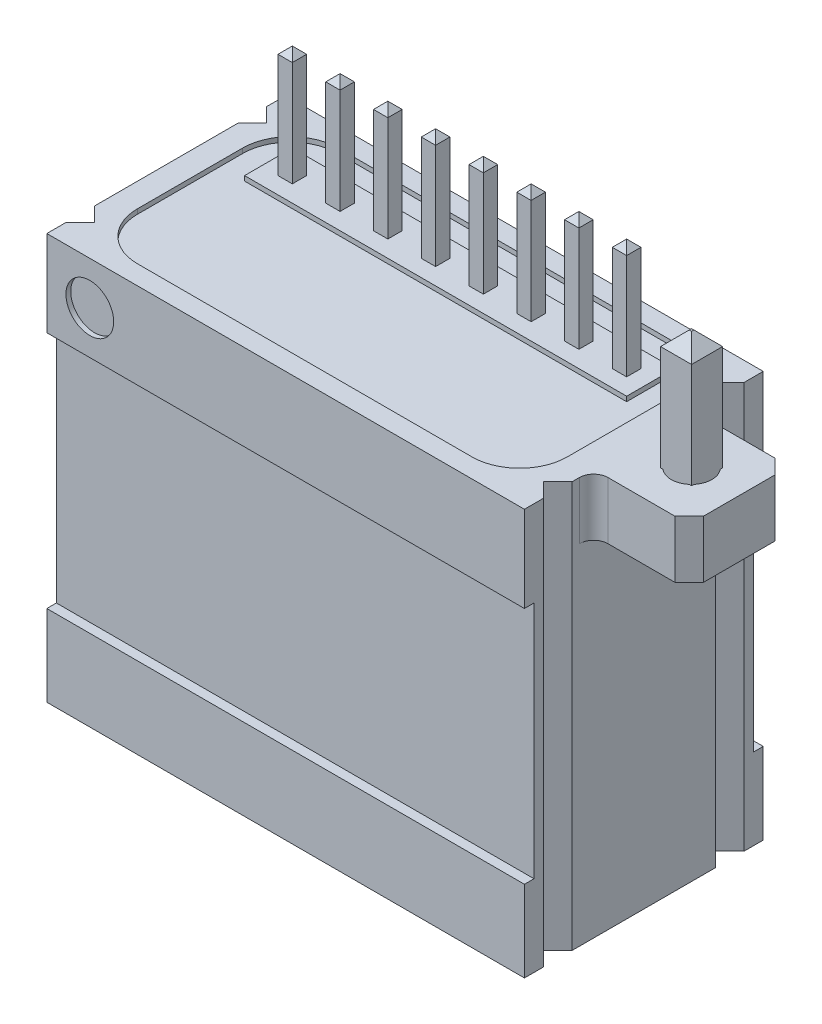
ISO-10303-21;
HEADER;
FILE_DESCRIPTION(('STEP AP214'),'2;1');
FILE_NAME('part.step','',(''),(''),'','','');
FILE_SCHEMA(('AUTOMOTIVE_DESIGN { 1 0 10303 214 1 1 1 1 }'));
ENDSEC;
DATA;
#1=APPLICATION_CONTEXT('core data for automotive mechanical design processes');
#2=APPLICATION_PROTOCOL_DEFINITION('international standard','automotive_design',2000,#1);
#3=PRODUCT_CONTEXT('',#1,'mechanical');
#4=PRODUCT('Part','Part','',(#3));
#5=PRODUCT_RELATED_PRODUCT_CATEGORY('part','',(#4));
#6=PRODUCT_DEFINITION_FORMATION('','',#4);
#7=PRODUCT_DEFINITION_CONTEXT('part definition',#1,'design');
#8=PRODUCT_DEFINITION('design','',#6,#7);
#9=PRODUCT_DEFINITION_SHAPE('','',#8);
#10=(LENGTH_UNIT() NAMED_UNIT(*) SI_UNIT(.MILLI.,.METRE.));
#11=(NAMED_UNIT(*) PLANE_ANGLE_UNIT() SI_UNIT($,.RADIAN.));
#12=(NAMED_UNIT(*) SI_UNIT($,.STERADIAN.) SOLID_ANGLE_UNIT());
#13=UNCERTAINTY_MEASURE_WITH_UNIT(LENGTH_MEASURE(1.E-05),#10,'distance_accuracy_value','');
#14=(GEOMETRIC_REPRESENTATION_CONTEXT(3) GLOBAL_UNCERTAINTY_ASSIGNED_CONTEXT((#13)) GLOBAL_UNIT_ASSIGNED_CONTEXT((#10,
#11,#12)) REPRESENTATION_CONTEXT('',''));
#15=CARTESIAN_POINT('',(0.,0.,0.));
#16=DIRECTION('',(0.,0.,1.));
#17=DIRECTION('',(1.,0.,0.));
#18=AXIS2_PLACEMENT_3D('',#15,#16,#17);
#19=CARTESIAN_POINT('',(10.3,7.3,-1.15));
#20=DIRECTION('',(0.,1.,0.));
#21=DIRECTION('',(0.,0.,1.));
#22=AXIS2_PLACEMENT_3D('',#19,#20,#21);
#23=PLANE('',#22);
#24=CARTESIAN_POINT('',(10.3,7.3,-1.15));
#25=DIRECTION('',(0.,-1.,0.));
#26=DIRECTION('',(0.,0.,1.));
#27=AXIS2_PLACEMENT_3D('',#24,#25,#26);
#28=CIRCLE('',#27,0.3);
#29=CARTESIAN_POINT('',(10.,7.3,-1.15));
#30=VERTEX_POINT('',#29);
#31=CARTESIAN_POINT('',(10.3,7.3,-1.45));
#32=VERTEX_POINT('',#31);
#33=EDGE_CURVE('E1149',#30,#32,#28,.T.);
#34=ORIENTED_EDGE('',*,*,#33,.F.);
#35=DIRECTION('',(0.,0.,-1.));
#36=VECTOR('',#35,1.);
#37=CARTESIAN_POINT('',(10.,7.3,0.));
#38=LINE('',#37,#36);
#39=CARTESIAN_POINT('',(10.,7.3,-3.85));
#40=VERTEX_POINT('',#39);
#41=EDGE_CURVE('E1429',#30,#40,#38,.T.);
#42=ORIENTED_EDGE('',*,*,#41,.T.);
#43=CARTESIAN_POINT('',(10.3,7.3,-3.85));
#44=DIRECTION('',(0.,-1.,0.));
#45=DIRECTION('',(0.,0.,-1.));
#46=AXIS2_PLACEMENT_3D('',#43,#44,#45);
#47=CIRCLE('',#46,0.3);
#48=CARTESIAN_POINT('',(10.3,7.3,-3.55));
#49=VERTEX_POINT('',#48);
#50=EDGE_CURVE('E1168',#49,#40,#47,.T.);
#51=ORIENTED_EDGE('',*,*,#50,.F.);
#52=DIRECTION('',(-1.,0.,0.));
#53=VECTOR('',#52,1.);
#54=CARTESIAN_POINT('',(10.3,7.3,-3.55));
#55=LINE('',#54,#53);
#56=CARTESIAN_POINT('',(11.7,7.3,-3.55));
#57=VERTEX_POINT('',#56);
#58=EDGE_CURVE('E1165',#57,#49,#55,.T.);
#59=ORIENTED_EDGE('',*,*,#58,.F.);
#60=DIRECTION('',(-0.707106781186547,0.,-0.707106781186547));
#61=VECTOR('',#60,1.);
#62=CARTESIAN_POINT('',(11.7,7.3,-3.55));
#63=LINE('',#62,#61);
#64=CARTESIAN_POINT('',(12.,7.3,-3.25));
#65=VERTEX_POINT('',#64);
#66=EDGE_CURVE('E1162',#65,#57,#63,.T.);
#67=ORIENTED_EDGE('',*,*,#66,.F.);
#68=DIRECTION('',(0.,0.,-1.));
#69=VECTOR('',#68,1.);
#70=CARTESIAN_POINT('',(12.,7.3,-3.25));
#71=LINE('',#70,#69);
#72=CARTESIAN_POINT('',(12.,7.3,-1.75));
#73=VERTEX_POINT('',#72);
#74=EDGE_CURVE('E1159',#73,#65,#71,.T.);
#75=ORIENTED_EDGE('',*,*,#74,.F.);
#76=DIRECTION('',(0.707106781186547,0.,-0.707106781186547));
#77=VECTOR('',#76,1.);
#78=CARTESIAN_POINT('',(11.7,7.3,-1.45));
#79=LINE('',#78,#77);
#80=CARTESIAN_POINT('',(11.7,7.3,-1.45));
#81=VERTEX_POINT('',#80);
#82=EDGE_CURVE('E1156',#81,#73,#79,.T.);
#83=ORIENTED_EDGE('',*,*,#82,.F.);
#84=DIRECTION('',(1.,0.,0.));
#85=VECTOR('',#84,1.);
#86=CARTESIAN_POINT('',(10.3,7.3,-1.45));
#87=LINE('',#86,#85);
#88=EDGE_CURVE('E1152',#32,#81,#87,.T.);
#89=ORIENTED_EDGE('',*,*,#88,.F.);
#90=EDGE_LOOP('',(#34,#42,#51,#59,#67,#75,#83,#89));
#91=FACE_BOUND('',#90,.T.);
#92=DIRECTION('',(-0.999999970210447,0.,-0.000244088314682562));
#93=VECTOR('',#92,1.);
#94=CARTESIAN_POINT('',(11.3249206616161,7.3,-2.17492068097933));
#95=LINE('',#94,#93);
#96=CARTESIAN_POINT('',(10.7260594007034,7.3,-2.17506685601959));
#97=VERTEX_POINT('',#96);
#98=CARTESIAN_POINT('',(10.6749206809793,7.3,-2.17507933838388));
#99=VERTEX_POINT('',#98);
#100=EDGE_CURVE('E676',#97,#99,#95,.T.);
#101=ORIENTED_EDGE('',*,*,#100,.F.);
#102=CARTESIAN_POINT('',(11.,7.3,-2.5));
#103=DIRECTION('',(0.,1.,0.));
#104=DIRECTION('',(0.,0.,1.));
#105=AXIS2_PLACEMENT_3D('',#102,#103,#104);
#106=CIRCLE('',#105,0.425);
#107=CARTESIAN_POINT('',(11.2737819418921,7.3,-2.17493316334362));
#108=VERTEX_POINT('',#107);
#109=EDGE_CURVE('E1140',#97,#108,#106,.T.);
#110=ORIENTED_EDGE('',*,*,#109,.T.);
#111=CARTESIAN_POINT('',(11.3249206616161,7.3,-2.17492068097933));
#112=VERTEX_POINT('',#111);
#113=EDGE_CURVE('E1457',#112,#108,#95,.T.);
#114=ORIENTED_EDGE('',*,*,#113,.F.);
#115=DIRECTION('',(-0.000244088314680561,0.,0.999999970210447));
#116=VECTOR('',#115,1.);
#117=CARTESIAN_POINT('',(11.3250793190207,7.3,-2.82492066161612));
#118=LINE('',#117,#116);
#119=CARTESIAN_POINT('',(11.3249331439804,7.3,-2.22605940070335));
#120=VERTEX_POINT('',#119);
#121=EDGE_CURVE('E1468',#120,#112,#118,.T.);
#122=ORIENTED_EDGE('',*,*,#121,.F.);
#123=CARTESIAN_POINT('',(11.3250668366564,7.3,-2.77378194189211));
#124=VERTEX_POINT('',#123);
#125=EDGE_CURVE('E1145',#120,#124,#106,.T.);
#126=ORIENTED_EDGE('',*,*,#125,.T.);
#127=CARTESIAN_POINT('',(11.3250793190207,7.3,-2.82492066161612));
#128=VERTEX_POINT('',#127);
#129=EDGE_CURVE('E672',#128,#124,#118,.T.);
#130=ORIENTED_EDGE('',*,*,#129,.F.);
#131=DIRECTION('',(0.999999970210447,0.,0.00024408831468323));
#132=VECTOR('',#131,1.);
#133=CARTESIAN_POINT('',(10.6750793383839,7.3,-2.82507931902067));
#134=LINE('',#133,#132);
#135=CARTESIAN_POINT('',(11.2739405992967,7.3,-2.82493314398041));
#136=VERTEX_POINT('',#135);
#137=EDGE_CURVE('E1466',#136,#128,#134,.T.);
#138=ORIENTED_EDGE('',*,*,#137,.F.);
#139=CARTESIAN_POINT('',(10.7262180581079,7.3,-2.82506683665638));
#140=VERTEX_POINT('',#139);
#141=EDGE_CURVE('E1480',#136,#140,#106,.T.);
#142=ORIENTED_EDGE('',*,*,#141,.T.);
#143=CARTESIAN_POINT('',(10.6750793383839,7.3,-2.82507931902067));
#144=VERTEX_POINT('',#143);
#145=EDGE_CURVE('E68',#144,#140,#134,.T.);
#146=ORIENTED_EDGE('',*,*,#145,.F.);
#147=DIRECTION('',(0.00024408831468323,0.,-0.999999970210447));
#148=VECTOR('',#147,1.);
#149=CARTESIAN_POINT('',(10.6749206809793,7.3,-2.17507933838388));
#150=LINE('',#149,#148);
#151=CARTESIAN_POINT('',(10.6750668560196,7.3,-2.77394059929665));
#152=VERTEX_POINT('',#151);
#153=EDGE_CURVE('E1460',#152,#144,#150,.T.);
#154=ORIENTED_EDGE('',*,*,#153,.F.);
#155=CARTESIAN_POINT('',(10.6749331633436,7.3,-2.2262180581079));
#156=VERTEX_POINT('',#155);
#157=EDGE_CURVE('E1143',#152,#156,#106,.T.);
#158=ORIENTED_EDGE('',*,*,#157,.T.);
#159=EDGE_CURVE('E61',#99,#156,#150,.T.);
#160=ORIENTED_EDGE('',*,*,#159,.F.);
#161=EDGE_LOOP('',(#101,#110,#114,#122,#126,#130,#138,#142,#146,#154,#158,#160));
#162=FACE_BOUND('',#161,.T.);
#163=ADVANCED_FACE('F46',(#91,#162),#23,.F.);
#164=CARTESIAN_POINT('',(0.386263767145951,8.40000000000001,-0.260147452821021));
#165=DIRECTION('',(0.,1.,0.));
#166=DIRECTION('',(0.,0.,1.));
#167=AXIS2_PLACEMENT_3D('',#164,#165,#166);
#168=PLANE('',#167);
#169=CARTESIAN_POINT('',(1.5,8.40000000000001,-3.6));
#170=DIRECTION('',(0.,1.,0.));
#171=DIRECTION('',(0.,0.,1.));
#172=AXIS2_PLACEMENT_3D('',#169,#170,#171);
#173=CIRCLE('',#172,1.);
#174=CARTESIAN_POINT('',(1.5,8.40000000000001,-4.6));
#175=VERTEX_POINT('',#174);
#176=CARTESIAN_POINT('',(0.500000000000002,8.40000000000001,-3.6));
#177=VERTEX_POINT('',#176);
#178=EDGE_CURVE('E1133',#175,#177,#173,.T.);
#179=ORIENTED_EDGE('',*,*,#178,.T.);
#180=DIRECTION('',(0.,0.,1.));
#181=VECTOR('',#180,1.);
#182=CARTESIAN_POINT('',(0.500000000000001,8.40000000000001,-1.4));
#183=LINE('',#182,#181);
#184=CARTESIAN_POINT('',(0.500000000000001,8.40000000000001,-1.4));
#185=VERTEX_POINT('',#184);
#186=EDGE_CURVE('E1136',#177,#185,#183,.T.);
#187=ORIENTED_EDGE('',*,*,#186,.T.);
#188=CARTESIAN_POINT('',(1.5,8.40000000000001,-1.4));
#189=DIRECTION('',(0.,1.,0.));
#190=DIRECTION('',(0.,0.,1.));
#191=AXIS2_PLACEMENT_3D('',#188,#189,#190);
#192=CIRCLE('',#191,1.);
#193=CARTESIAN_POINT('',(1.5,8.40000000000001,-0.4));
#194=VERTEX_POINT('',#193);
#195=EDGE_CURVE('E1128',#185,#194,#192,.T.);
#196=ORIENTED_EDGE('',*,*,#195,.T.);
#197=DIRECTION('',(1.,0.,0.));
#198=VECTOR('',#197,1.);
#199=CARTESIAN_POINT('',(8.5,8.40000000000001,-0.4));
#200=LINE('',#199,#198);
#201=CARTESIAN_POINT('',(8.5,8.40000000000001,-0.4));
#202=VERTEX_POINT('',#201);
#203=EDGE_CURVE('E1431',#194,#202,#200,.T.);
#204=ORIENTED_EDGE('',*,*,#203,.T.);
#205=CARTESIAN_POINT('',(8.5,8.40000000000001,-1.4));
#206=DIRECTION('',(0.,1.,0.));
#207=DIRECTION('',(0.,0.,1.));
#208=AXIS2_PLACEMENT_3D('',#205,#206,#207);
#209=CIRCLE('',#208,1.);
#210=CARTESIAN_POINT('',(9.5,8.40000000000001,-1.4));
#211=VERTEX_POINT('',#210);
#212=EDGE_CURVE('E1119',#202,#211,#209,.T.);
#213=ORIENTED_EDGE('',*,*,#212,.T.);
#214=DIRECTION('',(0.,0.,-1.));
#215=VECTOR('',#214,1.);
#216=CARTESIAN_POINT('',(9.5,8.40000000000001,-3.6));
#217=LINE('',#216,#215);
#218=CARTESIAN_POINT('',(9.5,8.40000000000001,-3.6));
#219=VERTEX_POINT('',#218);
#220=EDGE_CURVE('E1122',#211,#219,#217,.T.);
#221=ORIENTED_EDGE('',*,*,#220,.T.);
#222=CARTESIAN_POINT('',(8.5,8.40000000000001,-3.6));
#223=DIRECTION('',(0.,1.,0.));
#224=DIRECTION('',(0.,0.,1.));
#225=AXIS2_PLACEMENT_3D('',#222,#223,#224);
#226=CIRCLE('',#225,1.);
#227=CARTESIAN_POINT('',(8.5,8.40000000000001,-4.6));
#228=VERTEX_POINT('',#227);
#229=EDGE_CURVE('E1125',#219,#228,#226,.T.);
#230=ORIENTED_EDGE('',*,*,#229,.T.);
#231=DIRECTION('',(1.,0.,0.));
#232=VECTOR('',#231,1.);
#233=CARTESIAN_POINT('',(1.7,8.40000000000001,-4.6));
#234=LINE('',#233,#232);
#235=EDGE_CURVE('E1131',#175,#228,#234,.T.);
#236=ORIENTED_EDGE('',*,*,#235,.F.);
#237=EDGE_LOOP('',(#179,#187,#196,#204,#213,#221,#230,#236));
#238=FACE_BOUND('',#237,.T.);
#239=DIRECTION('',(1.,0.,0.));
#240=VECTOR('',#239,1.);
#241=CARTESIAN_POINT('',(1.02,8.40000000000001,-3.12000000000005));
#242=LINE('',#241,#240);
#243=CARTESIAN_POINT('',(1.02,8.40000000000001,-3.12000000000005));
#244=VERTEX_POINT('',#243);
#245=CARTESIAN_POINT('',(9.02,8.40000000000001,-3.12000000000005));
#246=VERTEX_POINT('',#245);
#247=EDGE_CURVE('E680',#244,#246,#242,.T.);
#248=ORIENTED_EDGE('',*,*,#247,.F.);
#249=DIRECTION('',(0.,0.,1.));
#250=VECTOR('',#249,1.);
#251=CARTESIAN_POINT('',(1.02,8.40000000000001,-4.12000000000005));
#252=LINE('',#251,#250);
#253=CARTESIAN_POINT('',(1.02,8.40000000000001,-4.12000000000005));
#254=VERTEX_POINT('',#253);
#255=EDGE_CURVE('E677',#254,#244,#252,.T.);
#256=ORIENTED_EDGE('',*,*,#255,.F.);
#257=DIRECTION('',(-1.,0.,0.));
#258=VECTOR('',#257,1.);
#259=CARTESIAN_POINT('',(1.02,8.40000000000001,-4.12000000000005));
#260=LINE('',#259,#258);
#261=CARTESIAN_POINT('',(9.02,8.40000000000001,-4.12000000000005));
#262=VERTEX_POINT('',#261);
#263=EDGE_CURVE('E690',#262,#254,#260,.T.);
#264=ORIENTED_EDGE('',*,*,#263,.F.);
#265=DIRECTION('',(0.,0.,-1.));
#266=VECTOR('',#265,1.);
#267=CARTESIAN_POINT('',(9.02,8.40000000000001,-4.12000000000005));
#268=LINE('',#267,#266);
#269=EDGE_CURVE('E698',#246,#262,#268,.T.);
#270=ORIENTED_EDGE('',*,*,#269,.F.);
#271=EDGE_LOOP('',(#248,#256,#264,#270));
#272=FACE_BOUND('',#271,.T.);
#273=ADVANCED_FACE('F1540',(#238,#272),#168,.T.);
#274=CARTESIAN_POINT('',(11.,7.3,-2.5));
#275=DIRECTION('',(0.,1.,0.));
#276=DIRECTION('',(0.,0.,1.));
#277=AXIS2_PLACEMENT_3D('',#274,#275,#276);
#278=CYLINDRICAL_SURFACE('',#277,0.425);
#279=CARTESIAN_POINT('',(11.,8.5,-2.5));
#280=DIRECTION('',(0.,1.,0.));
#281=DIRECTION('',(0.,0.,1.));
#282=AXIS2_PLACEMENT_3D('',#279,#280,#281);
#283=CIRCLE('',#282,0.425);
#284=CARTESIAN_POINT('',(10.7260594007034,8.5,-2.17506685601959));
#285=VERTEX_POINT('',#284);
#286=CARTESIAN_POINT('',(11.2737819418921,8.5,-2.17493316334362));
#287=VERTEX_POINT('',#286);
#288=EDGE_CURVE('E1139',#285,#287,#283,.T.);
#289=ORIENTED_EDGE('',*,*,#288,.T.);
#290=DIRECTION('',(0.,1.,0.));
#291=VECTOR('',#290,1.);
#292=CARTESIAN_POINT('',(11.2737819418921,7.3,-2.17493316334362));
#293=LINE('',#292,#291);
#294=EDGE_CURVE('E54',#287,#108,#293,.F.);
#295=ORIENTED_EDGE('',*,*,#294,.T.);
#296=ORIENTED_EDGE('',*,*,#109,.F.);
#297=DIRECTION('',(0.,1.,0.));
#298=VECTOR('',#297,1.);
#299=CARTESIAN_POINT('',(10.7260594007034,7.3,-2.17506685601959));
#300=LINE('',#299,#298);
#301=EDGE_CURVE('E1449',#97,#285,#300,.T.);
#302=ORIENTED_EDGE('',*,*,#301,.T.);
#303=EDGE_LOOP('',(#289,#295,#296,#302));
#304=FACE_BOUND('',#303,.T.);
#305=ADVANCED_FACE('F1453',(#304),#278,.F.);
#306=CARTESIAN_POINT('',(11.3249331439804,8.5,-2.22605940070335));
#307=VERTEX_POINT('',#306);
#308=CARTESIAN_POINT('',(11.3250668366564,8.5,-2.77378194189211));
#309=VERTEX_POINT('',#308);
#310=EDGE_CURVE('E1144',#307,#309,#283,.T.);
#311=ORIENTED_EDGE('',*,*,#310,.T.);
#312=DIRECTION('',(0.,1.,0.));
#313=VECTOR('',#312,1.);
#314=CARTESIAN_POINT('',(11.3250668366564,7.3,-2.77378194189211));
#315=LINE('',#314,#313);
#316=EDGE_CURVE('E1447',#309,#124,#315,.F.);
#317=ORIENTED_EDGE('',*,*,#316,.T.);
#318=ORIENTED_EDGE('',*,*,#125,.F.);
#319=DIRECTION('',(0.,1.,0.));
#320=VECTOR('',#319,1.);
#321=CARTESIAN_POINT('',(11.3249331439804,7.3,-2.22605940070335));
#322=LINE('',#321,#320);
#323=EDGE_CURVE('E1444',#120,#307,#322,.T.);
#324=ORIENTED_EDGE('',*,*,#323,.T.);
#325=EDGE_LOOP('',(#311,#317,#318,#324));
#326=FACE_BOUND('',#325,.T.);
#327=ADVANCED_FACE('F1500',(#326),#278,.F.);
#328=CARTESIAN_POINT('',(11.2739405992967,8.5,-2.82493314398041));
#329=VERTEX_POINT('',#328);
#330=CARTESIAN_POINT('',(10.7262180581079,8.5,-2.82506683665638));
#331=VERTEX_POINT('',#330);
#332=EDGE_CURVE('E1494',#329,#331,#283,.T.);
#333=ORIENTED_EDGE('',*,*,#332,.T.);
#334=DIRECTION('',(0.,1.,0.));
#335=VECTOR('',#334,1.);
#336=CARTESIAN_POINT('',(10.7262180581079,7.3,-2.82506683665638));
#337=LINE('',#336,#335);
#338=EDGE_CURVE('E1442',#331,#140,#337,.F.);
#339=ORIENTED_EDGE('',*,*,#338,.T.);
#340=ORIENTED_EDGE('',*,*,#141,.F.);
#341=DIRECTION('',(0.,1.,0.));
#342=VECTOR('',#341,1.);
#343=CARTESIAN_POINT('',(11.2739405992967,7.3,-2.82493314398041));
#344=LINE('',#343,#342);
#345=EDGE_CURVE('E1439',#136,#329,#344,.T.);
#346=ORIENTED_EDGE('',*,*,#345,.T.);
#347=EDGE_LOOP('',(#333,#339,#340,#346));
#348=FACE_BOUND('',#347,.T.);
#349=ADVANCED_FACE('F1523',(#348),#278,.F.);
#350=CARTESIAN_POINT('',(0.,8.5,0.));
#351=DIRECTION('',(1.,0.,0.));
#352=DIRECTION('',(0.,0.,-1.));
#353=AXIS2_PLACEMENT_3D('',#350,#351,#352);
#354=PLANE('',#353);
#355=DIRECTION('',(0.,0.,1.));
#356=VECTOR('',#355,1.);
#357=CARTESIAN_POINT('',(0.,0.,0.));
#358=LINE('',#357,#356);
#359=CARTESIAN_POINT('',(0.,0.,-4.));
#360=VERTEX_POINT('',#359);
#361=CARTESIAN_POINT('',(0.,0.,-1.));
#362=VERTEX_POINT('',#361);
#363=EDGE_CURVE('E1382',#360,#362,#358,.T.);
#364=ORIENTED_EDGE('',*,*,#363,.T.);
#365=DIRECTION('',(0.,1.,0.));
#366=VECTOR('',#365,1.);
#367=CARTESIAN_POINT('',(0.,8.5,-1.));
#368=LINE('',#367,#366);
#369=CARTESIAN_POINT('',(0.,8.5,-1.));
#370=VERTEX_POINT('',#369);
#371=EDGE_CURVE('E1230',#362,#370,#368,.T.);
#372=ORIENTED_EDGE('',*,*,#371,.T.);
#373=DIRECTION('',(0.,0.,1.));
#374=VECTOR('',#373,1.);
#375=CARTESIAN_POINT('',(0.,8.5,0.));
#376=LINE('',#375,#374);
#377=CARTESIAN_POINT('',(0.,8.5,-4.));
#378=VERTEX_POINT('',#377);
#379=EDGE_CURVE('E1366',#378,#370,#376,.T.);
#380=ORIENTED_EDGE('',*,*,#379,.F.);
#381=DIRECTION('',(0.,-1.,0.));
#382=VECTOR('',#381,1.);
#383=CARTESIAN_POINT('',(0.,8.5,-4.));
#384=LINE('',#383,#382);
#385=EDGE_CURVE('E1266',#378,#360,#384,.T.);
#386=ORIENTED_EDGE('',*,*,#385,.T.);
#387=EDGE_LOOP('',(#364,#372,#380,#386));
#388=FACE_BOUND('',#387,.T.);
#389=ADVANCED_FACE('F1525',(#388),#354,.F.);
#390=CARTESIAN_POINT('',(10.,8.5,0.));
#391=DIRECTION('',(-1.,0.,0.));
#392=DIRECTION('',(0.,0.,1.));
#393=AXIS2_PLACEMENT_3D('',#390,#391,#392);
#394=PLANE('',#393);
#395=DIRECTION('',(0.,0.,-1.));
#396=VECTOR('',#395,1.);
#397=CARTESIAN_POINT('',(10.,0.,0.));
#398=LINE('',#397,#396);
#399=CARTESIAN_POINT('',(10.,0.,0.));
#400=VERTEX_POINT('',#399);
#401=CARTESIAN_POINT('',(10.,0.,-0.400000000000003));
#402=VERTEX_POINT('',#401);
#403=EDGE_CURVE('E1386',#400,#402,#398,.T.);
#404=ORIENTED_EDGE('',*,*,#403,.T.);
#405=DIRECTION('',(0.,1.,0.));
#406=VECTOR('',#405,1.);
#407=CARTESIAN_POINT('',(10.,8.5,-0.400000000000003));
#408=LINE('',#407,#406);
#409=CARTESIAN_POINT('',(10.,8.5,-0.400000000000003));
#410=VERTEX_POINT('',#409);
#411=EDGE_CURVE('E1242',#402,#410,#408,.T.);
#412=ORIENTED_EDGE('',*,*,#411,.T.);
#413=DIRECTION('',(0.,0.,-1.));
#414=VECTOR('',#413,1.);
#415=CARTESIAN_POINT('',(10.,8.5,0.));
#416=LINE('',#415,#414);
#417=CARTESIAN_POINT('',(10.,8.5,0.));
#418=VERTEX_POINT('',#417);
#419=EDGE_CURVE('E1370',#418,#410,#416,.T.);
#420=ORIENTED_EDGE('',*,*,#419,.F.);
#421=DIRECTION('',(0.,-1.,0.));
#422=VECTOR('',#421,1.);
#423=CARTESIAN_POINT('',(10.,8.5,0.));
#424=LINE('',#423,#422);
#425=CARTESIAN_POINT('',(10.,6.7,0.));
#426=VERTEX_POINT('',#425);
#427=EDGE_CURVE('E1401',#418,#426,#424,.T.);
#428=ORIENTED_EDGE('',*,*,#427,.T.);
#429=DIRECTION('',(0.,0.,-1.));
#430=VECTOR('',#429,1.);
#431=CARTESIAN_POINT('',(10.,6.7,0.));
#432=LINE('',#431,#430);
#433=CARTESIAN_POINT('',(10.,6.7,-0.2));
#434=VERTEX_POINT('',#433);
#435=EDGE_CURVE('E1312',#426,#434,#432,.T.);
#436=ORIENTED_EDGE('',*,*,#435,.T.);
#437=DIRECTION('',(0.,-1.,0.));
#438=VECTOR('',#437,1.);
#439=CARTESIAN_POINT('',(10.,6.7,-0.2));
#440=LINE('',#439,#438);
#441=CARTESIAN_POINT('',(10.,1.7,-0.200000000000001));
#442=VERTEX_POINT('',#441);
#443=EDGE_CURVE('E1315',#434,#442,#440,.T.);
#444=ORIENTED_EDGE('',*,*,#443,.T.);
#445=DIRECTION('',(0.,0.,1.));
#446=VECTOR('',#445,1.);
#447=CARTESIAN_POINT('',(10.,1.7,-0.200000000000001));
#448=LINE('',#447,#446);
#449=CARTESIAN_POINT('',(10.,1.7,0.));
#450=VERTEX_POINT('',#449);
#451=EDGE_CURVE('E1318',#442,#450,#448,.T.);
#452=ORIENTED_EDGE('',*,*,#451,.T.);
#453=EDGE_CURVE('E1400',#450,#400,#424,.T.);
#454=ORIENTED_EDGE('',*,*,#453,.T.);
#455=EDGE_LOOP('',(#404,#412,#420,#428,#436,#444,#452,#454));
#456=FACE_BOUND('',#455,.T.);
#457=ADVANCED_FACE('F1532',(#456),#394,.F.);
#458=DIRECTION('',(0.,1.,0.));
#459=VECTOR('',#458,1.);
#460=CARTESIAN_POINT('',(10.,8.5,-4.));
#461=LINE('',#460,#459);
#462=CARTESIAN_POINT('',(10.,0.,-4.));
#463=VERTEX_POINT('',#462);
#464=CARTESIAN_POINT('',(10.,8.5,-4.));
#465=VERTEX_POINT('',#464);
#466=EDGE_CURVE('E1256',#463,#465,#461,.T.);
#467=ORIENTED_EDGE('',*,*,#466,.T.);
#468=CARTESIAN_POINT('',(10.,8.5,-3.85));
#469=VERTEX_POINT('',#468);
#470=EDGE_CURVE('E1375',#469,#465,#416,.T.);
#471=ORIENTED_EDGE('',*,*,#470,.F.);
#472=DIRECTION('',(0.,1.,0.));
#473=VECTOR('',#472,1.);
#474=CARTESIAN_POINT('',(10.,7.3,-3.85));
#475=LINE('',#474,#473);
#476=EDGE_CURVE('E1191',#40,#469,#475,.T.);
#477=ORIENTED_EDGE('',*,*,#476,.F.);
#478=ORIENTED_EDGE('',*,*,#41,.F.);
#479=DIRECTION('',(0.,1.,0.));
#480=VECTOR('',#479,1.);
#481=CARTESIAN_POINT('',(10.,7.3,-1.15));
#482=LINE('',#481,#480);
#483=CARTESIAN_POINT('',(10.,8.5,-1.15));
#484=VERTEX_POINT('',#483);
#485=EDGE_CURVE('E1171',#30,#484,#482,.T.);
#486=ORIENTED_EDGE('',*,*,#485,.T.);
#487=CARTESIAN_POINT('',(10.,8.5,-1.));
#488=VERTEX_POINT('',#487);
#489=EDGE_CURVE('E1374',#488,#484,#416,.T.);
#490=ORIENTED_EDGE('',*,*,#489,.F.);
#491=DIRECTION('',(0.,-1.,0.));
#492=VECTOR('',#491,1.);
#493=CARTESIAN_POINT('',(10.,8.5,-1.));
#494=LINE('',#493,#492);
#495=CARTESIAN_POINT('',(10.,0.,-0.999999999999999));
#496=VERTEX_POINT('',#495);
#497=EDGE_CURVE('E1240',#488,#496,#494,.T.);
#498=ORIENTED_EDGE('',*,*,#497,.T.);
#499=EDGE_CURVE('E1390',#496,#463,#398,.T.);
#500=ORIENTED_EDGE('',*,*,#499,.T.);
#501=EDGE_LOOP('',(#467,#471,#477,#478,#486,#490,#498,#500));
#502=FACE_BOUND('',#501,.T.);
#503=ADVANCED_FACE('F1694',(#502),#394,.F.);
#504=CARTESIAN_POINT('',(0.,0.,-5.));
#505=VERTEX_POINT('',#504);
#506=CARTESIAN_POINT('',(0.,0.,-4.6));
#507=VERTEX_POINT('',#506);
#508=EDGE_CURVE('E1378',#505,#507,#358,.T.);
#509=ORIENTED_EDGE('',*,*,#508,.T.);
#510=DIRECTION('',(0.,1.,0.));
#511=VECTOR('',#510,1.);
#512=CARTESIAN_POINT('',(0.,8.5,-4.6));
#513=LINE('',#512,#511);
#514=CARTESIAN_POINT('',(0.,8.5,-4.6));
#515=VERTEX_POINT('',#514);
#516=EDGE_CURVE('E1269',#507,#515,#513,.T.);
#517=ORIENTED_EDGE('',*,*,#516,.T.);
#518=CARTESIAN_POINT('',(0.,8.5,-5.));
#519=VERTEX_POINT('',#518);
#520=EDGE_CURVE('E1362',#519,#515,#376,.T.);
#521=ORIENTED_EDGE('',*,*,#520,.F.);
#522=DIRECTION('',(0.,-1.,0.));
#523=VECTOR('',#522,1.);
#524=CARTESIAN_POINT('',(0.,8.5,-5.));
#525=LINE('',#524,#523);
#526=CARTESIAN_POINT('',(0.,6.7,-5.));
#527=VERTEX_POINT('',#526);
#528=EDGE_CURVE('E1393',#519,#527,#525,.T.);
#529=ORIENTED_EDGE('',*,*,#528,.T.);
#530=DIRECTION('',(0.,0.,-1.));
#531=VECTOR('',#530,1.);
#532=CARTESIAN_POINT('',(0.,6.7,0.));
#533=LINE('',#532,#531);
#534=CARTESIAN_POINT('',(0.,6.7,-4.8));
#535=VERTEX_POINT('',#534);
#536=EDGE_CURVE('E1351',#535,#527,#533,.T.);
#537=ORIENTED_EDGE('',*,*,#536,.F.);
#538=DIRECTION('',(0.,1.,0.));
#539=VECTOR('',#538,1.);
#540=CARTESIAN_POINT('',(0.,8.5,-4.8));
#541=LINE('',#540,#539);
#542=CARTESIAN_POINT('',(0.,1.7,-4.8));
#543=VERTEX_POINT('',#542);
#544=EDGE_CURVE('E1359',#543,#535,#541,.T.);
#545=ORIENTED_EDGE('',*,*,#544,.F.);
#546=DIRECTION('',(0.,0.,1.));
#547=VECTOR('',#546,1.);
#548=CARTESIAN_POINT('',(0.,1.7,0.));
#549=LINE('',#548,#547);
#550=CARTESIAN_POINT('',(0.,1.7,-5.));
#551=VERTEX_POINT('',#550);
#552=EDGE_CURVE('E1333',#551,#543,#549,.T.);
#553=ORIENTED_EDGE('',*,*,#552,.F.);
#554=EDGE_CURVE('E1377',#551,#505,#525,.T.);
#555=ORIENTED_EDGE('',*,*,#554,.T.);
#556=EDGE_LOOP('',(#509,#517,#521,#529,#537,#545,#553,#555));
#557=FACE_BOUND('',#556,.T.);
#558=ADVANCED_FACE('F1534',(#557),#354,.F.);
#559=CARTESIAN_POINT('',(0.,8.5,-5.));
#560=DIRECTION('',(0.,-1.,0.));
#561=DIRECTION('',(0.,0.,-1.));
#562=AXIS2_PLACEMENT_3D('',#559,#560,#561);
#563=PLANE('',#562);
#564=ORIENTED_EDGE('',*,*,#470,.T.);
#565=DIRECTION('',(0.707106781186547,0.,0.707106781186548));
#566=VECTOR('',#565,1.);
#567=CARTESIAN_POINT('',(9.7,8.5,-4.3));
#568=LINE('',#567,#566);
#569=CARTESIAN_POINT('',(9.7,8.5,-4.3));
#570=VERTEX_POINT('',#569);
#571=EDGE_CURVE('E1245',#570,#465,#568,.T.);
#572=ORIENTED_EDGE('',*,*,#571,.F.);
#573=DIRECTION('',(-0.70710678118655,0.,0.707106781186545));
#574=VECTOR('',#573,1.);
#575=CARTESIAN_POINT('',(10.2423307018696,8.5,-4.84233070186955));
#576=LINE('',#575,#574);
#577=CARTESIAN_POINT('',(10.,8.5,-4.6));
#578=VERTEX_POINT('',#577);
#579=EDGE_CURVE('E1248',#578,#570,#576,.T.);
#580=ORIENTED_EDGE('',*,*,#579,.F.);
#581=CARTESIAN_POINT('',(10.,8.5,-5.));
#582=VERTEX_POINT('',#581);
#583=EDGE_CURVE('E1369',#578,#582,#416,.T.);
#584=ORIENTED_EDGE('',*,*,#583,.T.);
#585=DIRECTION('',(-1.,0.,0.));
#586=VECTOR('',#585,1.);
#587=CARTESIAN_POINT('',(0.,8.5,-5.));
#588=LINE('',#587,#586);
#589=EDGE_CURVE('E1373',#582,#519,#588,.T.);
#590=ORIENTED_EDGE('',*,*,#589,.T.);
#591=ORIENTED_EDGE('',*,*,#520,.T.);
#592=DIRECTION('',(-0.70710678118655,0.,-0.707106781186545));
#593=VECTOR('',#592,1.);
#594=CARTESIAN_POINT('',(-0.242330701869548,8.5,-4.84233070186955));
#595=LINE('',#594,#593);
#596=CARTESIAN_POINT('',(0.3,8.5,-4.3));
#597=VERTEX_POINT('',#596);
#598=EDGE_CURVE('E1262',#597,#515,#595,.T.);
#599=ORIENTED_EDGE('',*,*,#598,.F.);
#600=DIRECTION('',(0.707106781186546,0.,-0.707106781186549));
#601=VECTOR('',#600,1.);
#602=CARTESIAN_POINT('',(0.3,8.5,-4.3));
#603=LINE('',#602,#601);
#604=EDGE_CURVE('E1259',#378,#597,#603,.T.);
#605=ORIENTED_EDGE('',*,*,#604,.F.);
#606=ORIENTED_EDGE('',*,*,#379,.T.);
#607=DIRECTION('',(-0.707106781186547,0.,-0.707106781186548));
#608=VECTOR('',#607,1.);
#609=CARTESIAN_POINT('',(0.300000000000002,8.5,-0.699999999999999));
#610=LINE('',#609,#608);
#611=CARTESIAN_POINT('',(0.300000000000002,8.5,-0.699999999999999));
#612=VERTEX_POINT('',#611);
#613=EDGE_CURVE('E1218',#612,#370,#610,.T.);
#614=ORIENTED_EDGE('',*,*,#613,.F.);
#615=DIRECTION('',(0.70710678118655,0.,-0.707106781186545));
#616=VECTOR('',#615,1.);
#617=CARTESIAN_POINT('',(-0.242330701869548,8.5,-0.157669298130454));
#618=LINE('',#617,#616);
#619=CARTESIAN_POINT('',(0.,8.5,-0.4));
#620=VERTEX_POINT('',#619);
#621=EDGE_CURVE('E1222',#620,#612,#618,.T.);
#622=ORIENTED_EDGE('',*,*,#621,.F.);
#623=CARTESIAN_POINT('',(0.,8.5,0.));
#624=VERTEX_POINT('',#623);
#625=EDGE_CURVE('E1367',#620,#624,#376,.T.);
#626=ORIENTED_EDGE('',*,*,#625,.T.);
#627=DIRECTION('',(1.,0.,0.));
#628=VECTOR('',#627,1.);
#629=CARTESIAN_POINT('',(0.,8.5,0.));
#630=LINE('',#629,#628);
#631=EDGE_CURVE('E1365',#624,#418,#630,.T.);
#632=ORIENTED_EDGE('',*,*,#631,.T.);
#633=ORIENTED_EDGE('',*,*,#419,.T.);
#634=DIRECTION('',(0.70710678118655,0.,0.707106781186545));
#635=VECTOR('',#634,1.);
#636=CARTESIAN_POINT('',(10.2423307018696,8.5,-0.157669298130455));
#637=LINE('',#636,#635);
#638=CARTESIAN_POINT('',(9.7,8.5,-0.7));
#639=VERTEX_POINT('',#638);
#640=EDGE_CURVE('E1236',#639,#410,#637,.T.);
#641=ORIENTED_EDGE('',*,*,#640,.F.);
#642=DIRECTION('',(-0.707106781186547,0.,0.707106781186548));
#643=VECTOR('',#642,1.);
#644=CARTESIAN_POINT('',(9.7,8.5,-0.7));
#645=LINE('',#644,#643);
#646=EDGE_CURVE('E1233',#488,#639,#645,.T.);
#647=ORIENTED_EDGE('',*,*,#646,.F.);
#648=ORIENTED_EDGE('',*,*,#489,.T.);
#649=CARTESIAN_POINT('',(10.3,8.5,-1.15));
#650=DIRECTION('',(0.,-1.,0.));
#651=DIRECTION('',(0.,0.,1.));
#652=AXIS2_PLACEMENT_3D('',#649,#650,#651);
#653=CIRCLE('',#652,0.3);
#654=CARTESIAN_POINT('',(10.3,8.5,-1.45));
#655=VERTEX_POINT('',#654);
#656=EDGE_CURVE('E1172',#484,#655,#653,.T.);
#657=ORIENTED_EDGE('',*,*,#656,.T.);
#658=DIRECTION('',(1.,0.,0.));
#659=VECTOR('',#658,1.);
#660=CARTESIAN_POINT('',(10.3,8.5,-1.45));
#661=LINE('',#660,#659);
#662=CARTESIAN_POINT('',(11.7,8.5,-1.45));
#663=VERTEX_POINT('',#662);
#664=EDGE_CURVE('E1175',#655,#663,#661,.T.);
#665=ORIENTED_EDGE('',*,*,#664,.T.);
#666=DIRECTION('',(0.707106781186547,0.,-0.707106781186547));
#667=VECTOR('',#666,1.);
#668=CARTESIAN_POINT('',(11.7,8.5,-1.45));
#669=LINE('',#668,#667);
#670=CARTESIAN_POINT('',(12.,8.5,-1.75));
#671=VERTEX_POINT('',#670);
#672=EDGE_CURVE('E1178',#663,#671,#669,.T.);
#673=ORIENTED_EDGE('',*,*,#672,.T.);
#674=DIRECTION('',(0.,0.,-1.));
#675=VECTOR('',#674,1.);
#676=CARTESIAN_POINT('',(12.,8.5,-3.25));
#677=LINE('',#676,#675);
#678=CARTESIAN_POINT('',(12.,8.5,-3.25));
#679=VERTEX_POINT('',#678);
#680=EDGE_CURVE('E1181',#671,#679,#677,.T.);
#681=ORIENTED_EDGE('',*,*,#680,.T.);
#682=DIRECTION('',(-0.707106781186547,0.,-0.707106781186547));
#683=VECTOR('',#682,1.);
#684=CARTESIAN_POINT('',(11.7,8.5,-3.55));
#685=LINE('',#684,#683);
#686=CARTESIAN_POINT('',(11.7,8.5,-3.55));
#687=VERTEX_POINT('',#686);
#688=EDGE_CURVE('E1184',#679,#687,#685,.T.);
#689=ORIENTED_EDGE('',*,*,#688,.T.);
#690=DIRECTION('',(-1.,0.,0.));
#691=VECTOR('',#690,1.);
#692=CARTESIAN_POINT('',(10.3,8.5,-3.55));
#693=LINE('',#692,#691);
#694=CARTESIAN_POINT('',(10.3,8.5,-3.55));
#695=VERTEX_POINT('',#694);
#696=EDGE_CURVE('E1187',#687,#695,#693,.T.);
#697=ORIENTED_EDGE('',*,*,#696,.T.);
#698=CARTESIAN_POINT('',(10.3,8.5,-3.85));
#699=DIRECTION('',(0.,-1.,0.));
#700=DIRECTION('',(0.,0.,-1.));
#701=AXIS2_PLACEMENT_3D('',#698,#699,#700);
#702=CIRCLE('',#701,0.3);
#703=EDGE_CURVE('E1153',#695,#469,#702,.T.);
#704=ORIENTED_EDGE('',*,*,#703,.T.);
#705=EDGE_LOOP('',(#564,#572,#580,#584,#590,#591,#599,#605,#606,#614,#622,#626,#632,#633,#641,
#647,#648,#657,#665,#673,#681,#689,#697,#704));
#706=FACE_BOUND('',#705,.T.);
#707=CARTESIAN_POINT('',(1.5,8.5,-3.6));
#708=DIRECTION('',(0.,-1.,0.));
#709=DIRECTION('',(0.,0.,1.));
#710=AXIS2_PLACEMENT_3D('',#707,#708,#709);
#711=CIRCLE('',#710,1.);
#712=CARTESIAN_POINT('',(0.500000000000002,8.5,-3.6));
#713=VERTEX_POINT('',#712);
#714=CARTESIAN_POINT('',(1.5,8.5,-4.6));
#715=VERTEX_POINT('',#714);
#716=EDGE_CURVE('E1278',#713,#715,#711,.T.);
#717=ORIENTED_EDGE('',*,*,#716,.T.);
#718=DIRECTION('',(-1.,0.,0.));
#719=VECTOR('',#718,1.);
#720=CARTESIAN_POINT('',(1.7,8.5,-4.6));
#721=LINE('',#720,#719);
#722=CARTESIAN_POINT('',(8.5,8.5,-4.6));
#723=VERTEX_POINT('',#722);
#724=EDGE_CURVE('E1309',#723,#715,#721,.T.);
#725=ORIENTED_EDGE('',*,*,#724,.F.);
#726=CARTESIAN_POINT('',(8.5,8.5,-3.6));
#727=DIRECTION('',(0.,-1.,0.));
#728=DIRECTION('',(0.,0.,1.));
#729=AXIS2_PLACEMENT_3D('',#726,#727,#728);
#730=CIRCLE('',#729,1.);
#731=CARTESIAN_POINT('',(9.5,8.5,-3.6));
#732=VERTEX_POINT('',#731);
#733=EDGE_CURVE('E1281',#723,#732,#730,.T.);
#734=ORIENTED_EDGE('',*,*,#733,.T.);
#735=DIRECTION('',(0.,0.,1.));
#736=VECTOR('',#735,1.);
#737=CARTESIAN_POINT('',(9.5,8.5,-3.6));
#738=LINE('',#737,#736);
#739=CARTESIAN_POINT('',(9.5,8.5,-1.4));
#740=VERTEX_POINT('',#739);
#741=EDGE_CURVE('E1284',#732,#740,#738,.T.);
#742=ORIENTED_EDGE('',*,*,#741,.T.);
#743=CARTESIAN_POINT('',(8.5,8.5,-1.4));
#744=DIRECTION('',(0.,-1.,0.));
#745=DIRECTION('',(0.,0.,-1.));
#746=AXIS2_PLACEMENT_3D('',#743,#744,#745);
#747=CIRCLE('',#746,1.);
#748=CARTESIAN_POINT('',(8.5,8.5,-0.4));
#749=VERTEX_POINT('',#748);
#750=EDGE_CURVE('E1287',#740,#749,#747,.T.);
#751=ORIENTED_EDGE('',*,*,#750,.T.);
#752=DIRECTION('',(-1.,0.,0.));
#753=VECTOR('',#752,1.);
#754=CARTESIAN_POINT('',(8.5,8.5,-0.4));
#755=LINE('',#754,#753);
#756=CARTESIAN_POINT('',(1.5,8.5,-0.4));
#757=VERTEX_POINT('',#756);
#758=EDGE_CURVE('E1290',#749,#757,#755,.T.);
#759=ORIENTED_EDGE('',*,*,#758,.T.);
#760=CARTESIAN_POINT('',(1.5,8.5,-1.4));
#761=DIRECTION('',(0.,-1.,0.));
#762=DIRECTION('',(0.,0.,-1.));
#763=AXIS2_PLACEMENT_3D('',#760,#761,#762);
#764=CIRCLE('',#763,1.);
#765=CARTESIAN_POINT('',(0.500000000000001,8.5,-1.4));
#766=VERTEX_POINT('',#765);
#767=EDGE_CURVE('E1272',#757,#766,#764,.T.);
#768=ORIENTED_EDGE('',*,*,#767,.T.);
#769=DIRECTION('',(0.,0.,-1.));
#770=VECTOR('',#769,1.);
#771=CARTESIAN_POINT('',(0.500000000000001,8.5,-1.4));
#772=LINE('',#771,#770);
#773=EDGE_CURVE('E1275',#766,#713,#772,.T.);
#774=ORIENTED_EDGE('',*,*,#773,.T.);
#775=EDGE_LOOP('',(#717,#725,#734,#742,#751,#759,#768,#774));
#776=FACE_BOUND('',#775,.T.);
#777=DIRECTION('',(-0.000244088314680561,0.,0.999999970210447));
#778=VECTOR('',#777,1.);
#779=CARTESIAN_POINT('',(11.3256095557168,8.5,-4.99723555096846));
#780=LINE('',#779,#778);
#781=CARTESIAN_POINT('',(11.3249206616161,8.5,-2.17492068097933));
#782=VERTEX_POINT('',#781);
#783=EDGE_CURVE('E1111',#307,#782,#780,.T.);
#784=ORIENTED_EDGE('',*,*,#783,.T.);
#785=DIRECTION('',(-0.999999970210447,0.,-0.000244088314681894));
#786=VECTOR('',#785,1.);
#787=CARTESIAN_POINT('',(-0.000688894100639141,8.5,-2.17768513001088));
#788=LINE('',#787,#786);
#789=EDGE_CURVE('E1118',#782,#287,#788,.T.);
#790=ORIENTED_EDGE('',*,*,#789,.T.);
#791=ORIENTED_EDGE('',*,*,#288,.F.);
#792=CARTESIAN_POINT('',(10.6749206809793,8.5,-2.17507933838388));
#793=VERTEX_POINT('',#792);
#794=EDGE_CURVE('E1115',#285,#793,#788,.T.);
#795=ORIENTED_EDGE('',*,*,#794,.T.);
#796=DIRECTION('',(0.000244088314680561,0.,-0.999999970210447));
#797=VECTOR('',#796,1.);
#798=CARTESIAN_POINT('',(10.67560957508,8.5,-4.99739420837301));
#799=LINE('',#798,#797);
#800=CARTESIAN_POINT('',(10.6749331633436,8.5,-2.22621805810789));
#801=VERTEX_POINT('',#800);
#802=EDGE_CURVE('E1106',#793,#801,#799,.T.);
#803=ORIENTED_EDGE('',*,*,#802,.T.);
#804=CARTESIAN_POINT('',(10.6750668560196,8.5,-2.77394059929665));
#805=VERTEX_POINT('',#804);
#806=EDGE_CURVE('E1148',#805,#801,#283,.T.);
#807=ORIENTED_EDGE('',*,*,#806,.F.);
#808=CARTESIAN_POINT('',(10.6750793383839,8.5,-2.82507931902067));
#809=VERTEX_POINT('',#808);
#810=EDGE_CURVE('E1095',#805,#809,#799,.T.);
#811=ORIENTED_EDGE('',*,*,#810,.T.);
#812=DIRECTION('',(0.999999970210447,0.,0.000244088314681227));
#813=VECTOR('',#812,1.);
#814=CARTESIAN_POINT('',(-0.000530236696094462,8.5,-2.82768511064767));
#815=LINE('',#814,#813);
#816=EDGE_CURVE('E1110',#809,#331,#815,.T.);
#817=ORIENTED_EDGE('',*,*,#816,.T.);
#818=ORIENTED_EDGE('',*,*,#332,.F.);
#819=CARTESIAN_POINT('',(11.3250793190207,8.5,-2.82492066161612));
#820=VERTEX_POINT('',#819);
#821=EDGE_CURVE('E1107',#329,#820,#815,.T.);
#822=ORIENTED_EDGE('',*,*,#821,.T.);
#823=EDGE_CURVE('E1114',#820,#309,#780,.T.);
#824=ORIENTED_EDGE('',*,*,#823,.T.);
#825=ORIENTED_EDGE('',*,*,#310,.F.);
#826=EDGE_LOOP('',(#784,#790,#791,#795,#803,#807,#811,#817,#818,#822,#824,#825));
#827=FACE_BOUND('',#826,.T.);
#828=ADVANCED_FACE('F1492',(#706,#776,#827),#563,.F.);
#829=ORIENTED_EDGE('',*,*,#625,.F.);
#830=DIRECTION('',(0.,-1.,0.));
#831=VECTOR('',#830,1.);
#832=CARTESIAN_POINT('',(0.,8.5,-0.4));
#833=LINE('',#832,#831);
#834=CARTESIAN_POINT('',(0.,0.,-0.4));
#835=VERTEX_POINT('',#834);
#836=EDGE_CURVE('E1227',#620,#835,#833,.T.);
#837=ORIENTED_EDGE('',*,*,#836,.T.);
#838=CARTESIAN_POINT('',(0.,0.,0.));
#839=VERTEX_POINT('',#838);
#840=EDGE_CURVE('E1361',#835,#839,#358,.T.);
#841=ORIENTED_EDGE('',*,*,#840,.T.);
#842=DIRECTION('',(0.,-1.,0.));
#843=VECTOR('',#842,1.);
#844=CARTESIAN_POINT('',(0.,8.5,0.));
#845=LINE('',#844,#843);
#846=CARTESIAN_POINT('',(0.,1.7,0.));
#847=VERTEX_POINT('',#846);
#848=EDGE_CURVE('E1404',#847,#839,#845,.T.);
#849=ORIENTED_EDGE('',*,*,#848,.F.);
#850=DIRECTION('',(0.,0.,1.));
#851=VECTOR('',#850,1.);
#852=CARTESIAN_POINT('',(0.,1.7,0.));
#853=LINE('',#852,#851);
#854=CARTESIAN_POINT('',(0.,1.7,-0.200000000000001));
#855=VERTEX_POINT('',#854);
#856=EDGE_CURVE('E1357',#855,#847,#853,.T.);
#857=ORIENTED_EDGE('',*,*,#856,.F.);
#858=DIRECTION('',(0.,-1.,0.));
#859=VECTOR('',#858,1.);
#860=CARTESIAN_POINT('',(0.,8.5,-0.2));
#861=LINE('',#860,#859);
#862=CARTESIAN_POINT('',(0.,6.7,-0.2));
#863=VERTEX_POINT('',#862);
#864=EDGE_CURVE('E1355',#863,#855,#861,.T.);
#865=ORIENTED_EDGE('',*,*,#864,.F.);
#866=DIRECTION('',(0.,0.,-1.));
#867=VECTOR('',#866,1.);
#868=CARTESIAN_POINT('',(0.,6.7,0.));
#869=LINE('',#868,#867);
#870=CARTESIAN_POINT('',(0.,6.7,0.));
#871=VERTEX_POINT('',#870);
#872=EDGE_CURVE('E1353',#871,#863,#869,.T.);
#873=ORIENTED_EDGE('',*,*,#872,.F.);
#874=EDGE_CURVE('E1405',#624,#871,#845,.T.);
#875=ORIENTED_EDGE('',*,*,#874,.F.);
#876=EDGE_LOOP('',(#829,#837,#841,#849,#857,#865,#873,#875));
#877=FACE_BOUND('',#876,.T.);
#878=ADVANCED_FACE('F48',(#877),#354,.F.);
#879=CARTESIAN_POINT('',(0.,8.5,0.));
#880=DIRECTION('',(0.,0.,-1.));
#881=DIRECTION('',(-1.,0.,0.));
#882=AXIS2_PLACEMENT_3D('',#879,#880,#881);
#883=PLANE('',#882);
#884=DIRECTION('',(1.,0.,0.));
#885=VECTOR('',#884,1.);
#886=CARTESIAN_POINT('',(-0.999999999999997,1.7,0.));
#887=LINE('',#886,#885);
#888=EDGE_CURVE('E1341',#847,#450,#887,.T.);
#889=ORIENTED_EDGE('',*,*,#888,.F.);
#890=ORIENTED_EDGE('',*,*,#848,.T.);
#891=DIRECTION('',(1.,0.,0.));
#892=VECTOR('',#891,1.);
#893=CARTESIAN_POINT('',(0.,0.,0.));
#894=LINE('',#893,#892);
#895=EDGE_CURVE('E1381',#839,#400,#894,.T.);
#896=ORIENTED_EDGE('',*,*,#895,.T.);
#897=ORIENTED_EDGE('',*,*,#453,.F.);
#898=EDGE_LOOP('',(#889,#890,#896,#897));
#899=FACE_BOUND('',#898,.T.);
#900=ADVANCED_FACE('F1695',(#899),#883,.F.);
#901=CARTESIAN_POINT('',(0.9,7.6,0.));
#902=DIRECTION('',(0.,0.,1.));
#903=DIRECTION('',(1.,0.,0.));
#904=AXIS2_PLACEMENT_3D('',#901,#902,#903);
#905=CIRCLE('',#904,0.500000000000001);
#906=CARTESIAN_POINT('',(1.4,7.6,0.));
#907=VERTEX_POINT('',#906);
#908=EDGE_CURVE('E1212',#907,#907,#905,.T.);
#909=ORIENTED_EDGE('',*,*,#908,.F.);
#910=EDGE_LOOP('',(#909));
#911=FACE_BOUND('',#910,.T.);
#912=DIRECTION('',(1.,0.,0.));
#913=VECTOR('',#912,1.);
#914=CARTESIAN_POINT('',(-0.999999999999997,6.7,0.));
#915=LINE('',#914,#913);
#916=EDGE_CURVE('E1330',#871,#426,#915,.T.);
#917=ORIENTED_EDGE('',*,*,#916,.T.);
#918=ORIENTED_EDGE('',*,*,#427,.F.);
#919=ORIENTED_EDGE('',*,*,#631,.F.);
#920=ORIENTED_EDGE('',*,*,#874,.T.);
#921=EDGE_LOOP('',(#917,#918,#919,#920));
#922=FACE_BOUND('',#921,.T.);
#923=ADVANCED_FACE('F1692',(#911,#922),#883,.F.);
#924=ORIENTED_EDGE('',*,*,#583,.F.);
#925=DIRECTION('',(0.,-1.,0.));
#926=VECTOR('',#925,1.);
#927=CARTESIAN_POINT('',(10.,8.5,-4.6));
#928=LINE('',#927,#926);
#929=CARTESIAN_POINT('',(10.,0.,-4.6));
#930=VERTEX_POINT('',#929);
#931=EDGE_CURVE('E1253',#578,#930,#928,.T.);
#932=ORIENTED_EDGE('',*,*,#931,.T.);
#933=CARTESIAN_POINT('',(10.,0.,-5.));
#934=VERTEX_POINT('',#933);
#935=EDGE_CURVE('E1385',#930,#934,#398,.T.);
#936=ORIENTED_EDGE('',*,*,#935,.T.);
#937=DIRECTION('',(0.,-1.,0.));
#938=VECTOR('',#937,1.);
#939=CARTESIAN_POINT('',(10.,8.5,-5.));
#940=LINE('',#939,#938);
#941=CARTESIAN_POINT('',(10.,1.7,-5.));
#942=VERTEX_POINT('',#941);
#943=EDGE_CURVE('E1396',#942,#934,#940,.T.);
#944=ORIENTED_EDGE('',*,*,#943,.F.);
#945=DIRECTION('',(0.,0.,1.));
#946=VECTOR('',#945,1.);
#947=CARTESIAN_POINT('',(10.,1.7,-4.8));
#948=LINE('',#947,#946);
#949=CARTESIAN_POINT('',(10.,1.7,-4.8));
#950=VERTEX_POINT('',#949);
#951=EDGE_CURVE('E1321',#942,#950,#948,.T.);
#952=ORIENTED_EDGE('',*,*,#951,.T.);
#953=DIRECTION('',(0.,1.,0.));
#954=VECTOR('',#953,1.);
#955=CARTESIAN_POINT('',(10.,6.7,-4.8));
#956=LINE('',#955,#954);
#957=CARTESIAN_POINT('',(10.,6.7,-4.8));
#958=VERTEX_POINT('',#957);
#959=EDGE_CURVE('E1324',#950,#958,#956,.T.);
#960=ORIENTED_EDGE('',*,*,#959,.T.);
#961=DIRECTION('',(0.,0.,-1.));
#962=VECTOR('',#961,1.);
#963=CARTESIAN_POINT('',(10.,6.7,-5.));
#964=LINE('',#963,#962);
#965=CARTESIAN_POINT('',(10.,6.7,-5.));
#966=VERTEX_POINT('',#965);
#967=EDGE_CURVE('E1327',#958,#966,#964,.T.);
#968=ORIENTED_EDGE('',*,*,#967,.T.);
#969=EDGE_CURVE('E1397',#582,#966,#940,.T.);
#970=ORIENTED_EDGE('',*,*,#969,.F.);
#971=EDGE_LOOP('',(#924,#932,#936,#944,#952,#960,#968,#970));
#972=FACE_BOUND('',#971,.T.);
#973=ADVANCED_FACE('F1689',(#972),#394,.F.);
#974=CARTESIAN_POINT('',(0.,8.5,-5.));
#975=DIRECTION('',(0.,0.,1.));
#976=DIRECTION('',(1.,0.,0.));
#977=AXIS2_PLACEMENT_3D('',#974,#975,#976);
#978=PLANE('',#977);
#979=CARTESIAN_POINT('',(0.9,7.6,-5.));
#980=DIRECTION('',(0.,0.,-1.));
#981=DIRECTION('',(-1.,0.,0.));
#982=AXIS2_PLACEMENT_3D('',#979,#980,#981);
#983=CIRCLE('',#982,0.5);
#984=CARTESIAN_POINT('',(0.4,7.6,-5.));
#985=VERTEX_POINT('',#984);
#986=EDGE_CURVE('E1194',#985,#985,#983,.T.);
#987=ORIENTED_EDGE('',*,*,#986,.F.);
#988=EDGE_LOOP('',(#987));
#989=FACE_BOUND('',#988,.T.);
#990=DIRECTION('',(1.,0.,0.));
#991=VECTOR('',#990,1.);
#992=CARTESIAN_POINT('',(-0.999999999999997,6.7,-5.));
#993=LINE('',#992,#991);
#994=EDGE_CURVE('E1331',#527,#966,#993,.T.);
#995=ORIENTED_EDGE('',*,*,#994,.F.);
#996=ORIENTED_EDGE('',*,*,#528,.F.);
#997=ORIENTED_EDGE('',*,*,#589,.F.);
#998=ORIENTED_EDGE('',*,*,#969,.T.);
#999=EDGE_LOOP('',(#995,#996,#997,#998));
#1000=FACE_BOUND('',#999,.T.);
#1001=ADVANCED_FACE('F1686',(#989,#1000),#978,.F.);
#1002=DIRECTION('',(1.,0.,0.));
#1003=VECTOR('',#1002,1.);
#1004=CARTESIAN_POINT('',(-0.999999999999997,1.7,-5.));
#1005=LINE('',#1004,#1003);
#1006=EDGE_CURVE('E1338',#551,#942,#1005,.T.);
#1007=ORIENTED_EDGE('',*,*,#1006,.T.);
#1008=ORIENTED_EDGE('',*,*,#943,.T.);
#1009=DIRECTION('',(-1.,0.,0.));
#1010=VECTOR('',#1009,1.);
#1011=CARTESIAN_POINT('',(0.,0.,-5.));
#1012=LINE('',#1011,#1010);
#1013=EDGE_CURVE('E1389',#934,#505,#1012,.T.);
#1014=ORIENTED_EDGE('',*,*,#1013,.T.);
#1015=ORIENTED_EDGE('',*,*,#554,.F.);
#1016=EDGE_LOOP('',(#1007,#1008,#1014,#1015));
#1017=FACE_BOUND('',#1016,.T.);
#1018=ADVANCED_FACE('F1684',(#1017),#978,.F.);
#1019=CARTESIAN_POINT('',(0.,0.,-5.));
#1020=DIRECTION('',(0.,-1.,0.));
#1021=DIRECTION('',(0.,0.,-1.));
#1022=AXIS2_PLACEMENT_3D('',#1019,#1020,#1021);
#1023=PLANE('',#1022);
#1024=DIRECTION('',(0.707106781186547,0.,0.707106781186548));
#1025=VECTOR('',#1024,1.);
#1026=CARTESIAN_POINT('',(-2.,0.,-3.));
#1027=LINE('',#1026,#1025);
#1028=CARTESIAN_POINT('',(0.300000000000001,0.,-0.699999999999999));
#1029=VERTEX_POINT('',#1028);
#1030=EDGE_CURVE('E1426',#362,#1029,#1027,.T.);
#1031=ORIENTED_EDGE('',*,*,#1030,.F.);
#1032=ORIENTED_EDGE('',*,*,#363,.F.);
#1033=DIRECTION('',(-0.707106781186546,0.,0.707106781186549));
#1034=VECTOR('',#1033,1.);
#1035=CARTESIAN_POINT('',(0.500000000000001,0.,-4.5));
#1036=LINE('',#1035,#1034);
#1037=CARTESIAN_POINT('',(0.3,0.,-4.3));
#1038=VERTEX_POINT('',#1037);
#1039=EDGE_CURVE('E1408',#1038,#360,#1036,.T.);
#1040=ORIENTED_EDGE('',*,*,#1039,.F.);
#1041=DIRECTION('',(0.70710678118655,0.,0.707106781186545));
#1042=VECTOR('',#1041,1.);
#1043=CARTESIAN_POINT('',(-0.200000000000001,0.,-4.8));
#1044=LINE('',#1043,#1042);
#1045=EDGE_CURVE('E1410',#507,#1038,#1044,.T.);
#1046=ORIENTED_EDGE('',*,*,#1045,.F.);
#1047=ORIENTED_EDGE('',*,*,#508,.F.);
#1048=ORIENTED_EDGE('',*,*,#1013,.F.);
#1049=ORIENTED_EDGE('',*,*,#935,.F.);
#1050=DIRECTION('',(0.70710678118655,0.,-0.707106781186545));
#1051=VECTOR('',#1050,1.);
#1052=CARTESIAN_POINT('',(5.19999999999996,0.,0.200000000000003));
#1053=LINE('',#1052,#1051);
#1054=CARTESIAN_POINT('',(9.7,0.,-4.3));
#1055=VERTEX_POINT('',#1054);
#1056=EDGE_CURVE('E1413',#1055,#930,#1053,.T.);
#1057=ORIENTED_EDGE('',*,*,#1056,.F.);
#1058=DIRECTION('',(-0.707106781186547,0.,-0.707106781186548));
#1059=VECTOR('',#1058,1.);
#1060=CARTESIAN_POINT('',(4.50000000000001,0.,-9.5));
#1061=LINE('',#1060,#1059);
#1062=EDGE_CURVE('E1415',#463,#1055,#1061,.T.);
#1063=ORIENTED_EDGE('',*,*,#1062,.F.);
#1064=ORIENTED_EDGE('',*,*,#499,.F.);
#1065=DIRECTION('',(0.707106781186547,0.,-0.707106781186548));
#1066=VECTOR('',#1065,1.);
#1067=CARTESIAN_POINT('',(7.00000000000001,0.,2.));
#1068=LINE('',#1067,#1066);
#1069=CARTESIAN_POINT('',(9.7,0.,-0.7));
#1070=VERTEX_POINT('',#1069);
#1071=EDGE_CURVE('E1418',#1070,#496,#1068,.T.);
#1072=ORIENTED_EDGE('',*,*,#1071,.F.);
#1073=DIRECTION('',(-0.70710678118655,0.,-0.707106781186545));
#1074=VECTOR('',#1073,1.);
#1075=CARTESIAN_POINT('',(2.69999999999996,0.,-7.69999999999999));
#1076=LINE('',#1075,#1074);
#1077=EDGE_CURVE('E1421',#402,#1070,#1076,.T.);
#1078=ORIENTED_EDGE('',*,*,#1077,.F.);
#1079=ORIENTED_EDGE('',*,*,#403,.F.);
#1080=ORIENTED_EDGE('',*,*,#895,.F.);
#1081=ORIENTED_EDGE('',*,*,#840,.F.);
#1082=DIRECTION('',(-0.70710678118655,0.,0.707106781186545));
#1083=VECTOR('',#1082,1.);
#1084=CARTESIAN_POINT('',(2.3,0.,-2.69999999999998));
#1085=LINE('',#1084,#1083);
#1086=EDGE_CURVE('E1424',#1029,#835,#1085,.T.);
#1087=ORIENTED_EDGE('',*,*,#1086,.F.);
#1088=EDGE_LOOP('',(#1031,#1032,#1040,#1046,#1047,#1048,#1049,#1057,#1063,#1064,#1072,#1078,
#1079,#1080,#1081,#1087));
#1089=FACE_BOUND('',#1088,.T.);
#1090=ADVANCED_FACE('F1660',(#1089),#1023,.T.);
#1091=CARTESIAN_POINT('',(-0.999999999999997,6.7,-5.));
#1092=DIRECTION('',(0.,-1.,0.));
#1093=DIRECTION('',(0.,0.,-1.));
#1094=AXIS2_PLACEMENT_3D('',#1091,#1092,#1093);
#1095=PLANE('',#1094);
#1096=ORIENTED_EDGE('',*,*,#536,.T.);
#1097=ORIENTED_EDGE('',*,*,#994,.T.);
#1098=ORIENTED_EDGE('',*,*,#967,.F.);
#1099=DIRECTION('',(1.,0.,0.));
#1100=VECTOR('',#1099,1.);
#1101=CARTESIAN_POINT('',(-0.999999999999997,6.7,-4.8));
#1102=LINE('',#1101,#1100);
#1103=EDGE_CURVE('E1334',#535,#958,#1102,.T.);
#1104=ORIENTED_EDGE('',*,*,#1103,.F.);
#1105=EDGE_LOOP('',(#1096,#1097,#1098,#1104));
#1106=FACE_BOUND('',#1105,.T.);
#1107=ADVANCED_FACE('F1656',(#1106),#1095,.T.);
#1108=CARTESIAN_POINT('',(-0.999999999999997,1.7,-4.8));
#1109=DIRECTION('',(0.,1.,0.));
#1110=DIRECTION('',(0.,0.,1.));
#1111=AXIS2_PLACEMENT_3D('',#1108,#1109,#1110);
#1112=PLANE('',#1111);
#1113=ORIENTED_EDGE('',*,*,#552,.T.);
#1114=DIRECTION('',(1.,0.,0.));
#1115=VECTOR('',#1114,1.);
#1116=CARTESIAN_POINT('',(-0.999999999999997,1.7,-4.8));
#1117=LINE('',#1116,#1115);
#1118=EDGE_CURVE('E1336',#543,#950,#1117,.T.);
#1119=ORIENTED_EDGE('',*,*,#1118,.T.);
#1120=ORIENTED_EDGE('',*,*,#951,.F.);
#1121=ORIENTED_EDGE('',*,*,#1006,.F.);
#1122=EDGE_LOOP('',(#1113,#1119,#1120,#1121));
#1123=FACE_BOUND('',#1122,.T.);
#1124=ADVANCED_FACE('F1659',(#1123),#1112,.T.);
#1125=CARTESIAN_POINT('',(-0.999999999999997,6.7,-4.8));
#1126=DIRECTION('',(0.,0.,-1.));
#1127=DIRECTION('',(0.,1.,0.));
#1128=AXIS2_PLACEMENT_3D('',#1125,#1126,#1127);
#1129=PLANE('',#1128);
#1130=ORIENTED_EDGE('',*,*,#544,.T.);
#1131=ORIENTED_EDGE('',*,*,#1103,.T.);
#1132=ORIENTED_EDGE('',*,*,#959,.F.);
#1133=ORIENTED_EDGE('',*,*,#1118,.F.);
#1134=EDGE_LOOP('',(#1130,#1131,#1132,#1133));
#1135=FACE_BOUND('',#1134,.T.);
#1136=ADVANCED_FACE('F1662',(#1135),#1129,.T.);
#1137=CARTESIAN_POINT('',(-0.999999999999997,1.7,-0.200000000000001));
#1138=DIRECTION('',(0.,1.,0.));
#1139=DIRECTION('',(0.,0.,1.));
#1140=AXIS2_PLACEMENT_3D('',#1137,#1138,#1139);
#1141=PLANE('',#1140);
#1142=ORIENTED_EDGE('',*,*,#856,.T.);
#1143=ORIENTED_EDGE('',*,*,#888,.T.);
#1144=ORIENTED_EDGE('',*,*,#451,.F.);
#1145=DIRECTION('',(1.,0.,0.));
#1146=VECTOR('',#1145,1.);
#1147=CARTESIAN_POINT('',(-0.999999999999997,1.7,-0.200000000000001));
#1148=LINE('',#1147,#1146);
#1149=EDGE_CURVE('E1343',#855,#442,#1148,.T.);
#1150=ORIENTED_EDGE('',*,*,#1149,.F.);
#1151=EDGE_LOOP('',(#1142,#1143,#1144,#1150));
#1152=FACE_BOUND('',#1151,.T.);
#1153=ADVANCED_FACE('F1665',(#1152),#1141,.T.);
#1154=CARTESIAN_POINT('',(-0.999999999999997,6.7,-0.2));
#1155=DIRECTION('',(0.,0.,1.));
#1156=DIRECTION('',(0.,-1.,0.));
#1157=AXIS2_PLACEMENT_3D('',#1154,#1155,#1156);
#1158=PLANE('',#1157);
#1159=ORIENTED_EDGE('',*,*,#864,.T.);
#1160=ORIENTED_EDGE('',*,*,#1149,.T.);
#1161=ORIENTED_EDGE('',*,*,#443,.F.);
#1162=DIRECTION('',(1.,0.,0.));
#1163=VECTOR('',#1162,1.);
#1164=CARTESIAN_POINT('',(-0.999999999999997,6.7,-0.2));
#1165=LINE('',#1164,#1163);
#1166=EDGE_CURVE('E1345',#863,#434,#1165,.T.);
#1167=ORIENTED_EDGE('',*,*,#1166,.F.);
#1168=EDGE_LOOP('',(#1159,#1160,#1161,#1167));
#1169=FACE_BOUND('',#1168,.T.);
#1170=ADVANCED_FACE('F1672',(#1169),#1158,.T.);
#1171=CARTESIAN_POINT('',(-0.999999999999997,6.7,0.));
#1172=DIRECTION('',(0.,-1.,0.));
#1173=DIRECTION('',(0.,0.,-1.));
#1174=AXIS2_PLACEMENT_3D('',#1171,#1172,#1173);
#1175=PLANE('',#1174);
#1176=ORIENTED_EDGE('',*,*,#872,.T.);
#1177=ORIENTED_EDGE('',*,*,#1166,.T.);
#1178=ORIENTED_EDGE('',*,*,#435,.F.);
#1179=ORIENTED_EDGE('',*,*,#916,.F.);
#1180=EDGE_LOOP('',(#1176,#1177,#1178,#1179));
#1181=FACE_BOUND('',#1180,.T.);
#1182=ADVANCED_FACE('F1654',(#1181),#1175,.T.);
#1183=CARTESIAN_POINT('',(1.7,2.5,-4.6));
#1184=DIRECTION('',(0.,0.,-1.));
#1185=DIRECTION('',(-1.,0.,0.));
#1186=AXIS2_PLACEMENT_3D('',#1183,#1184,#1185);
#1187=PLANE('',#1186);
#1188=DIRECTION('',(0.,1.,0.));
#1189=VECTOR('',#1188,1.);
#1190=CARTESIAN_POINT('',(1.5,7.,-4.6));
#1191=LINE('',#1190,#1189);
#1192=EDGE_CURVE('E1303',#175,#715,#1191,.T.);
#1193=ORIENTED_EDGE('',*,*,#1192,.F.);
#1194=ORIENTED_EDGE('',*,*,#235,.T.);
#1195=DIRECTION('',(0.,1.,0.));
#1196=VECTOR('',#1195,1.);
#1197=CARTESIAN_POINT('',(8.5,7.,-4.6));
#1198=LINE('',#1197,#1196);
#1199=EDGE_CURVE('E1301',#228,#723,#1198,.T.);
#1200=ORIENTED_EDGE('',*,*,#1199,.T.);
#1201=ORIENTED_EDGE('',*,*,#724,.T.);
#1202=EDGE_LOOP('',(#1193,#1194,#1200,#1201));
#1203=FACE_BOUND('',#1202,.T.);
#1204=ADVANCED_FACE('F1650',(#1203),#1187,.F.);
#1205=CARTESIAN_POINT('',(1.5,7.,-1.4));
#1206=DIRECTION('',(0.,1.,0.));
#1207=DIRECTION('',(0.,0.,1.));
#1208=AXIS2_PLACEMENT_3D('',#1205,#1206,#1207);
#1209=CYLINDRICAL_SURFACE('',#1208,1.);
#1210=ORIENTED_EDGE('',*,*,#195,.F.);
#1211=DIRECTION('',(0.,1.,0.));
#1212=VECTOR('',#1211,1.);
#1213=CARTESIAN_POINT('',(0.500000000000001,7.,-1.4));
#1214=LINE('',#1213,#1212);
#1215=EDGE_CURVE('E1307',#185,#766,#1214,.T.);
#1216=ORIENTED_EDGE('',*,*,#1215,.T.);
#1217=ORIENTED_EDGE('',*,*,#767,.F.);
#1218=DIRECTION('',(0.,1.,0.));
#1219=VECTOR('',#1218,1.);
#1220=CARTESIAN_POINT('',(1.5,7.,-0.4));
#1221=LINE('',#1220,#1219);
#1222=EDGE_CURVE('E1293',#194,#757,#1221,.T.);
#1223=ORIENTED_EDGE('',*,*,#1222,.F.);
#1224=EDGE_LOOP('',(#1210,#1216,#1217,#1223));
#1225=FACE_BOUND('',#1224,.T.);
#1226=ADVANCED_FACE('F1646',(#1225),#1209,.F.);
#1227=CARTESIAN_POINT('',(0.500000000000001,7.,-1.4));
#1228=DIRECTION('',(1.,0.,0.));
#1229=DIRECTION('',(0.,0.,-1.));
#1230=AXIS2_PLACEMENT_3D('',#1227,#1228,#1229);
#1231=PLANE('',#1230);
#1232=ORIENTED_EDGE('',*,*,#186,.F.);
#1233=DIRECTION('',(0.,1.,0.));
#1234=VECTOR('',#1233,1.);
#1235=CARTESIAN_POINT('',(0.500000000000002,7.,-3.6));
#1236=LINE('',#1235,#1234);
#1237=EDGE_CURVE('E1305',#177,#713,#1236,.T.);
#1238=ORIENTED_EDGE('',*,*,#1237,.T.);
#1239=ORIENTED_EDGE('',*,*,#773,.F.);
#1240=ORIENTED_EDGE('',*,*,#1215,.F.);
#1241=EDGE_LOOP('',(#1232,#1238,#1239,#1240));
#1242=FACE_BOUND('',#1241,.T.);
#1243=ADVANCED_FACE('F1642',(#1242),#1231,.T.);
#1244=CARTESIAN_POINT('',(1.5,7.,-3.6));
#1245=DIRECTION('',(0.,1.,0.));
#1246=DIRECTION('',(0.,0.,1.));
#1247=AXIS2_PLACEMENT_3D('',#1244,#1245,#1246);
#1248=CYLINDRICAL_SURFACE('',#1247,1.);
#1249=ORIENTED_EDGE('',*,*,#178,.F.);
#1250=ORIENTED_EDGE('',*,*,#1192,.T.);
#1251=ORIENTED_EDGE('',*,*,#716,.F.);
#1252=ORIENTED_EDGE('',*,*,#1237,.F.);
#1253=EDGE_LOOP('',(#1249,#1250,#1251,#1252));
#1254=FACE_BOUND('',#1253,.T.);
#1255=ADVANCED_FACE('F1638',(#1254),#1248,.F.);
#1256=CARTESIAN_POINT('',(8.5,7.,-3.6));
#1257=DIRECTION('',(0.,1.,0.));
#1258=DIRECTION('',(0.,0.,1.));
#1259=AXIS2_PLACEMENT_3D('',#1256,#1257,#1258);
#1260=CYLINDRICAL_SURFACE('',#1259,1.);
#1261=ORIENTED_EDGE('',*,*,#229,.F.);
#1262=DIRECTION('',(0.,1.,0.));
#1263=VECTOR('',#1262,1.);
#1264=CARTESIAN_POINT('',(9.5,7.,-3.6));
#1265=LINE('',#1264,#1263);
#1266=EDGE_CURVE('E1299',#219,#732,#1265,.T.);
#1267=ORIENTED_EDGE('',*,*,#1266,.T.);
#1268=ORIENTED_EDGE('',*,*,#733,.F.);
#1269=ORIENTED_EDGE('',*,*,#1199,.F.);
#1270=EDGE_LOOP('',(#1261,#1267,#1268,#1269));
#1271=FACE_BOUND('',#1270,.T.);
#1272=ADVANCED_FACE('F1634',(#1271),#1260,.F.);
#1273=CARTESIAN_POINT('',(9.5,7.,-3.6));
#1274=DIRECTION('',(-1.,0.,0.));
#1275=DIRECTION('',(0.,0.,1.));
#1276=AXIS2_PLACEMENT_3D('',#1273,#1274,#1275);
#1277=PLANE('',#1276);
#1278=ORIENTED_EDGE('',*,*,#220,.F.);
#1279=DIRECTION('',(0.,1.,0.));
#1280=VECTOR('',#1279,1.);
#1281=CARTESIAN_POINT('',(9.5,7.,-1.4));
#1282=LINE('',#1281,#1280);
#1283=EDGE_CURVE('E1297',#211,#740,#1282,.T.);
#1284=ORIENTED_EDGE('',*,*,#1283,.T.);
#1285=ORIENTED_EDGE('',*,*,#741,.F.);
#1286=ORIENTED_EDGE('',*,*,#1266,.F.);
#1287=EDGE_LOOP('',(#1278,#1284,#1285,#1286));
#1288=FACE_BOUND('',#1287,.T.);
#1289=ADVANCED_FACE('F1630',(#1288),#1277,.T.);
#1290=CARTESIAN_POINT('',(8.5,7.,-1.4));
#1291=DIRECTION('',(0.,1.,0.));
#1292=DIRECTION('',(0.,0.,1.));
#1293=AXIS2_PLACEMENT_3D('',#1290,#1291,#1292);
#1294=CYLINDRICAL_SURFACE('',#1293,1.);
#1295=ORIENTED_EDGE('',*,*,#212,.F.);
#1296=DIRECTION('',(0.,1.,0.));
#1297=VECTOR('',#1296,1.);
#1298=CARTESIAN_POINT('',(8.5,7.,-0.4));
#1299=LINE('',#1298,#1297);
#1300=EDGE_CURVE('E1295',#202,#749,#1299,.T.);
#1301=ORIENTED_EDGE('',*,*,#1300,.T.);
#1302=ORIENTED_EDGE('',*,*,#750,.F.);
#1303=ORIENTED_EDGE('',*,*,#1283,.F.);
#1304=EDGE_LOOP('',(#1295,#1301,#1302,#1303));
#1305=FACE_BOUND('',#1304,.T.);
#1306=ADVANCED_FACE('F1626',(#1305),#1294,.F.);
#1307=CARTESIAN_POINT('',(8.5,7.,-0.4));
#1308=DIRECTION('',(0.,0.,-1.));
#1309=DIRECTION('',(-1.,0.,0.));
#1310=AXIS2_PLACEMENT_3D('',#1307,#1308,#1309);
#1311=PLANE('',#1310);
#1312=ORIENTED_EDGE('',*,*,#203,.F.);
#1313=ORIENTED_EDGE('',*,*,#1222,.T.);
#1314=ORIENTED_EDGE('',*,*,#758,.F.);
#1315=ORIENTED_EDGE('',*,*,#1300,.F.);
#1316=EDGE_LOOP('',(#1312,#1313,#1314,#1315));
#1317=FACE_BOUND('',#1316,.T.);
#1318=ADVANCED_FACE('F1619',(#1317),#1311,.T.);
#1319=CARTESIAN_POINT('',(-0.242330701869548,-0.999999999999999,-4.84233070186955));
#1320=DIRECTION('',(0.707106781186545,0.,-0.70710678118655));
#1321=DIRECTION('',(-0.70710678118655,0.,-0.707106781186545));
#1322=AXIS2_PLACEMENT_3D('',#1319,#1320,#1321);
#1323=PLANE('',#1322);
#1324=ORIENTED_EDGE('',*,*,#1045,.T.);
#1325=DIRECTION('',(0.,1.,0.));
#1326=VECTOR('',#1325,1.);
#1327=CARTESIAN_POINT('',(0.3,-0.999999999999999,-4.3));
#1328=LINE('',#1327,#1326);
#1329=EDGE_CURVE('E1264',#1038,#597,#1328,.T.);
#1330=ORIENTED_EDGE('',*,*,#1329,.T.);
#1331=ORIENTED_EDGE('',*,*,#598,.T.);
#1332=ORIENTED_EDGE('',*,*,#516,.F.);
#1333=EDGE_LOOP('',(#1324,#1330,#1331,#1332));
#1334=FACE_BOUND('',#1333,.T.);
#1335=ADVANCED_FACE('F1616',(#1334),#1323,.F.);
#1336=CARTESIAN_POINT('',(0.3,-0.999999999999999,-4.3));
#1337=DIRECTION('',(0.707106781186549,0.,0.707106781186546));
#1338=DIRECTION('',(0.707106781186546,0.,-0.707106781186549));
#1339=AXIS2_PLACEMENT_3D('',#1336,#1337,#1338);
#1340=PLANE('',#1339);
#1341=ORIENTED_EDGE('',*,*,#604,.T.);
#1342=ORIENTED_EDGE('',*,*,#1329,.F.);
#1343=ORIENTED_EDGE('',*,*,#1039,.T.);
#1344=ORIENTED_EDGE('',*,*,#385,.F.);
#1345=EDGE_LOOP('',(#1341,#1342,#1343,#1344));
#1346=FACE_BOUND('',#1345,.T.);
#1347=ADVANCED_FACE('F1614',(#1346),#1340,.F.);
#1348=CARTESIAN_POINT('',(9.7,-0.999999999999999,-4.3));
#1349=DIRECTION('',(-0.707106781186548,0.,0.707106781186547));
#1350=DIRECTION('',(0.707106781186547,0.,0.707106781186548));
#1351=AXIS2_PLACEMENT_3D('',#1348,#1349,#1350);
#1352=PLANE('',#1351);
#1353=ORIENTED_EDGE('',*,*,#1062,.T.);
#1354=DIRECTION('',(0.,1.,0.));
#1355=VECTOR('',#1354,1.);
#1356=CARTESIAN_POINT('',(9.7,-0.999999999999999,-4.3));
#1357=LINE('',#1356,#1355);
#1358=EDGE_CURVE('E1251',#1055,#570,#1357,.T.);
#1359=ORIENTED_EDGE('',*,*,#1358,.T.);
#1360=ORIENTED_EDGE('',*,*,#571,.T.);
#1361=ORIENTED_EDGE('',*,*,#466,.F.);
#1362=EDGE_LOOP('',(#1353,#1359,#1360,#1361));
#1363=FACE_BOUND('',#1362,.T.);
#1364=ADVANCED_FACE('F1610',(#1363),#1352,.F.);
#1365=CARTESIAN_POINT('',(10.2423307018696,-0.999999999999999,-4.84233070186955));
#1366=DIRECTION('',(-0.707106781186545,0.,-0.70710678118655));
#1367=DIRECTION('',(-0.70710678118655,0.,0.707106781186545));
#1368=AXIS2_PLACEMENT_3D('',#1365,#1366,#1367);
#1369=PLANE('',#1368);
#1370=ORIENTED_EDGE('',*,*,#579,.T.);
#1371=ORIENTED_EDGE('',*,*,#1358,.F.);
#1372=ORIENTED_EDGE('',*,*,#1056,.T.);
#1373=ORIENTED_EDGE('',*,*,#931,.F.);
#1374=EDGE_LOOP('',(#1370,#1371,#1372,#1373));
#1375=FACE_BOUND('',#1374,.T.);
#1376=ADVANCED_FACE('F1603',(#1375),#1369,.F.);
#1377=CARTESIAN_POINT('',(10.2423307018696,-0.999999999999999,-0.157669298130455));
#1378=DIRECTION('',(-0.707106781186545,0.,0.70710678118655));
#1379=DIRECTION('',(0.70710678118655,0.,0.707106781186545));
#1380=AXIS2_PLACEMENT_3D('',#1377,#1378,#1379);
#1381=PLANE('',#1380);
#1382=ORIENTED_EDGE('',*,*,#1077,.T.);
#1383=DIRECTION('',(0.,1.,0.));
#1384=VECTOR('',#1383,1.);
#1385=CARTESIAN_POINT('',(9.7,-0.999999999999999,-0.7));
#1386=LINE('',#1385,#1384);
#1387=EDGE_CURVE('E1238',#1070,#639,#1386,.T.);
#1388=ORIENTED_EDGE('',*,*,#1387,.T.);
#1389=ORIENTED_EDGE('',*,*,#640,.T.);
#1390=ORIENTED_EDGE('',*,*,#411,.F.);
#1391=EDGE_LOOP('',(#1382,#1388,#1389,#1390));
#1392=FACE_BOUND('',#1391,.T.);
#1393=ADVANCED_FACE('F1600',(#1392),#1381,.F.);
#1394=CARTESIAN_POINT('',(9.7,-0.999999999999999,-0.7));
#1395=DIRECTION('',(-0.707106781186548,0.,-0.707106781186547));
#1396=DIRECTION('',(-0.707106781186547,0.,0.707106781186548));
#1397=AXIS2_PLACEMENT_3D('',#1394,#1395,#1396);
#1398=PLANE('',#1397);
#1399=ORIENTED_EDGE('',*,*,#646,.T.);
#1400=ORIENTED_EDGE('',*,*,#1387,.F.);
#1401=ORIENTED_EDGE('',*,*,#1071,.T.);
#1402=ORIENTED_EDGE('',*,*,#497,.F.);
#1403=EDGE_LOOP('',(#1399,#1400,#1401,#1402));
#1404=FACE_BOUND('',#1403,.T.);
#1405=ADVANCED_FACE('F1598',(#1404),#1398,.F.);
#1406=CARTESIAN_POINT('',(0.300000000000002,-0.999999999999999,-0.699999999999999));
#1407=DIRECTION('',(0.707106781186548,0.,-0.707106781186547));
#1408=DIRECTION('',(-0.707106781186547,0.,-0.707106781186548));
#1409=AXIS2_PLACEMENT_3D('',#1406,#1407,#1408);
#1410=PLANE('',#1409);
#1411=ORIENTED_EDGE('',*,*,#1030,.T.);
#1412=DIRECTION('',(0.,1.,0.));
#1413=VECTOR('',#1412,1.);
#1414=CARTESIAN_POINT('',(0.300000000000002,-0.999999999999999,-0.699999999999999));
#1415=LINE('',#1414,#1413);
#1416=EDGE_CURVE('E1225',#1029,#612,#1415,.T.);
#1417=ORIENTED_EDGE('',*,*,#1416,.T.);
#1418=ORIENTED_EDGE('',*,*,#613,.T.);
#1419=ORIENTED_EDGE('',*,*,#371,.F.);
#1420=EDGE_LOOP('',(#1411,#1417,#1418,#1419));
#1421=FACE_BOUND('',#1420,.T.);
#1422=ADVANCED_FACE('F1594',(#1421),#1410,.F.);
#1423=CARTESIAN_POINT('',(-0.242330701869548,-0.999999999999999,-0.157669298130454));
#1424=DIRECTION('',(0.707106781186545,0.,0.70710678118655));
#1425=DIRECTION('',(0.70710678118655,0.,-0.707106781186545));
#1426=AXIS2_PLACEMENT_3D('',#1423,#1424,#1425);
#1427=PLANE('',#1426);
#1428=ORIENTED_EDGE('',*,*,#621,.T.);
#1429=ORIENTED_EDGE('',*,*,#1416,.F.);
#1430=ORIENTED_EDGE('',*,*,#1086,.T.);
#1431=ORIENTED_EDGE('',*,*,#836,.F.);
#1432=EDGE_LOOP('',(#1428,#1429,#1430,#1431));
#1433=FACE_BOUND('',#1432,.T.);
#1434=ADVANCED_FACE('F1590',(#1433),#1427,.F.);
#1435=CARTESIAN_POINT('',(0.9,7.6,-0.1));
#1436=DIRECTION('',(0.,0.,1.));
#1437=DIRECTION('',(1.,0.,0.));
#1438=AXIS2_PLACEMENT_3D('',#1435,#1436,#1437);
#1439=CYLINDRICAL_SURFACE('',#1438,0.500000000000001);
#1440=CARTESIAN_POINT('',(0.9,7.6,-0.1));
#1441=DIRECTION('',(0.,0.,1.));
#1442=DIRECTION('',(1.,0.,0.));
#1443=AXIS2_PLACEMENT_3D('',#1440,#1441,#1442);
#1444=CIRCLE('',#1443,0.500000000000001);
#1445=CARTESIAN_POINT('',(1.4,7.6,-0.1));
#1446=VERTEX_POINT('',#1445);
#1447=EDGE_CURVE('E1215',#1446,#1446,#1444,.T.);
#1448=ORIENTED_EDGE('',*,*,#1447,.F.);
#1449=EDGE_LOOP('',(#1448));
#1450=FACE_BOUND('',#1449,.T.);
#1451=ORIENTED_EDGE('',*,*,#908,.T.);
#1452=EDGE_LOOP('',(#1451));
#1453=FACE_BOUND('',#1452,.T.);
#1454=ADVANCED_FACE('F1586',(#1450,#1453),#1439,.F.);
#1455=CARTESIAN_POINT('',(0.9,7.6,-0.1));
#1456=DIRECTION('',(0.,0.,1.));
#1457=DIRECTION('',(1.,0.,0.));
#1458=AXIS2_PLACEMENT_3D('',#1455,#1456,#1457);
#1459=PLANE('',#1458);
#1460=ORIENTED_EDGE('',*,*,#1447,.T.);
#1461=EDGE_LOOP('',(#1460));
#1462=FACE_BOUND('',#1461,.T.);
#1463=ADVANCED_FACE('F1582',(#1462),#1459,.T.);
#1464=CARTESIAN_POINT('',(0.9,7.6,-4.9));
#1465=DIRECTION('',(0.,0.,-1.));
#1466=DIRECTION('',(-1.,0.,0.));
#1467=AXIS2_PLACEMENT_3D('',#1464,#1465,#1466);
#1468=CYLINDRICAL_SURFACE('',#1467,0.5);
#1469=CARTESIAN_POINT('',(0.9,7.6,-4.9));
#1470=DIRECTION('',(0.,0.,-1.));
#1471=DIRECTION('',(-1.,0.,0.));
#1472=AXIS2_PLACEMENT_3D('',#1469,#1470,#1471);
#1473=CIRCLE('',#1472,0.5);
#1474=CARTESIAN_POINT('',(0.4,7.6,-4.9));
#1475=VERTEX_POINT('',#1474);
#1476=EDGE_CURVE('E1209',#1475,#1475,#1473,.T.);
#1477=ORIENTED_EDGE('',*,*,#1476,.F.);
#1478=EDGE_LOOP('',(#1477));
#1479=FACE_BOUND('',#1478,.T.);
#1480=ORIENTED_EDGE('',*,*,#986,.T.);
#1481=EDGE_LOOP('',(#1480));
#1482=FACE_BOUND('',#1481,.T.);
#1483=ADVANCED_FACE('F1578',(#1479,#1482),#1468,.F.);
#1484=CARTESIAN_POINT('',(0.9,7.6,-4.9));
#1485=DIRECTION('',(0.,0.,-1.));
#1486=DIRECTION('',(-1.,0.,0.));
#1487=AXIS2_PLACEMENT_3D('',#1484,#1485,#1486);
#1488=PLANE('',#1487);
#1489=ORIENTED_EDGE('',*,*,#1476,.T.);
#1490=EDGE_LOOP('',(#1489));
#1491=FACE_BOUND('',#1490,.T.);
#1492=ADVANCED_FACE('F1553',(#1491),#1488,.T.);
#1493=CARTESIAN_POINT('',(10.3,7.3,-3.85));
#1494=DIRECTION('',(0.,1.,0.));
#1495=DIRECTION('',(0.,0.,1.));
#1496=AXIS2_PLACEMENT_3D('',#1493,#1494,#1495);
#1497=CYLINDRICAL_SURFACE('',#1496,0.3);
#1498=ORIENTED_EDGE('',*,*,#703,.F.);
#1499=DIRECTION('',(0.,1.,0.));
#1500=VECTOR('',#1499,1.);
#1501=CARTESIAN_POINT('',(10.3,7.3,-3.55));
#1502=LINE('',#1501,#1500);
#1503=EDGE_CURVE('E1195',#49,#695,#1502,.T.);
#1504=ORIENTED_EDGE('',*,*,#1503,.F.);
#1505=ORIENTED_EDGE('',*,*,#50,.T.);
#1506=ORIENTED_EDGE('',*,*,#476,.T.);
#1507=EDGE_LOOP('',(#1498,#1504,#1505,#1506));
#1508=FACE_BOUND('',#1507,.T.);
#1509=ADVANCED_FACE('F1549',(#1508),#1497,.F.);
#1510=CARTESIAN_POINT('',(10.3,7.3,-3.55));
#1511=DIRECTION('',(0.,0.,-1.));
#1512=DIRECTION('',(-1.,0.,0.));
#1513=AXIS2_PLACEMENT_3D('',#1510,#1511,#1512);
#1514=PLANE('',#1513);
#1515=ORIENTED_EDGE('',*,*,#696,.F.);
#1516=DIRECTION('',(0.,1.,0.));
#1517=VECTOR('',#1516,1.);
#1518=CARTESIAN_POINT('',(11.7,7.3,-3.55));
#1519=LINE('',#1518,#1517);
#1520=EDGE_CURVE('E1197',#57,#687,#1519,.T.);
#1521=ORIENTED_EDGE('',*,*,#1520,.F.);
#1522=ORIENTED_EDGE('',*,*,#58,.T.);
#1523=ORIENTED_EDGE('',*,*,#1503,.T.);
#1524=EDGE_LOOP('',(#1515,#1521,#1522,#1523));
#1525=FACE_BOUND('',#1524,.T.);
#1526=ADVANCED_FACE('F1552',(#1525),#1514,.T.);
#1527=CARTESIAN_POINT('',(11.7,7.3,-3.55));
#1528=DIRECTION('',(0.707106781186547,0.,-0.707106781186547));
#1529=DIRECTION('',(-0.707106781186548,0.,-0.707106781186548));
#1530=AXIS2_PLACEMENT_3D('',#1527,#1528,#1529);
#1531=PLANE('',#1530);
#1532=ORIENTED_EDGE('',*,*,#688,.F.);
#1533=DIRECTION('',(0.,1.,0.));
#1534=VECTOR('',#1533,1.);
#1535=CARTESIAN_POINT('',(12.,7.3,-3.25));
#1536=LINE('',#1535,#1534);
#1537=EDGE_CURVE('E1199',#65,#679,#1536,.T.);
#1538=ORIENTED_EDGE('',*,*,#1537,.F.);
#1539=ORIENTED_EDGE('',*,*,#66,.T.);
#1540=ORIENTED_EDGE('',*,*,#1520,.T.);
#1541=EDGE_LOOP('',(#1532,#1538,#1539,#1540));
#1542=FACE_BOUND('',#1541,.T.);
#1543=ADVANCED_FACE('F1557',(#1542),#1531,.T.);
#1544=CARTESIAN_POINT('',(12.,7.3,-3.25));
#1545=DIRECTION('',(1.,0.,0.));
#1546=DIRECTION('',(0.,0.,-1.));
#1547=AXIS2_PLACEMENT_3D('',#1544,#1545,#1546);
#1548=PLANE('',#1547);
#1549=ORIENTED_EDGE('',*,*,#680,.F.);
#1550=DIRECTION('',(0.,1.,0.));
#1551=VECTOR('',#1550,1.);
#1552=CARTESIAN_POINT('',(12.,7.3,-1.75));
#1553=LINE('',#1552,#1551);
#1554=EDGE_CURVE('E1201',#73,#671,#1553,.T.);
#1555=ORIENTED_EDGE('',*,*,#1554,.F.);
#1556=ORIENTED_EDGE('',*,*,#74,.T.);
#1557=ORIENTED_EDGE('',*,*,#1537,.T.);
#1558=EDGE_LOOP('',(#1549,#1555,#1556,#1557));
#1559=FACE_BOUND('',#1558,.T.);
#1560=ADVANCED_FACE('F1561',(#1559),#1548,.T.);
#1561=CARTESIAN_POINT('',(11.7,7.3,-1.45));
#1562=DIRECTION('',(0.707106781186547,0.,0.707106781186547));
#1563=DIRECTION('',(0.707106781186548,0.,-0.707106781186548));
#1564=AXIS2_PLACEMENT_3D('',#1561,#1562,#1563);
#1565=PLANE('',#1564);
#1566=ORIENTED_EDGE('',*,*,#672,.F.);
#1567=DIRECTION('',(0.,1.,0.));
#1568=VECTOR('',#1567,1.);
#1569=CARTESIAN_POINT('',(11.7,7.3,-1.45));
#1570=LINE('',#1569,#1568);
#1571=EDGE_CURVE('E1203',#81,#663,#1570,.T.);
#1572=ORIENTED_EDGE('',*,*,#1571,.F.);
#1573=ORIENTED_EDGE('',*,*,#82,.T.);
#1574=ORIENTED_EDGE('',*,*,#1554,.T.);
#1575=EDGE_LOOP('',(#1566,#1572,#1573,#1574));
#1576=FACE_BOUND('',#1575,.T.);
#1577=ADVANCED_FACE('F1565',(#1576),#1565,.T.);
#1578=CARTESIAN_POINT('',(10.3,7.3,-1.45));
#1579=DIRECTION('',(0.,0.,1.));
#1580=DIRECTION('',(1.,0.,0.));
#1581=AXIS2_PLACEMENT_3D('',#1578,#1579,#1580);
#1582=PLANE('',#1581);
#1583=ORIENTED_EDGE('',*,*,#664,.F.);
#1584=DIRECTION('',(0.,1.,0.));
#1585=VECTOR('',#1584,1.);
#1586=CARTESIAN_POINT('',(10.3,7.3,-1.45));
#1587=LINE('',#1586,#1585);
#1588=EDGE_CURVE('E1205',#32,#655,#1587,.T.);
#1589=ORIENTED_EDGE('',*,*,#1588,.F.);
#1590=ORIENTED_EDGE('',*,*,#88,.T.);
#1591=ORIENTED_EDGE('',*,*,#1571,.T.);
#1592=EDGE_LOOP('',(#1583,#1589,#1590,#1591));
#1593=FACE_BOUND('',#1592,.T.);
#1594=ADVANCED_FACE('F1569',(#1593),#1582,.T.);
#1595=CARTESIAN_POINT('',(10.3,7.3,-1.15));
#1596=DIRECTION('',(0.,1.,0.));
#1597=DIRECTION('',(0.,0.,1.));
#1598=AXIS2_PLACEMENT_3D('',#1595,#1596,#1597);
#1599=CYLINDRICAL_SURFACE('',#1598,0.3);
#1600=ORIENTED_EDGE('',*,*,#656,.F.);
#1601=ORIENTED_EDGE('',*,*,#485,.F.);
#1602=ORIENTED_EDGE('',*,*,#33,.T.);
#1603=ORIENTED_EDGE('',*,*,#1588,.T.);
#1604=EDGE_LOOP('',(#1600,#1601,#1602,#1603));
#1605=FACE_BOUND('',#1604,.T.);
#1606=ADVANCED_FACE('F1538',(#1605),#1599,.F.);
#1607=ORIENTED_EDGE('',*,*,#806,.T.);
#1608=DIRECTION('',(0.,1.,0.));
#1609=VECTOR('',#1608,1.);
#1610=CARTESIAN_POINT('',(10.6749331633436,7.3,-2.22621805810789));
#1611=LINE('',#1610,#1609);
#1612=EDGE_CURVE('E1437',#801,#156,#1611,.F.);
#1613=ORIENTED_EDGE('',*,*,#1612,.T.);
#1614=ORIENTED_EDGE('',*,*,#157,.F.);
#1615=DIRECTION('',(0.,1.,0.));
#1616=VECTOR('',#1615,1.);
#1617=CARTESIAN_POINT('',(10.6750668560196,7.3,-2.77394059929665));
#1618=LINE('',#1617,#1616);
#1619=EDGE_CURVE('E1434',#152,#805,#1618,.T.);
#1620=ORIENTED_EDGE('',*,*,#1619,.T.);
#1621=EDGE_LOOP('',(#1607,#1613,#1614,#1620));
#1622=FACE_BOUND('',#1621,.T.);
#1623=ADVANCED_FACE('F1493',(#1622),#278,.F.);
#1624=CARTESIAN_POINT('',(11.3249206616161,10.7,-2.17492068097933));
#1625=DIRECTION('',(-0.000244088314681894,0.,0.999999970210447));
#1626=DIRECTION('',(0.999999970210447,0.,0.000244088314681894));
#1627=AXIS2_PLACEMENT_3D('',#1624,#1625,#1626);
#1628=PLANE('',#1627);
#1629=ORIENTED_EDGE('',*,*,#789,.F.);
#1630=DIRECTION('',(0.,-1.,0.));
#1631=VECTOR('',#1630,1.);
#1632=CARTESIAN_POINT('',(11.3249206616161,10.7,-2.17492068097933));
#1633=LINE('',#1632,#1631);
#1634=CARTESIAN_POINT('',(11.3249206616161,10.7,-2.17492068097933));
#1635=VERTEX_POINT('',#1634);
#1636=EDGE_CURVE('E1092',#1635,#782,#1633,.T.);
#1637=ORIENTED_EDGE('',*,*,#1636,.F.);
#1638=DIRECTION('',(-0.999999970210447,0.,-0.000244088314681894));
#1639=VECTOR('',#1638,1.);
#1640=CARTESIAN_POINT('',(11.3249206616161,10.7,-2.17492068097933));
#1641=LINE('',#1640,#1639);
#1642=CARTESIAN_POINT('',(10.6749206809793,10.7,-2.17507933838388));
#1643=VERTEX_POINT('',#1642);
#1644=EDGE_CURVE('E1072',#1635,#1643,#1641,.T.);
#1645=ORIENTED_EDGE('',*,*,#1644,.T.);
#1646=DIRECTION('',(0.,-1.,0.));
#1647=VECTOR('',#1646,1.);
#1648=CARTESIAN_POINT('',(10.6749206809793,10.7,-2.17507933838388));
#1649=LINE('',#1648,#1647);
#1650=EDGE_CURVE('E1091',#1643,#793,#1649,.T.);
#1651=ORIENTED_EDGE('',*,*,#1650,.T.);
#1652=ORIENTED_EDGE('',*,*,#794,.F.);
#1653=ORIENTED_EDGE('',*,*,#301,.F.);
#1654=ORIENTED_EDGE('',*,*,#100,.T.);
#1655=DIRECTION('',(0.,1.,0.));
#1656=VECTOR('',#1655,1.);
#1657=CARTESIAN_POINT('',(10.6749206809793,7.2,-2.17507933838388));
#1658=LINE('',#1657,#1656);
#1659=CARTESIAN_POINT('',(10.6749206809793,7.2,-2.17507933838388));
#1660=VERTEX_POINT('',#1659);
#1661=EDGE_CURVE('E657',#1660,#99,#1658,.T.);
#1662=ORIENTED_EDGE('',*,*,#1661,.F.);
#1663=DIRECTION('',(-0.999999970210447,0.,-0.000244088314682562));
#1664=VECTOR('',#1663,1.);
#1665=CARTESIAN_POINT('',(11.3249206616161,7.2,-2.17492068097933));
#1666=LINE('',#1665,#1664);
#1667=CARTESIAN_POINT('',(11.3249206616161,7.2,-2.17492068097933));
#1668=VERTEX_POINT('',#1667);
#1669=EDGE_CURVE('E663',#1668,#1660,#1666,.T.);
#1670=ORIENTED_EDGE('',*,*,#1669,.F.);
#1671=DIRECTION('',(0.,1.,0.));
#1672=VECTOR('',#1671,1.);
#1673=CARTESIAN_POINT('',(11.3249206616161,7.2,-2.17492068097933));
#1674=LINE('',#1673,#1672);
#1675=EDGE_CURVE('E1459',#1668,#112,#1674,.T.);
#1676=ORIENTED_EDGE('',*,*,#1675,.T.);
#1677=ORIENTED_EDGE('',*,*,#113,.T.);
#1678=ORIENTED_EDGE('',*,*,#294,.F.);
#1679=EDGE_LOOP('',(#1629,#1637,#1645,#1651,#1652,#1653,#1654,#1662,#1670,#1676,#1677,#1678));
#1680=FACE_BOUND('',#1679,.T.);
#1681=ADVANCED_FACE('F674',(#1680),#1628,.T.);
#1682=CARTESIAN_POINT('',(11.3250793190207,10.7,-2.82492066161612));
#1683=DIRECTION('',(0.999999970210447,0.,0.000244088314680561));
#1684=DIRECTION('',(0.000244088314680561,0.,-0.999999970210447));
#1685=AXIS2_PLACEMENT_3D('',#1682,#1683,#1684);
#1686=PLANE('',#1685);
#1687=ORIENTED_EDGE('',*,*,#823,.F.);
#1688=DIRECTION('',(0.,-1.,0.));
#1689=VECTOR('',#1688,1.);
#1690=CARTESIAN_POINT('',(11.3250793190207,10.7,-2.82492066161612));
#1691=LINE('',#1690,#1689);
#1692=CARTESIAN_POINT('',(11.3250793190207,10.7,-2.82492066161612));
#1693=VERTEX_POINT('',#1692);
#1694=EDGE_CURVE('E1096',#1693,#820,#1691,.T.);
#1695=ORIENTED_EDGE('',*,*,#1694,.F.);
#1696=DIRECTION('',(-0.000244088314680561,0.,0.999999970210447));
#1697=VECTOR('',#1696,1.);
#1698=CARTESIAN_POINT('',(11.3250793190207,10.7,-2.82492066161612));
#1699=LINE('',#1698,#1697);
#1700=EDGE_CURVE('E1088',#1693,#1635,#1699,.T.);
#1701=ORIENTED_EDGE('',*,*,#1700,.T.);
#1702=ORIENTED_EDGE('',*,*,#1636,.T.);
#1703=ORIENTED_EDGE('',*,*,#783,.F.);
#1704=ORIENTED_EDGE('',*,*,#323,.F.);
#1705=ORIENTED_EDGE('',*,*,#121,.T.);
#1706=ORIENTED_EDGE('',*,*,#1675,.F.);
#1707=DIRECTION('',(-0.000244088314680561,0.,0.999999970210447));
#1708=VECTOR('',#1707,1.);
#1709=CARTESIAN_POINT('',(11.3250793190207,7.2,-2.82492066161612));
#1710=LINE('',#1709,#1708);
#1711=CARTESIAN_POINT('',(11.3250793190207,7.2,-2.82492066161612));
#1712=VERTEX_POINT('',#1711);
#1713=EDGE_CURVE('E668',#1712,#1668,#1710,.T.);
#1714=ORIENTED_EDGE('',*,*,#1713,.F.);
#1715=DIRECTION('',(0.,1.,0.));
#1716=VECTOR('',#1715,1.);
#1717=CARTESIAN_POINT('',(11.3250793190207,7.2,-2.82492066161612));
#1718=LINE('',#1717,#1716);
#1719=EDGE_CURVE('E682',#1712,#128,#1718,.T.);
#1720=ORIENTED_EDGE('',*,*,#1719,.T.);
#1721=ORIENTED_EDGE('',*,*,#129,.T.);
#1722=ORIENTED_EDGE('',*,*,#316,.F.);
#1723=EDGE_LOOP('',(#1687,#1695,#1701,#1702,#1703,#1704,#1705,#1706,#1714,#1720,#1721,#1722));
#1724=FACE_BOUND('',#1723,.T.);
#1725=ADVANCED_FACE('F1474',(#1724),#1686,.T.);
#1726=CARTESIAN_POINT('',(10.6750793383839,10.7,-2.82507931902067));
#1727=DIRECTION('',(0.000244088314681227,0.,-0.999999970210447));
#1728=DIRECTION('',(-0.999999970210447,0.,-0.000244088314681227));
#1729=AXIS2_PLACEMENT_3D('',#1726,#1727,#1728);
#1730=PLANE('',#1729);
#1731=ORIENTED_EDGE('',*,*,#816,.F.);
#1732=DIRECTION('',(0.,-1.,0.));
#1733=VECTOR('',#1732,1.);
#1734=CARTESIAN_POINT('',(10.6750793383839,10.7,-2.82507931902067));
#1735=LINE('',#1734,#1733);
#1736=CARTESIAN_POINT('',(10.6750793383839,10.7,-2.82507931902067));
#1737=VERTEX_POINT('',#1736);
#1738=EDGE_CURVE('E1099',#1737,#809,#1735,.T.);
#1739=ORIENTED_EDGE('',*,*,#1738,.F.);
#1740=DIRECTION('',(0.999999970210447,0.,0.000244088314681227));
#1741=VECTOR('',#1740,1.);
#1742=CARTESIAN_POINT('',(10.6750793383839,10.7,-2.82507931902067));
#1743=LINE('',#1742,#1741);
#1744=EDGE_CURVE('E1085',#1737,#1693,#1743,.T.);
#1745=ORIENTED_EDGE('',*,*,#1744,.T.);
#1746=ORIENTED_EDGE('',*,*,#1694,.T.);
#1747=ORIENTED_EDGE('',*,*,#821,.F.);
#1748=ORIENTED_EDGE('',*,*,#345,.F.);
#1749=ORIENTED_EDGE('',*,*,#137,.T.);
#1750=ORIENTED_EDGE('',*,*,#1719,.F.);
#1751=DIRECTION('',(0.999999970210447,0.,0.00024408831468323));
#1752=VECTOR('',#1751,1.);
#1753=CARTESIAN_POINT('',(10.6750793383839,7.2,-2.82507931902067));
#1754=LINE('',#1753,#1752);
#1755=CARTESIAN_POINT('',(10.6750793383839,7.2,-2.82507931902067));
#1756=VERTEX_POINT('',#1755);
#1757=EDGE_CURVE('E662',#1756,#1712,#1754,.T.);
#1758=ORIENTED_EDGE('',*,*,#1757,.F.);
#1759=DIRECTION('',(0.,1.,0.));
#1760=VECTOR('',#1759,1.);
#1761=CARTESIAN_POINT('',(10.6750793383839,7.2,-2.82507931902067));
#1762=LINE('',#1761,#1760);
#1763=EDGE_CURVE('E659',#1756,#144,#1762,.T.);
#1764=ORIENTED_EDGE('',*,*,#1763,.T.);
#1765=ORIENTED_EDGE('',*,*,#145,.T.);
#1766=ORIENTED_EDGE('',*,*,#338,.F.);
#1767=EDGE_LOOP('',(#1731,#1739,#1745,#1746,#1747,#1748,#1749,#1750,#1758,#1764,#1765,#1766));
#1768=FACE_BOUND('',#1767,.T.);
#1769=ADVANCED_FACE('F1477',(#1768),#1730,.T.);
#1770=CARTESIAN_POINT('',(10.6749206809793,10.7,-2.17507933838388));
#1771=DIRECTION('',(-0.999999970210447,0.,-0.000244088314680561));
#1772=DIRECTION('',(-0.000244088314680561,0.,0.999999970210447));
#1773=AXIS2_PLACEMENT_3D('',#1770,#1771,#1772);
#1774=PLANE('',#1773);
#1775=ORIENTED_EDGE('',*,*,#802,.F.);
#1776=ORIENTED_EDGE('',*,*,#1650,.F.);
#1777=DIRECTION('',(0.000244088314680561,0.,-0.999999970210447));
#1778=VECTOR('',#1777,1.);
#1779=CARTESIAN_POINT('',(10.6749206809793,10.7,-2.17507933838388));
#1780=LINE('',#1779,#1778);
#1781=EDGE_CURVE('E1082',#1643,#1737,#1780,.T.);
#1782=ORIENTED_EDGE('',*,*,#1781,.T.);
#1783=ORIENTED_EDGE('',*,*,#1738,.T.);
#1784=ORIENTED_EDGE('',*,*,#810,.F.);
#1785=ORIENTED_EDGE('',*,*,#1619,.F.);
#1786=ORIENTED_EDGE('',*,*,#153,.T.);
#1787=ORIENTED_EDGE('',*,*,#1763,.F.);
#1788=DIRECTION('',(0.00024408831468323,0.,-0.999999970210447));
#1789=VECTOR('',#1788,1.);
#1790=CARTESIAN_POINT('',(10.6749206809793,7.2,-2.17507933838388));
#1791=LINE('',#1790,#1789);
#1792=EDGE_CURVE('E653',#1660,#1756,#1791,.T.);
#1793=ORIENTED_EDGE('',*,*,#1792,.F.);
#1794=ORIENTED_EDGE('',*,*,#1661,.T.);
#1795=ORIENTED_EDGE('',*,*,#159,.T.);
#1796=ORIENTED_EDGE('',*,*,#1612,.F.);
#1797=EDGE_LOOP('',(#1775,#1776,#1782,#1783,#1784,#1785,#1786,#1787,#1793,#1794,#1795,#1796));
#1798=FACE_BOUND('',#1797,.T.);
#1799=ADVANCED_FACE('F655',(#1798),#1774,.T.);
#1800=CARTESIAN_POINT('',(10.6750793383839,10.7,-2.82507931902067));
#1801=DIRECTION('',(-0.707106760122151,0.707106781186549,-0.00017259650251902));
#1802=DIRECTION('',(-0.707106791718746,-0.707106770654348,0.));
#1803=AXIS2_PLACEMENT_3D('',#1800,#1801,#1802);
#1804=PLANE('',#1803);
#1805=ORIENTED_EDGE('',*,*,#1781,.F.);
#1806=DIRECTION('',(-0.577491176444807,-0.577350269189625,0.577209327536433));
#1807=VECTOR('',#1806,1.);
#1808=CARTESIAN_POINT('',(10.6749206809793,10.7,-2.17507933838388));
#1809=LINE('',#1808,#1807);
#1810=CARTESIAN_POINT('',(10.9749938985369,11.,-2.47500610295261));
#1811=VERTEX_POINT('',#1810);
#1812=EDGE_CURVE('E877',#1811,#1643,#1809,.T.);
#1813=ORIENTED_EDGE('',*,*,#1812,.F.);
#1814=DIRECTION('',(0.000244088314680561,0.,-0.999999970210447));
#1815=VECTOR('',#1814,1.);
#1816=CARTESIAN_POINT('',(10.975079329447,11.,-2.82500609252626));
#1817=LINE('',#1816,#1815);
#1818=CARTESIAN_POINT('',(10.9750061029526,11.,-2.52500610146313));
#1819=VERTEX_POINT('',#1818);
#1820=EDGE_CURVE('E870',#1819,#1811,#1817,.F.);
#1821=ORIENTED_EDGE('',*,*,#1820,.F.);
#1822=DIRECTION('',(-0.577209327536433,-0.577350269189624,-0.577491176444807));
#1823=VECTOR('',#1822,1.);
#1824=CARTESIAN_POINT('',(10.6750793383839,10.7,-2.82507931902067));
#1825=LINE('',#1824,#1823);
#1826=EDGE_CURVE('E881',#1819,#1737,#1825,.T.);
#1827=ORIENTED_EDGE('',*,*,#1826,.T.);
#1828=EDGE_LOOP('',(#1805,#1813,#1821,#1827));
#1829=FACE_BOUND('',#1828,.T.);
#1830=ADVANCED_FACE('F1521',(#1829),#1804,.T.);
#1831=CARTESIAN_POINT('',(10.6749206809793,10.7,-2.17507933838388));
#1832=DIRECTION('',(-0.000172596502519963,0.707106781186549,0.707106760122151));
#1833=DIRECTION('',(0.,-0.707106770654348,0.707106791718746));
#1834=AXIS2_PLACEMENT_3D('',#1831,#1832,#1833);
#1835=PLANE('',#1834);
#1836=ORIENTED_EDGE('',*,*,#1644,.F.);
#1837=DIRECTION('',(0.577209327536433,-0.577350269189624,0.577491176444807));
#1838=VECTOR('',#1837,1.);
#1839=CARTESIAN_POINT('',(11.3249206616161,10.7,-2.17492068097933));
#1840=LINE('',#1839,#1838);
#1841=CARTESIAN_POINT('',(11.0249938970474,11.,-2.47499389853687));
#1842=VERTEX_POINT('',#1841);
#1843=EDGE_CURVE('E880',#1842,#1635,#1840,.T.);
#1844=ORIENTED_EDGE('',*,*,#1843,.F.);
#1845=DIRECTION('',(-0.999999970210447,0.,-0.000244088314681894));
#1846=VECTOR('',#1845,1.);
#1847=CARTESIAN_POINT('',(10.6749939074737,11.,-2.47507932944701));
#1848=LINE('',#1847,#1846);
#1849=EDGE_CURVE('E891',#1811,#1842,#1848,.F.);
#1850=ORIENTED_EDGE('',*,*,#1849,.F.);
#1851=ORIENTED_EDGE('',*,*,#1812,.T.);
#1852=EDGE_LOOP('',(#1836,#1844,#1850,#1851));
#1853=FACE_BOUND('',#1852,.T.);
#1854=ADVANCED_FACE('F1517',(#1853),#1835,.T.);
#1855=CARTESIAN_POINT('',(11.3249206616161,10.7,-2.17492068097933));
#1856=DIRECTION('',(0.707106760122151,0.707106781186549,0.00017259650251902));
#1857=DIRECTION('',(-0.707106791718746,0.707106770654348,0.));
#1858=AXIS2_PLACEMENT_3D('',#1855,#1856,#1857);
#1859=PLANE('',#1858);
#1860=ORIENTED_EDGE('',*,*,#1700,.F.);
#1861=DIRECTION('',(0.577491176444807,-0.577350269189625,-0.577209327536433));
#1862=VECTOR('',#1861,1.);
#1863=CARTESIAN_POINT('',(11.3250793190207,10.7,-2.82492066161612));
#1864=LINE('',#1863,#1862);
#1865=CARTESIAN_POINT('',(11.0250061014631,11.,-2.52499389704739));
#1866=VERTEX_POINT('',#1865);
#1867=EDGE_CURVE('E883',#1866,#1693,#1864,.T.);
#1868=ORIENTED_EDGE('',*,*,#1867,.F.);
#1869=DIRECTION('',(-0.000244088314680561,0.,0.999999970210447));
#1870=VECTOR('',#1869,1.);
#1871=CARTESIAN_POINT('',(11.024920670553,11.,-2.17499390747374));
#1872=LINE('',#1871,#1870);
#1873=EDGE_CURVE('E893',#1842,#1866,#1872,.F.);
#1874=ORIENTED_EDGE('',*,*,#1873,.F.);
#1875=ORIENTED_EDGE('',*,*,#1843,.T.);
#1876=EDGE_LOOP('',(#1860,#1868,#1874,#1875));
#1877=FACE_BOUND('',#1876,.T.);
#1878=ADVANCED_FACE('F1513',(#1877),#1859,.T.);
#1879=CARTESIAN_POINT('',(11.3250793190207,10.7,-2.82492066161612));
#1880=DIRECTION('',(0.000172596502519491,0.707106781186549,-0.707106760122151));
#1881=DIRECTION('',(0.,0.707106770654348,0.707106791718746));
#1882=AXIS2_PLACEMENT_3D('',#1879,#1880,#1881);
#1883=PLANE('',#1882);
#1884=ORIENTED_EDGE('',*,*,#1744,.F.);
#1885=ORIENTED_EDGE('',*,*,#1826,.F.);
#1886=DIRECTION('',(0.999999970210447,0.,0.000244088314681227));
#1887=VECTOR('',#1886,1.);
#1888=CARTESIAN_POINT('',(11.3250060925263,11.,-2.52492067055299));
#1889=LINE('',#1888,#1887);
#1890=EDGE_CURVE('E884',#1866,#1819,#1889,.F.);
#1891=ORIENTED_EDGE('',*,*,#1890,.F.);
#1892=ORIENTED_EDGE('',*,*,#1867,.T.);
#1893=EDGE_LOOP('',(#1884,#1885,#1891,#1892));
#1894=FACE_BOUND('',#1893,.T.);
#1895=ADVANCED_FACE('F1507',(#1894),#1883,.T.);
#1896=CARTESIAN_POINT('',(10.6749206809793,11.,-2.17507933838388));
#1897=DIRECTION('',(0.,1.,0.));
#1898=DIRECTION('',(0.,0.,1.));
#1899=AXIS2_PLACEMENT_3D('',#1896,#1897,#1898);
#1900=PLANE('',#1899);
#1901=ORIENTED_EDGE('',*,*,#1820,.T.);
#1902=ORIENTED_EDGE('',*,*,#1849,.T.);
#1903=ORIENTED_EDGE('',*,*,#1873,.T.);
#1904=ORIENTED_EDGE('',*,*,#1890,.T.);
#1905=EDGE_LOOP('',(#1901,#1902,#1903,#1904));
#1906=FACE_BOUND('',#1905,.T.);
#1907=ADVANCED_FACE('F2452',(#1906),#1900,.T.);
#1908=CARTESIAN_POINT('',(1.02,8.50000000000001,-4.12000000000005));
#1909=DIRECTION('',(1.,0.,0.));
#1910=DIRECTION('',(0.,0.,-1.));
#1911=AXIS2_PLACEMENT_3D('',#1908,#1909,#1910);
#1912=PLANE('',#1911);
#1913=ORIENTED_EDGE('',*,*,#255,.T.);
#1914=DIRECTION('',(0.,-1.,0.));
#1915=VECTOR('',#1914,1.);
#1916=CARTESIAN_POINT('',(1.02,8.50000000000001,-3.12000000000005));
#1917=LINE('',#1916,#1915);
#1918=CARTESIAN_POINT('',(1.02,8.50000000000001,-3.12000000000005));
#1919=VERTEX_POINT('',#1918);
#1920=EDGE_CURVE('E709',#1919,#244,#1917,.T.);
#1921=ORIENTED_EDGE('',*,*,#1920,.F.);
#1922=DIRECTION('',(0.,0.,1.));
#1923=VECTOR('',#1922,1.);
#1924=CARTESIAN_POINT('',(1.02,8.50000000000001,-4.12000000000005));
#1925=LINE('',#1924,#1923);
#1926=CARTESIAN_POINT('',(1.02,8.50000000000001,-4.12000000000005));
#1927=VERTEX_POINT('',#1926);
#1928=EDGE_CURVE('E686',#1927,#1919,#1925,.T.);
#1929=ORIENTED_EDGE('',*,*,#1928,.F.);
#1930=DIRECTION('',(0.,-1.,0.));
#1931=VECTOR('',#1930,1.);
#1932=CARTESIAN_POINT('',(1.02,8.50000000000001,-4.12000000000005));
#1933=LINE('',#1932,#1931);
#1934=EDGE_CURVE('E695',#1927,#254,#1933,.T.);
#1935=ORIENTED_EDGE('',*,*,#1934,.T.);
#1936=EDGE_LOOP('',(#1913,#1921,#1929,#1935));
#1937=FACE_BOUND('',#1936,.T.);
#1938=ADVANCED_FACE('F2461',(#1937),#1912,.F.);
#1939=CARTESIAN_POINT('',(1.02,8.50000000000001,-3.12000000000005));
#1940=DIRECTION('',(0.,0.,-1.));
#1941=DIRECTION('',(-1.,0.,0.));
#1942=AXIS2_PLACEMENT_3D('',#1939,#1940,#1941);
#1943=PLANE('',#1942);
#1944=ORIENTED_EDGE('',*,*,#247,.T.);
#1945=DIRECTION('',(0.,-1.,0.));
#1946=VECTOR('',#1945,1.);
#1947=CARTESIAN_POINT('',(9.02,8.50000000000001,-3.12000000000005));
#1948=LINE('',#1947,#1946);
#1949=CARTESIAN_POINT('',(9.02,8.50000000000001,-3.12000000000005));
#1950=VERTEX_POINT('',#1949);
#1951=EDGE_CURVE('E706',#1950,#246,#1948,.T.);
#1952=ORIENTED_EDGE('',*,*,#1951,.F.);
#1953=DIRECTION('',(1.,0.,0.));
#1954=VECTOR('',#1953,1.);
#1955=CARTESIAN_POINT('',(1.02,8.50000000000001,-3.12000000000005));
#1956=LINE('',#1955,#1954);
#1957=EDGE_CURVE('E689',#1919,#1950,#1956,.T.);
#1958=ORIENTED_EDGE('',*,*,#1957,.F.);
#1959=ORIENTED_EDGE('',*,*,#1920,.T.);
#1960=EDGE_LOOP('',(#1944,#1952,#1958,#1959));
#1961=FACE_BOUND('',#1960,.T.);
#1962=ADVANCED_FACE('F2782',(#1961),#1943,.F.);
#1963=CARTESIAN_POINT('',(9.02,8.50000000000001,-4.12000000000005));
#1964=DIRECTION('',(-1.,0.,0.));
#1965=DIRECTION('',(0.,0.,1.));
#1966=AXIS2_PLACEMENT_3D('',#1963,#1964,#1965);
#1967=PLANE('',#1966);
#1968=ORIENTED_EDGE('',*,*,#269,.T.);
#1969=DIRECTION('',(0.,-1.,0.));
#1970=VECTOR('',#1969,1.);
#1971=CARTESIAN_POINT('',(9.02,8.50000000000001,-4.12000000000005));
#1972=LINE('',#1971,#1970);
#1973=CARTESIAN_POINT('',(9.02,8.50000000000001,-4.12000000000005));
#1974=VERTEX_POINT('',#1973);
#1975=EDGE_CURVE('E704',#1974,#262,#1972,.T.);
#1976=ORIENTED_EDGE('',*,*,#1975,.F.);
#1977=DIRECTION('',(0.,0.,-1.));
#1978=VECTOR('',#1977,1.);
#1979=CARTESIAN_POINT('',(9.02,8.50000000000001,-4.12000000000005));
#1980=LINE('',#1979,#1978);
#1981=EDGE_CURVE('E692',#1950,#1974,#1980,.T.);
#1982=ORIENTED_EDGE('',*,*,#1981,.F.);
#1983=ORIENTED_EDGE('',*,*,#1951,.T.);
#1984=EDGE_LOOP('',(#1968,#1976,#1982,#1983));
#1985=FACE_BOUND('',#1984,.T.);
#1986=ADVANCED_FACE('F2792',(#1985),#1967,.F.);
#1987=CARTESIAN_POINT('',(1.02,8.50000000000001,-4.12000000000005));
#1988=DIRECTION('',(0.,0.,1.));
#1989=DIRECTION('',(1.,0.,0.));
#1990=AXIS2_PLACEMENT_3D('',#1987,#1988,#1989);
#1991=PLANE('',#1990);
#1992=ORIENTED_EDGE('',*,*,#263,.T.);
#1993=ORIENTED_EDGE('',*,*,#1934,.F.);
#1994=DIRECTION('',(-1.,0.,0.));
#1995=VECTOR('',#1994,1.);
#1996=CARTESIAN_POINT('',(1.02,8.50000000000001,-4.12000000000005));
#1997=LINE('',#1996,#1995);
#1998=EDGE_CURVE('E694',#1974,#1927,#1997,.T.);
#1999=ORIENTED_EDGE('',*,*,#1998,.F.);
#2000=ORIENTED_EDGE('',*,*,#1975,.T.);
#2001=EDGE_LOOP('',(#1992,#1993,#1999,#2000));
#2002=FACE_BOUND('',#2001,.T.);
#2003=ADVANCED_FACE('F2802',(#2002),#1991,.F.);
#2004=CARTESIAN_POINT('',(1.02,8.50000000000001,-3.12000000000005));
#2005=DIRECTION('',(0.,1.,0.));
#2006=DIRECTION('',(0.,0.,1.));
#2007=AXIS2_PLACEMENT_3D('',#2004,#2005,#2006);
#2008=PLANE('',#2007);
#2009=DIRECTION('',(-1.,0.,0.));
#2010=VECTOR('',#2009,1.);
#2011=CARTESIAN_POINT('',(8.67,8.50000000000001,-3.47));
#2012=LINE('',#2011,#2010);
#2013=CARTESIAN_POINT('',(8.67,8.50000000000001,-3.47));
#2014=VERTEX_POINT('',#2013);
#2015=CARTESIAN_POINT('',(8.37,8.50000000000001,-3.47));
#2016=VERTEX_POINT('',#2015);
#2017=EDGE_CURVE('E798',#2014,#2016,#2012,.T.);
#2018=ORIENTED_EDGE('',*,*,#2017,.T.);
#2019=DIRECTION('',(0.,0.,-1.));
#2020=VECTOR('',#2019,1.);
#2021=CARTESIAN_POINT('',(8.37,8.50000000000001,-3.47));
#2022=LINE('',#2021,#2020);
#2023=CARTESIAN_POINT('',(8.37,8.50000000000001,-3.77));
#2024=VERTEX_POINT('',#2023);
#2025=EDGE_CURVE('E801',#2016,#2024,#2022,.T.);
#2026=ORIENTED_EDGE('',*,*,#2025,.T.);
#2027=DIRECTION('',(1.,0.,0.));
#2028=VECTOR('',#2027,1.);
#2029=CARTESIAN_POINT('',(8.37,8.50000000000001,-3.77));
#2030=LINE('',#2029,#2028);
#2031=CARTESIAN_POINT('',(8.67,8.50000000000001,-3.77));
#2032=VERTEX_POINT('',#2031);
#2033=EDGE_CURVE('E792',#2024,#2032,#2030,.T.);
#2034=ORIENTED_EDGE('',*,*,#2033,.T.);
#2035=DIRECTION('',(0.,0.,1.));
#2036=VECTOR('',#2035,1.);
#2037=CARTESIAN_POINT('',(8.67,8.50000000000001,-3.77));
#2038=LINE('',#2037,#2036);
#2039=EDGE_CURVE('E795',#2032,#2014,#2038,.T.);
#2040=ORIENTED_EDGE('',*,*,#2039,.T.);
#2041=EDGE_LOOP('',(#2018,#2026,#2034,#2040));
#2042=FACE_BOUND('',#2041,.T.);
#2043=DIRECTION('',(-1.,0.,0.));
#2044=VECTOR('',#2043,1.);
#2045=CARTESIAN_POINT('',(7.67,8.50000000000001,-3.47000000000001));
#2046=LINE('',#2045,#2044);
#2047=CARTESIAN_POINT('',(7.67,8.50000000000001,-3.47000000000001));
#2048=VERTEX_POINT('',#2047);
#2049=CARTESIAN_POINT('',(7.37,8.50000000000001,-3.47000000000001));
#2050=VERTEX_POINT('',#2049);
#2051=EDGE_CURVE('E786',#2048,#2050,#2046,.T.);
#2052=ORIENTED_EDGE('',*,*,#2051,.T.);
#2053=DIRECTION('',(0.,0.,-1.));
#2054=VECTOR('',#2053,1.);
#2055=CARTESIAN_POINT('',(7.37,8.50000000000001,-3.47000000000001));
#2056=LINE('',#2055,#2054);
#2057=CARTESIAN_POINT('',(7.37,8.50000000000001,-3.77000000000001));
#2058=VERTEX_POINT('',#2057);
#2059=EDGE_CURVE('E789',#2050,#2058,#2056,.T.);
#2060=ORIENTED_EDGE('',*,*,#2059,.T.);
#2061=DIRECTION('',(1.,0.,0.));
#2062=VECTOR('',#2061,1.);
#2063=CARTESIAN_POINT('',(7.37,8.50000000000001,-3.77000000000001));
#2064=LINE('',#2063,#2062);
#2065=CARTESIAN_POINT('',(7.67,8.50000000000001,-3.77000000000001));
#2066=VERTEX_POINT('',#2065);
#2067=EDGE_CURVE('E780',#2058,#2066,#2064,.T.);
#2068=ORIENTED_EDGE('',*,*,#2067,.T.);
#2069=DIRECTION('',(0.,0.,1.));
#2070=VECTOR('',#2069,1.);
#2071=CARTESIAN_POINT('',(7.67,8.50000000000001,-3.77000000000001));
#2072=LINE('',#2071,#2070);
#2073=EDGE_CURVE('E783',#2066,#2048,#2072,.T.);
#2074=ORIENTED_EDGE('',*,*,#2073,.T.);
#2075=EDGE_LOOP('',(#2052,#2060,#2068,#2074));
#2076=FACE_BOUND('',#2075,.T.);
#2077=DIRECTION('',(-1.,0.,0.));
#2078=VECTOR('',#2077,1.);
#2079=CARTESIAN_POINT('',(6.67,8.50000000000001,-3.47000000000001));
#2080=LINE('',#2079,#2078);
#2081=CARTESIAN_POINT('',(6.67,8.50000000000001,-3.47000000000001));
#2082=VERTEX_POINT('',#2081);
#2083=CARTESIAN_POINT('',(6.37,8.50000000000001,-3.47000000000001));
#2084=VERTEX_POINT('',#2083);
#2085=EDGE_CURVE('E774',#2082,#2084,#2080,.T.);
#2086=ORIENTED_EDGE('',*,*,#2085,.T.);
#2087=DIRECTION('',(0.,0.,-1.));
#2088=VECTOR('',#2087,1.);
#2089=CARTESIAN_POINT('',(6.37,8.50000000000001,-3.47000000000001));
#2090=LINE('',#2089,#2088);
#2091=CARTESIAN_POINT('',(6.37,8.50000000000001,-3.77000000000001));
#2092=VERTEX_POINT('',#2091);
#2093=EDGE_CURVE('E777',#2084,#2092,#2090,.T.);
#2094=ORIENTED_EDGE('',*,*,#2093,.T.);
#2095=DIRECTION('',(1.,0.,0.));
#2096=VECTOR('',#2095,1.);
#2097=CARTESIAN_POINT('',(6.37,8.50000000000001,-3.77000000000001));
#2098=LINE('',#2097,#2096);
#2099=CARTESIAN_POINT('',(6.67,8.50000000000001,-3.77000000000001));
#2100=VERTEX_POINT('',#2099);
#2101=EDGE_CURVE('E768',#2092,#2100,#2098,.T.);
#2102=ORIENTED_EDGE('',*,*,#2101,.T.);
#2103=DIRECTION('',(0.,0.,1.));
#2104=VECTOR('',#2103,1.);
#2105=CARTESIAN_POINT('',(6.67,8.50000000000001,-3.77000000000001));
#2106=LINE('',#2105,#2104);
#2107=EDGE_CURVE('E771',#2100,#2082,#2106,.T.);
#2108=ORIENTED_EDGE('',*,*,#2107,.T.);
#2109=EDGE_LOOP('',(#2086,#2094,#2102,#2108));
#2110=FACE_BOUND('',#2109,.T.);
#2111=DIRECTION('',(-1.,0.,0.));
#2112=VECTOR('',#2111,1.);
#2113=CARTESIAN_POINT('',(5.67,8.50000000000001,-3.47000000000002));
#2114=LINE('',#2113,#2112);
#2115=CARTESIAN_POINT('',(5.67,8.50000000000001,-3.47000000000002));
#2116=VERTEX_POINT('',#2115);
#2117=CARTESIAN_POINT('',(5.37,8.50000000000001,-3.47000000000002));
#2118=VERTEX_POINT('',#2117);
#2119=EDGE_CURVE('E762',#2116,#2118,#2114,.T.);
#2120=ORIENTED_EDGE('',*,*,#2119,.T.);
#2121=DIRECTION('',(0.,0.,-1.));
#2122=VECTOR('',#2121,1.);
#2123=CARTESIAN_POINT('',(5.37,8.50000000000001,-3.47000000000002));
#2124=LINE('',#2123,#2122);
#2125=CARTESIAN_POINT('',(5.37,8.50000000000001,-3.77000000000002));
#2126=VERTEX_POINT('',#2125);
#2127=EDGE_CURVE('E765',#2118,#2126,#2124,.T.);
#2128=ORIENTED_EDGE('',*,*,#2127,.T.);
#2129=DIRECTION('',(1.,0.,0.));
#2130=VECTOR('',#2129,1.);
#2131=CARTESIAN_POINT('',(5.37,8.50000000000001,-3.77000000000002));
#2132=LINE('',#2131,#2130);
#2133=CARTESIAN_POINT('',(5.67,8.50000000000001,-3.77000000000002));
#2134=VERTEX_POINT('',#2133);
#2135=EDGE_CURVE('E756',#2126,#2134,#2132,.T.);
#2136=ORIENTED_EDGE('',*,*,#2135,.T.);
#2137=DIRECTION('',(0.,0.,1.));
#2138=VECTOR('',#2137,1.);
#2139=CARTESIAN_POINT('',(5.67,8.50000000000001,-3.77000000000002));
#2140=LINE('',#2139,#2138);
#2141=EDGE_CURVE('E759',#2134,#2116,#2140,.T.);
#2142=ORIENTED_EDGE('',*,*,#2141,.T.);
#2143=EDGE_LOOP('',(#2120,#2128,#2136,#2142));
#2144=FACE_BOUND('',#2143,.T.);
#2145=DIRECTION('',(-1.,0.,0.));
#2146=VECTOR('',#2145,1.);
#2147=CARTESIAN_POINT('',(4.67,8.50000000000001,-3.47000000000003));
#2148=LINE('',#2147,#2146);
#2149=CARTESIAN_POINT('',(4.67,8.50000000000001,-3.47000000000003));
#2150=VERTEX_POINT('',#2149);
#2151=CARTESIAN_POINT('',(4.37,8.50000000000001,-3.47000000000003));
#2152=VERTEX_POINT('',#2151);
#2153=EDGE_CURVE('E750',#2150,#2152,#2148,.T.);
#2154=ORIENTED_EDGE('',*,*,#2153,.T.);
#2155=DIRECTION('',(0.,0.,-1.));
#2156=VECTOR('',#2155,1.);
#2157=CARTESIAN_POINT('',(4.37,8.50000000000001,-3.47000000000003));
#2158=LINE('',#2157,#2156);
#2159=CARTESIAN_POINT('',(4.37,8.50000000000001,-3.77000000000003));
#2160=VERTEX_POINT('',#2159);
#2161=EDGE_CURVE('E753',#2152,#2160,#2158,.T.);
#2162=ORIENTED_EDGE('',*,*,#2161,.T.);
#2163=DIRECTION('',(1.,0.,0.));
#2164=VECTOR('',#2163,1.);
#2165=CARTESIAN_POINT('',(4.37,8.50000000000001,-3.77000000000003));
#2166=LINE('',#2165,#2164);
#2167=CARTESIAN_POINT('',(4.67,8.50000000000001,-3.77000000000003));
#2168=VERTEX_POINT('',#2167);
#2169=EDGE_CURVE('E744',#2160,#2168,#2166,.T.);
#2170=ORIENTED_EDGE('',*,*,#2169,.T.);
#2171=DIRECTION('',(0.,0.,1.));
#2172=VECTOR('',#2171,1.);
#2173=CARTESIAN_POINT('',(4.67,8.50000000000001,-3.77000000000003));
#2174=LINE('',#2173,#2172);
#2175=EDGE_CURVE('E747',#2168,#2150,#2174,.T.);
#2176=ORIENTED_EDGE('',*,*,#2175,.T.);
#2177=EDGE_LOOP('',(#2154,#2162,#2170,#2176));
#2178=FACE_BOUND('',#2177,.T.);
#2179=DIRECTION('',(-1.,0.,0.));
#2180=VECTOR('',#2179,1.);
#2181=CARTESIAN_POINT('',(3.67,8.50000000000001,-3.47000000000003));
#2182=LINE('',#2181,#2180);
#2183=CARTESIAN_POINT('',(3.67,8.50000000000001,-3.47000000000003));
#2184=VERTEX_POINT('',#2183);
#2185=CARTESIAN_POINT('',(3.37,8.50000000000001,-3.47000000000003));
#2186=VERTEX_POINT('',#2185);
#2187=EDGE_CURVE('E738',#2184,#2186,#2182,.T.);
#2188=ORIENTED_EDGE('',*,*,#2187,.T.);
#2189=DIRECTION('',(0.,0.,-1.));
#2190=VECTOR('',#2189,1.);
#2191=CARTESIAN_POINT('',(3.37,8.50000000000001,-3.47000000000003));
#2192=LINE('',#2191,#2190);
#2193=CARTESIAN_POINT('',(3.37,8.50000000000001,-3.77000000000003));
#2194=VERTEX_POINT('',#2193);
#2195=EDGE_CURVE('E741',#2186,#2194,#2192,.T.);
#2196=ORIENTED_EDGE('',*,*,#2195,.T.);
#2197=DIRECTION('',(1.,0.,0.));
#2198=VECTOR('',#2197,1.);
#2199=CARTESIAN_POINT('',(3.37,8.50000000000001,-3.77000000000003));
#2200=LINE('',#2199,#2198);
#2201=CARTESIAN_POINT('',(3.67,8.50000000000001,-3.77000000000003));
#2202=VERTEX_POINT('',#2201);
#2203=EDGE_CURVE('E732',#2194,#2202,#2200,.T.);
#2204=ORIENTED_EDGE('',*,*,#2203,.T.);
#2205=DIRECTION('',(0.,0.,1.));
#2206=VECTOR('',#2205,1.);
#2207=CARTESIAN_POINT('',(3.67,8.50000000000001,-3.77000000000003));
#2208=LINE('',#2207,#2206);
#2209=EDGE_CURVE('E735',#2202,#2184,#2208,.T.);
#2210=ORIENTED_EDGE('',*,*,#2209,.T.);
#2211=EDGE_LOOP('',(#2188,#2196,#2204,#2210));
#2212=FACE_BOUND('',#2211,.T.);
#2213=DIRECTION('',(-1.,0.,0.));
#2214=VECTOR('',#2213,1.);
#2215=CARTESIAN_POINT('',(2.67,8.50000000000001,-3.47000000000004));
#2216=LINE('',#2215,#2214);
#2217=CARTESIAN_POINT('',(2.67,8.50000000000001,-3.47000000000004));
#2218=VERTEX_POINT('',#2217);
#2219=CARTESIAN_POINT('',(2.37,8.50000000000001,-3.47000000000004));
#2220=VERTEX_POINT('',#2219);
#2221=EDGE_CURVE('E726',#2218,#2220,#2216,.T.);
#2222=ORIENTED_EDGE('',*,*,#2221,.T.);
#2223=DIRECTION('',(0.,0.,-1.));
#2224=VECTOR('',#2223,1.);
#2225=CARTESIAN_POINT('',(2.37,8.50000000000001,-3.47000000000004));
#2226=LINE('',#2225,#2224);
#2227=CARTESIAN_POINT('',(2.37,8.50000000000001,-3.77000000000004));
#2228=VERTEX_POINT('',#2227);
#2229=EDGE_CURVE('E729',#2220,#2228,#2226,.T.);
#2230=ORIENTED_EDGE('',*,*,#2229,.T.);
#2231=DIRECTION('',(1.,0.,0.));
#2232=VECTOR('',#2231,1.);
#2233=CARTESIAN_POINT('',(2.37,8.50000000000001,-3.77000000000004));
#2234=LINE('',#2233,#2232);
#2235=CARTESIAN_POINT('',(2.67,8.50000000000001,-3.77000000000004));
#2236=VERTEX_POINT('',#2235);
#2237=EDGE_CURVE('E720',#2228,#2236,#2234,.T.);
#2238=ORIENTED_EDGE('',*,*,#2237,.T.);
#2239=DIRECTION('',(0.,0.,1.));
#2240=VECTOR('',#2239,1.);
#2241=CARTESIAN_POINT('',(2.67,8.50000000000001,-3.77000000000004));
#2242=LINE('',#2241,#2240);
#2243=EDGE_CURVE('E723',#2236,#2218,#2242,.T.);
#2244=ORIENTED_EDGE('',*,*,#2243,.T.);
#2245=EDGE_LOOP('',(#2222,#2230,#2238,#2244));
#2246=FACE_BOUND('',#2245,.T.);
#2247=DIRECTION('',(-1.,0.,0.));
#2248=VECTOR('',#2247,1.);
#2249=CARTESIAN_POINT('',(1.67,8.50000000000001,-3.47000000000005));
#2250=LINE('',#2249,#2248);
#2251=CARTESIAN_POINT('',(1.67,8.50000000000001,-3.47000000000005));
#2252=VERTEX_POINT('',#2251);
#2253=CARTESIAN_POINT('',(1.37,8.50000000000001,-3.47000000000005));
#2254=VERTEX_POINT('',#2253);
#2255=EDGE_CURVE('E714',#2252,#2254,#2250,.T.);
#2256=ORIENTED_EDGE('',*,*,#2255,.T.);
#2257=DIRECTION('',(0.,0.,-1.));
#2258=VECTOR('',#2257,1.);
#2259=CARTESIAN_POINT('',(1.37,8.50000000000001,-3.47000000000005));
#2260=LINE('',#2259,#2258);
#2261=CARTESIAN_POINT('',(1.37,8.50000000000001,-3.77000000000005));
#2262=VERTEX_POINT('',#2261);
#2263=EDGE_CURVE('E717',#2254,#2262,#2260,.T.);
#2264=ORIENTED_EDGE('',*,*,#2263,.T.);
#2265=DIRECTION('',(1.,0.,0.));
#2266=VECTOR('',#2265,1.);
#2267=CARTESIAN_POINT('',(1.37,8.50000000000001,-3.77000000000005));
#2268=LINE('',#2267,#2266);
#2269=CARTESIAN_POINT('',(1.67,8.50000000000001,-3.77000000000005));
#2270=VERTEX_POINT('',#2269);
#2271=EDGE_CURVE('E14',#2262,#2270,#2268,.T.);
#2272=ORIENTED_EDGE('',*,*,#2271,.T.);
#2273=DIRECTION('',(0.,0.,1.));
#2274=VECTOR('',#2273,1.);
#2275=CARTESIAN_POINT('',(1.67,8.50000000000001,-3.77000000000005));
#2276=LINE('',#2275,#2274);
#2277=EDGE_CURVE('E711',#2270,#2252,#2276,.T.);
#2278=ORIENTED_EDGE('',*,*,#2277,.T.);
#2279=EDGE_LOOP('',(#2256,#2264,#2272,#2278));
#2280=FACE_BOUND('',#2279,.T.);
#2281=ORIENTED_EDGE('',*,*,#1928,.T.);
#2282=ORIENTED_EDGE('',*,*,#1957,.T.);
#2283=ORIENTED_EDGE('',*,*,#1981,.T.);
#2284=ORIENTED_EDGE('',*,*,#1998,.T.);
#2285=EDGE_LOOP('',(#2281,#2282,#2283,#2284));
#2286=FACE_BOUND('',#2285,.T.);
#2287=ADVANCED_FACE('F2748',(#2042,#2076,#2110,#2144,#2178,#2212,#2246,#2280,#2286),#2008,.T.);
#2288=CARTESIAN_POINT('',(1.37,10.7,-3.77000000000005));
#2289=DIRECTION('',(-0.707106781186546,0.707106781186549,0.));
#2290=DIRECTION('',(-0.707106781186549,-0.707106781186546,0.));
#2291=AXIS2_PLACEMENT_3D('',#2288,#2289,#2290);
#2292=PLANE('',#2291);
#2293=DIRECTION('',(0.,0.,-1.));
#2294=VECTOR('',#2293,1.);
#2295=CARTESIAN_POINT('',(1.37,10.7,-3.47000000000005));
#2296=LINE('',#2295,#2294);
#2297=CARTESIAN_POINT('',(1.37,10.7,-3.47000000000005));
#2298=VERTEX_POINT('',#2297);
#2299=CARTESIAN_POINT('',(1.37,10.7,-3.77000000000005));
#2300=VERTEX_POINT('',#2299);
#2301=EDGE_CURVE('E879',#2298,#2300,#2296,.T.);
#2302=ORIENTED_EDGE('',*,*,#2301,.F.);
#2303=DIRECTION('',(-0.577350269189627,-0.577350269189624,0.577350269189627));
#2304=VECTOR('',#2303,1.);
#2305=CARTESIAN_POINT('',(1.37,10.7,-3.47000000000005));
#2306=LINE('',#2305,#2304);
#2307=CARTESIAN_POINT('',(1.52,10.85,-3.62000000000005));
#2308=VERTEX_POINT('',#2307);
#2309=EDGE_CURVE('E808',#2308,#2298,#2306,.T.);
#2310=ORIENTED_EDGE('',*,*,#2309,.F.);
#2311=DIRECTION('',(-0.577350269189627,-0.577350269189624,-0.577350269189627));
#2312=VECTOR('',#2311,1.);
#2313=CARTESIAN_POINT('',(1.37,10.7,-3.77000000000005));
#2314=LINE('',#2313,#2312);
#2315=EDGE_CURVE('E805',#2308,#2300,#2314,.T.);
#2316=ORIENTED_EDGE('',*,*,#2315,.T.);
#2317=EDGE_LOOP('',(#2302,#2310,#2316));
#2318=FACE_BOUND('',#2317,.T.);
#2319=ADVANCED_FACE('F2742',(#2318),#2292,.T.);
#2320=CARTESIAN_POINT('',(1.37,10.7,-3.47000000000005));
#2321=DIRECTION('',(0.,0.707106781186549,0.707106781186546));
#2322=DIRECTION('',(0.,-0.707106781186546,0.707106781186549));
#2323=AXIS2_PLACEMENT_3D('',#2320,#2321,#2322);
#2324=PLANE('',#2323);
#2325=DIRECTION('',(-1.,0.,0.));
#2326=VECTOR('',#2325,1.);
#2327=CARTESIAN_POINT('',(1.67,10.7,-3.47000000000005));
#2328=LINE('',#2327,#2326);
#2329=CARTESIAN_POINT('',(1.67,10.7,-3.47000000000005));
#2330=VERTEX_POINT('',#2329);
#2331=EDGE_CURVE('E904',#2330,#2298,#2328,.T.);
#2332=ORIENTED_EDGE('',*,*,#2331,.F.);
#2333=DIRECTION('',(0.577350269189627,-0.577350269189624,0.577350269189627));
#2334=VECTOR('',#2333,1.);
#2335=CARTESIAN_POINT('',(1.67,10.7,-3.47000000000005));
#2336=LINE('',#2335,#2334);
#2337=EDGE_CURVE('E811',#2308,#2330,#2336,.T.);
#2338=ORIENTED_EDGE('',*,*,#2337,.F.);
#2339=ORIENTED_EDGE('',*,*,#2309,.T.);
#2340=EDGE_LOOP('',(#2332,#2338,#2339));
#2341=FACE_BOUND('',#2340,.T.);
#2342=ADVANCED_FACE('F2747',(#2341),#2324,.T.);
#2343=CARTESIAN_POINT('',(1.67,10.7,-3.47000000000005));
#2344=DIRECTION('',(0.707106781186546,0.707106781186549,0.));
#2345=DIRECTION('',(-0.707106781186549,0.707106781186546,0.));
#2346=AXIS2_PLACEMENT_3D('',#2343,#2344,#2345);
#2347=PLANE('',#2346);
#2348=DIRECTION('',(0.,0.,1.));
#2349=VECTOR('',#2348,1.);
#2350=CARTESIAN_POINT('',(1.67,10.7,-3.77000000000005));
#2351=LINE('',#2350,#2349);
#2352=CARTESIAN_POINT('',(1.67,10.7,-3.77000000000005));
#2353=VERTEX_POINT('',#2352);
#2354=EDGE_CURVE('E901',#2353,#2330,#2351,.T.);
#2355=ORIENTED_EDGE('',*,*,#2354,.F.);
#2356=DIRECTION('',(0.577350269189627,-0.577350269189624,-0.577350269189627));
#2357=VECTOR('',#2356,1.);
#2358=CARTESIAN_POINT('',(1.67,10.7,-3.77000000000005));
#2359=LINE('',#2358,#2357);
#2360=EDGE_CURVE('E804',#2308,#2353,#2359,.T.);
#2361=ORIENTED_EDGE('',*,*,#2360,.F.);
#2362=ORIENTED_EDGE('',*,*,#2337,.T.);
#2363=EDGE_LOOP('',(#2355,#2361,#2362));
#2364=FACE_BOUND('',#2363,.T.);
#2365=ADVANCED_FACE('F2736',(#2364),#2347,.T.);
#2366=CARTESIAN_POINT('',(1.67,10.7,-3.77000000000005));
#2367=DIRECTION('',(0.,0.707106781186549,-0.707106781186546));
#2368=DIRECTION('',(0.,0.707106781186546,0.707106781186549));
#2369=AXIS2_PLACEMENT_3D('',#2366,#2367,#2368);
#2370=PLANE('',#2369);
#2371=DIRECTION('',(1.,0.,0.));
#2372=VECTOR('',#2371,1.);
#2373=CARTESIAN_POINT('',(1.37,10.7,-3.77000000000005));
#2374=LINE('',#2373,#2372);
#2375=EDGE_CURVE('E898',#2300,#2353,#2374,.T.);
#2376=ORIENTED_EDGE('',*,*,#2375,.F.);
#2377=ORIENTED_EDGE('',*,*,#2315,.F.);
#2378=ORIENTED_EDGE('',*,*,#2360,.T.);
#2379=EDGE_LOOP('',(#2376,#2377,#2378));
#2380=FACE_BOUND('',#2379,.T.);
#2381=ADVANCED_FACE('F2420',(#2380),#2370,.T.);
#2382=CARTESIAN_POINT('',(1.37,10.7,-3.77000000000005));
#2383=DIRECTION('',(0.,0.,-1.));
#2384=DIRECTION('',(-1.,0.,0.));
#2385=AXIS2_PLACEMENT_3D('',#2382,#2383,#2384);
#2386=PLANE('',#2385);
#2387=ORIENTED_EDGE('',*,*,#2271,.F.);
#2388=DIRECTION('',(0.,-1.,0.));
#2389=VECTOR('',#2388,1.);
#2390=CARTESIAN_POINT('',(1.37,10.7,-3.77000000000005));
#2391=LINE('',#2390,#2389);
#2392=EDGE_CURVE('E907',#2300,#2262,#2391,.T.);
#2393=ORIENTED_EDGE('',*,*,#2392,.F.);
#2394=ORIENTED_EDGE('',*,*,#2375,.T.);
#2395=DIRECTION('',(0.,-1.,0.));
#2396=VECTOR('',#2395,1.);
#2397=CARTESIAN_POINT('',(1.67,10.7,-3.77000000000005));
#2398=LINE('',#2397,#2396);
#2399=EDGE_CURVE('E915',#2353,#2270,#2398,.T.);
#2400=ORIENTED_EDGE('',*,*,#2399,.T.);
#2401=EDGE_LOOP('',(#2387,#2393,#2394,#2400));
#2402=FACE_BOUND('',#2401,.T.);
#2403=ADVANCED_FACE('F2411',(#2402),#2386,.T.);
#2404=CARTESIAN_POINT('',(1.67,10.7,-3.77000000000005));
#2405=DIRECTION('',(1.,0.,0.));
#2406=DIRECTION('',(0.,0.,-1.));
#2407=AXIS2_PLACEMENT_3D('',#2404,#2405,#2406);
#2408=PLANE('',#2407);
#2409=ORIENTED_EDGE('',*,*,#2277,.F.);
#2410=ORIENTED_EDGE('',*,*,#2399,.F.);
#2411=ORIENTED_EDGE('',*,*,#2354,.T.);
#2412=DIRECTION('',(0.,-1.,0.));
#2413=VECTOR('',#2412,1.);
#2414=CARTESIAN_POINT('',(1.67,10.7,-3.47000000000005));
#2415=LINE('',#2414,#2413);
#2416=EDGE_CURVE('E912',#2330,#2252,#2415,.T.);
#2417=ORIENTED_EDGE('',*,*,#2416,.T.);
#2418=EDGE_LOOP('',(#2409,#2410,#2411,#2417));
#2419=FACE_BOUND('',#2418,.T.);
#2420=ADVANCED_FACE('F2402',(#2419),#2408,.T.);
#2421=CARTESIAN_POINT('',(1.67,10.7,-3.47000000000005));
#2422=DIRECTION('',(0.,0.,1.));
#2423=DIRECTION('',(1.,0.,0.));
#2424=AXIS2_PLACEMENT_3D('',#2421,#2422,#2423);
#2425=PLANE('',#2424);
#2426=ORIENTED_EDGE('',*,*,#2255,.F.);
#2427=ORIENTED_EDGE('',*,*,#2416,.F.);
#2428=ORIENTED_EDGE('',*,*,#2331,.T.);
#2429=DIRECTION('',(0.,-1.,0.));
#2430=VECTOR('',#2429,1.);
#2431=CARTESIAN_POINT('',(1.37,10.7,-3.47000000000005));
#2432=LINE('',#2431,#2430);
#2433=EDGE_CURVE('E908',#2298,#2254,#2432,.T.);
#2434=ORIENTED_EDGE('',*,*,#2433,.T.);
#2435=EDGE_LOOP('',(#2426,#2427,#2428,#2434));
#2436=FACE_BOUND('',#2435,.T.);
#2437=ADVANCED_FACE('F2392',(#2436),#2425,.T.);
#2438=CARTESIAN_POINT('',(1.37,10.7,-3.47000000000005));
#2439=DIRECTION('',(-1.,0.,0.));
#2440=DIRECTION('',(0.,0.,1.));
#2441=AXIS2_PLACEMENT_3D('',#2438,#2439,#2440);
#2442=PLANE('',#2441);
#2443=ORIENTED_EDGE('',*,*,#2263,.F.);
#2444=ORIENTED_EDGE('',*,*,#2433,.F.);
#2445=ORIENTED_EDGE('',*,*,#2301,.T.);
#2446=ORIENTED_EDGE('',*,*,#2392,.T.);
#2447=EDGE_LOOP('',(#2443,#2444,#2445,#2446));
#2448=FACE_BOUND('',#2447,.T.);
#2449=ADVANCED_FACE('F2385',(#2448),#2442,.T.);
#2450=CARTESIAN_POINT('',(2.37,10.7,-3.77000000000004));
#2451=DIRECTION('',(-0.707106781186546,0.707106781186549,0.));
#2452=DIRECTION('',(-0.707106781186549,-0.707106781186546,0.));
#2453=AXIS2_PLACEMENT_3D('',#2450,#2451,#2452);
#2454=PLANE('',#2453);
#2455=DIRECTION('',(0.,0.,-1.));
#2456=VECTOR('',#2455,1.);
#2457=CARTESIAN_POINT('',(2.37,10.7,-3.47000000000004));
#2458=LINE('',#2457,#2456);
#2459=CARTESIAN_POINT('',(2.37,10.7,-3.47000000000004));
#2460=VERTEX_POINT('',#2459);
#2461=CARTESIAN_POINT('',(2.37,10.7,-3.77000000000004));
#2462=VERTEX_POINT('',#2461);
#2463=EDGE_CURVE('E911',#2460,#2462,#2458,.T.);
#2464=ORIENTED_EDGE('',*,*,#2463,.F.);
#2465=DIRECTION('',(-0.577350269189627,-0.577350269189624,0.577350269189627));
#2466=VECTOR('',#2465,1.);
#2467=CARTESIAN_POINT('',(2.37,10.7,-3.47000000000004));
#2468=LINE('',#2467,#2466);
#2469=CARTESIAN_POINT('',(2.52,10.85,-3.62000000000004));
#2470=VERTEX_POINT('',#2469);
#2471=EDGE_CURVE('E817',#2470,#2460,#2468,.T.);
#2472=ORIENTED_EDGE('',*,*,#2471,.F.);
#2473=DIRECTION('',(-0.577350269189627,-0.577350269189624,-0.577350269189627));
#2474=VECTOR('',#2473,1.);
#2475=CARTESIAN_POINT('',(2.37,10.7,-3.77000000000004));
#2476=LINE('',#2475,#2474);
#2477=EDGE_CURVE('E814',#2470,#2462,#2476,.T.);
#2478=ORIENTED_EDGE('',*,*,#2477,.T.);
#2479=EDGE_LOOP('',(#2464,#2472,#2478));
#2480=FACE_BOUND('',#2479,.T.);
#2481=ADVANCED_FACE('F2391',(#2480),#2454,.T.);
#2482=CARTESIAN_POINT('',(2.37,10.7,-3.47000000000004));
#2483=DIRECTION('',(0.,0.707106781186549,0.707106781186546));
#2484=DIRECTION('',(0.,-0.707106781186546,0.707106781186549));
#2485=AXIS2_PLACEMENT_3D('',#2482,#2483,#2484);
#2486=PLANE('',#2485);
#2487=DIRECTION('',(-1.,0.,0.));
#2488=VECTOR('',#2487,1.);
#2489=CARTESIAN_POINT('',(2.67,10.7,-3.47000000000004));
#2490=LINE('',#2489,#2488);
#2491=CARTESIAN_POINT('',(2.67,10.7,-3.47000000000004));
#2492=VERTEX_POINT('',#2491);
#2493=EDGE_CURVE('E927',#2492,#2460,#2490,.T.);
#2494=ORIENTED_EDGE('',*,*,#2493,.F.);
#2495=DIRECTION('',(0.577350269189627,-0.577350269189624,0.577350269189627));
#2496=VECTOR('',#2495,1.);
#2497=CARTESIAN_POINT('',(2.67,10.7,-3.47000000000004));
#2498=LINE('',#2497,#2496);
#2499=EDGE_CURVE('E820',#2470,#2492,#2498,.T.);
#2500=ORIENTED_EDGE('',*,*,#2499,.F.);
#2501=ORIENTED_EDGE('',*,*,#2471,.T.);
#2502=EDGE_LOOP('',(#2494,#2500,#2501));
#2503=FACE_BOUND('',#2502,.T.);
#2504=ADVANCED_FACE('F2708',(#2503),#2486,.T.);
#2505=CARTESIAN_POINT('',(2.67,10.7,-3.47000000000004));
#2506=DIRECTION('',(0.707106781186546,0.707106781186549,0.));
#2507=DIRECTION('',(-0.707106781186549,0.707106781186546,0.));
#2508=AXIS2_PLACEMENT_3D('',#2505,#2506,#2507);
#2509=PLANE('',#2508);
#2510=DIRECTION('',(0.,0.,1.));
#2511=VECTOR('',#2510,1.);
#2512=CARTESIAN_POINT('',(2.67,10.7,-3.77000000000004));
#2513=LINE('',#2512,#2511);
#2514=CARTESIAN_POINT('',(2.67,10.7,-3.77000000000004));
#2515=VERTEX_POINT('',#2514);
#2516=EDGE_CURVE('E924',#2515,#2492,#2513,.T.);
#2517=ORIENTED_EDGE('',*,*,#2516,.F.);
#2518=DIRECTION('',(0.577350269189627,-0.577350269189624,-0.577350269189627));
#2519=VECTOR('',#2518,1.);
#2520=CARTESIAN_POINT('',(2.67,10.7,-3.77000000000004));
#2521=LINE('',#2520,#2519);
#2522=EDGE_CURVE('E807',#2470,#2515,#2521,.T.);
#2523=ORIENTED_EDGE('',*,*,#2522,.F.);
#2524=ORIENTED_EDGE('',*,*,#2499,.T.);
#2525=EDGE_LOOP('',(#2517,#2523,#2524));
#2526=FACE_BOUND('',#2525,.T.);
#2527=ADVANCED_FACE('F2698',(#2526),#2509,.T.);
#2528=CARTESIAN_POINT('',(2.67,10.7,-3.77000000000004));
#2529=DIRECTION('',(0.,0.707106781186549,-0.707106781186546));
#2530=DIRECTION('',(0.,0.707106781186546,0.707106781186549));
#2531=AXIS2_PLACEMENT_3D('',#2528,#2529,#2530);
#2532=PLANE('',#2531);
#2533=DIRECTION('',(1.,0.,0.));
#2534=VECTOR('',#2533,1.);
#2535=CARTESIAN_POINT('',(2.37,10.7,-3.77000000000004));
#2536=LINE('',#2535,#2534);
#2537=EDGE_CURVE('E921',#2462,#2515,#2536,.T.);
#2538=ORIENTED_EDGE('',*,*,#2537,.F.);
#2539=ORIENTED_EDGE('',*,*,#2477,.F.);
#2540=ORIENTED_EDGE('',*,*,#2522,.T.);
#2541=EDGE_LOOP('',(#2538,#2539,#2540));
#2542=FACE_BOUND('',#2541,.T.);
#2543=ADVANCED_FACE('F2380',(#2542),#2532,.T.);
#2544=CARTESIAN_POINT('',(2.37,10.7,-3.77000000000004));
#2545=DIRECTION('',(0.,0.,-1.));
#2546=DIRECTION('',(-1.,0.,0.));
#2547=AXIS2_PLACEMENT_3D('',#2544,#2545,#2546);
#2548=PLANE('',#2547);
#2549=ORIENTED_EDGE('',*,*,#2237,.F.);
#2550=DIRECTION('',(0.,-1.,0.));
#2551=VECTOR('',#2550,1.);
#2552=CARTESIAN_POINT('',(2.37,10.7,-3.77000000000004));
#2553=LINE('',#2552,#2551);
#2554=EDGE_CURVE('E930',#2462,#2228,#2553,.T.);
#2555=ORIENTED_EDGE('',*,*,#2554,.F.);
#2556=ORIENTED_EDGE('',*,*,#2537,.T.);
#2557=DIRECTION('',(0.,-1.,0.));
#2558=VECTOR('',#2557,1.);
#2559=CARTESIAN_POINT('',(2.67,10.7,-3.77000000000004));
#2560=LINE('',#2559,#2558);
#2561=EDGE_CURVE('E938',#2515,#2236,#2560,.T.);
#2562=ORIENTED_EDGE('',*,*,#2561,.T.);
#2563=EDGE_LOOP('',(#2549,#2555,#2556,#2562));
#2564=FACE_BOUND('',#2563,.T.);
#2565=ADVANCED_FACE('F2370',(#2564),#2548,.T.);
#2566=CARTESIAN_POINT('',(2.67,10.7,-3.77000000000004));
#2567=DIRECTION('',(1.,0.,0.));
#2568=DIRECTION('',(0.,0.,-1.));
#2569=AXIS2_PLACEMENT_3D('',#2566,#2567,#2568);
#2570=PLANE('',#2569);
#2571=ORIENTED_EDGE('',*,*,#2243,.F.);
#2572=ORIENTED_EDGE('',*,*,#2561,.F.);
#2573=ORIENTED_EDGE('',*,*,#2516,.T.);
#2574=DIRECTION('',(0.,-1.,0.));
#2575=VECTOR('',#2574,1.);
#2576=CARTESIAN_POINT('',(2.67,10.7,-3.47000000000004));
#2577=LINE('',#2576,#2575);
#2578=EDGE_CURVE('E935',#2492,#2218,#2577,.T.);
#2579=ORIENTED_EDGE('',*,*,#2578,.T.);
#2580=EDGE_LOOP('',(#2571,#2572,#2573,#2579));
#2581=FACE_BOUND('',#2580,.T.);
#2582=ADVANCED_FACE('F2360',(#2581),#2570,.T.);
#2583=CARTESIAN_POINT('',(2.67,10.7,-3.47000000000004));
#2584=DIRECTION('',(0.,0.,1.));
#2585=DIRECTION('',(1.,0.,0.));
#2586=AXIS2_PLACEMENT_3D('',#2583,#2584,#2585);
#2587=PLANE('',#2586);
#2588=ORIENTED_EDGE('',*,*,#2221,.F.);
#2589=ORIENTED_EDGE('',*,*,#2578,.F.);
#2590=ORIENTED_EDGE('',*,*,#2493,.T.);
#2591=DIRECTION('',(0.,-1.,0.));
#2592=VECTOR('',#2591,1.);
#2593=CARTESIAN_POINT('',(2.37,10.7,-3.47000000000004));
#2594=LINE('',#2593,#2592);
#2595=EDGE_CURVE('E931',#2460,#2220,#2594,.T.);
#2596=ORIENTED_EDGE('',*,*,#2595,.T.);
#2597=EDGE_LOOP('',(#2588,#2589,#2590,#2596));
#2598=FACE_BOUND('',#2597,.T.);
#2599=ADVANCED_FACE('F2350',(#2598),#2587,.T.);
#2600=CARTESIAN_POINT('',(2.37,10.7,-3.47000000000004));
#2601=DIRECTION('',(-1.,0.,0.));
#2602=DIRECTION('',(0.,0.,1.));
#2603=AXIS2_PLACEMENT_3D('',#2600,#2601,#2602);
#2604=PLANE('',#2603);
#2605=ORIENTED_EDGE('',*,*,#2229,.F.);
#2606=ORIENTED_EDGE('',*,*,#2595,.F.);
#2607=ORIENTED_EDGE('',*,*,#2463,.T.);
#2608=ORIENTED_EDGE('',*,*,#2554,.T.);
#2609=EDGE_LOOP('',(#2605,#2606,#2607,#2608));
#2610=FACE_BOUND('',#2609,.T.);
#2611=ADVANCED_FACE('F2343',(#2610),#2604,.T.);
#2612=CARTESIAN_POINT('',(3.37,10.7,-3.77000000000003));
#2613=DIRECTION('',(-0.707106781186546,0.707106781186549,0.));
#2614=DIRECTION('',(-0.707106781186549,-0.707106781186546,0.));
#2615=AXIS2_PLACEMENT_3D('',#2612,#2613,#2614);
#2616=PLANE('',#2615);
#2617=DIRECTION('',(0.,0.,-1.));
#2618=VECTOR('',#2617,1.);
#2619=CARTESIAN_POINT('',(3.37,10.7,-3.47000000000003));
#2620=LINE('',#2619,#2618);
#2621=CARTESIAN_POINT('',(3.37,10.7,-3.47000000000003));
#2622=VERTEX_POINT('',#2621);
#2623=CARTESIAN_POINT('',(3.37,10.7,-3.77000000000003));
#2624=VERTEX_POINT('',#2623);
#2625=EDGE_CURVE('E934',#2622,#2624,#2620,.T.);
#2626=ORIENTED_EDGE('',*,*,#2625,.F.);
#2627=DIRECTION('',(-0.577350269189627,-0.577350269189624,0.577350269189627));
#2628=VECTOR('',#2627,1.);
#2629=CARTESIAN_POINT('',(3.37,10.7,-3.47000000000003));
#2630=LINE('',#2629,#2628);
#2631=CARTESIAN_POINT('',(3.52,10.85,-3.62000000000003));
#2632=VERTEX_POINT('',#2631);
#2633=EDGE_CURVE('E826',#2632,#2622,#2630,.T.);
#2634=ORIENTED_EDGE('',*,*,#2633,.F.);
#2635=DIRECTION('',(-0.577350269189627,-0.577350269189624,-0.577350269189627));
#2636=VECTOR('',#2635,1.);
#2637=CARTESIAN_POINT('',(3.37,10.7,-3.77000000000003));
#2638=LINE('',#2637,#2636);
#2639=EDGE_CURVE('E823',#2632,#2624,#2638,.T.);
#2640=ORIENTED_EDGE('',*,*,#2639,.T.);
#2641=EDGE_LOOP('',(#2626,#2634,#2640));
#2642=FACE_BOUND('',#2641,.T.);
#2643=ADVANCED_FACE('F2349',(#2642),#2616,.T.);
#2644=CARTESIAN_POINT('',(3.37,10.7,-3.47000000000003));
#2645=DIRECTION('',(0.,0.707106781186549,0.707106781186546));
#2646=DIRECTION('',(0.,-0.707106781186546,0.707106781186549));
#2647=AXIS2_PLACEMENT_3D('',#2644,#2645,#2646);
#2648=PLANE('',#2647);
#2649=DIRECTION('',(-1.,0.,0.));
#2650=VECTOR('',#2649,1.);
#2651=CARTESIAN_POINT('',(3.67,10.7,-3.47000000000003));
#2652=LINE('',#2651,#2650);
#2653=CARTESIAN_POINT('',(3.67,10.7,-3.47000000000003));
#2654=VERTEX_POINT('',#2653);
#2655=EDGE_CURVE('E950',#2654,#2622,#2652,.T.);
#2656=ORIENTED_EDGE('',*,*,#2655,.F.);
#2657=DIRECTION('',(0.577350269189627,-0.577350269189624,0.577350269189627));
#2658=VECTOR('',#2657,1.);
#2659=CARTESIAN_POINT('',(3.67,10.7,-3.47000000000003));
#2660=LINE('',#2659,#2658);
#2661=EDGE_CURVE('E829',#2632,#2654,#2660,.T.);
#2662=ORIENTED_EDGE('',*,*,#2661,.F.);
#2663=ORIENTED_EDGE('',*,*,#2633,.T.);
#2664=EDGE_LOOP('',(#2656,#2662,#2663));
#2665=FACE_BOUND('',#2664,.T.);
#2666=ADVANCED_FACE('F2670',(#2665),#2648,.T.);
#2667=CARTESIAN_POINT('',(3.67,10.7,-3.47000000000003));
#2668=DIRECTION('',(0.707106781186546,0.707106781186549,0.));
#2669=DIRECTION('',(-0.707106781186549,0.707106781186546,0.));
#2670=AXIS2_PLACEMENT_3D('',#2667,#2668,#2669);
#2671=PLANE('',#2670);
#2672=DIRECTION('',(0.,0.,1.));
#2673=VECTOR('',#2672,1.);
#2674=CARTESIAN_POINT('',(3.67,10.7,-3.77000000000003));
#2675=LINE('',#2674,#2673);
#2676=CARTESIAN_POINT('',(3.67,10.7,-3.77000000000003));
#2677=VERTEX_POINT('',#2676);
#2678=EDGE_CURVE('E947',#2677,#2654,#2675,.T.);
#2679=ORIENTED_EDGE('',*,*,#2678,.F.);
#2680=DIRECTION('',(0.577350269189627,-0.577350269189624,-0.577350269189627));
#2681=VECTOR('',#2680,1.);
#2682=CARTESIAN_POINT('',(3.67,10.7,-3.77000000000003));
#2683=LINE('',#2682,#2681);
#2684=EDGE_CURVE('E816',#2632,#2677,#2683,.T.);
#2685=ORIENTED_EDGE('',*,*,#2684,.F.);
#2686=ORIENTED_EDGE('',*,*,#2661,.T.);
#2687=EDGE_LOOP('',(#2679,#2685,#2686));
#2688=FACE_BOUND('',#2687,.T.);
#2689=ADVANCED_FACE('F2660',(#2688),#2671,.T.);
#2690=CARTESIAN_POINT('',(3.67,10.7,-3.77000000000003));
#2691=DIRECTION('',(0.,0.707106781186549,-0.707106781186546));
#2692=DIRECTION('',(0.,0.707106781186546,0.707106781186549));
#2693=AXIS2_PLACEMENT_3D('',#2690,#2691,#2692);
#2694=PLANE('',#2693);
#2695=DIRECTION('',(1.,0.,0.));
#2696=VECTOR('',#2695,1.);
#2697=CARTESIAN_POINT('',(3.37,10.7,-3.77000000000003));
#2698=LINE('',#2697,#2696);
#2699=EDGE_CURVE('E944',#2624,#2677,#2698,.T.);
#2700=ORIENTED_EDGE('',*,*,#2699,.F.);
#2701=ORIENTED_EDGE('',*,*,#2639,.F.);
#2702=ORIENTED_EDGE('',*,*,#2684,.T.);
#2703=EDGE_LOOP('',(#2700,#2701,#2702));
#2704=FACE_BOUND('',#2703,.T.);
#2705=ADVANCED_FACE('F2338',(#2704),#2694,.T.);
#2706=CARTESIAN_POINT('',(3.37,10.7,-3.77000000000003));
#2707=DIRECTION('',(0.,0.,-1.));
#2708=DIRECTION('',(-1.,0.,0.));
#2709=AXIS2_PLACEMENT_3D('',#2706,#2707,#2708);
#2710=PLANE('',#2709);
#2711=ORIENTED_EDGE('',*,*,#2203,.F.);
#2712=DIRECTION('',(0.,-1.,0.));
#2713=VECTOR('',#2712,1.);
#2714=CARTESIAN_POINT('',(3.37,10.7,-3.77000000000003));
#2715=LINE('',#2714,#2713);
#2716=EDGE_CURVE('E953',#2624,#2194,#2715,.T.);
#2717=ORIENTED_EDGE('',*,*,#2716,.F.);
#2718=ORIENTED_EDGE('',*,*,#2699,.T.);
#2719=DIRECTION('',(0.,-1.,0.));
#2720=VECTOR('',#2719,1.);
#2721=CARTESIAN_POINT('',(3.67,10.7,-3.77000000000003));
#2722=LINE('',#2721,#2720);
#2723=EDGE_CURVE('E961',#2677,#2202,#2722,.T.);
#2724=ORIENTED_EDGE('',*,*,#2723,.T.);
#2725=EDGE_LOOP('',(#2711,#2717,#2718,#2724));
#2726=FACE_BOUND('',#2725,.T.);
#2727=ADVANCED_FACE('F2328',(#2726),#2710,.T.);
#2728=CARTESIAN_POINT('',(3.67,10.7,-3.77000000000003));
#2729=DIRECTION('',(1.,0.,0.));
#2730=DIRECTION('',(0.,0.,-1.));
#2731=AXIS2_PLACEMENT_3D('',#2728,#2729,#2730);
#2732=PLANE('',#2731);
#2733=ORIENTED_EDGE('',*,*,#2209,.F.);
#2734=ORIENTED_EDGE('',*,*,#2723,.F.);
#2735=ORIENTED_EDGE('',*,*,#2678,.T.);
#2736=DIRECTION('',(0.,-1.,0.));
#2737=VECTOR('',#2736,1.);
#2738=CARTESIAN_POINT('',(3.67,10.7,-3.47000000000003));
#2739=LINE('',#2738,#2737);
#2740=EDGE_CURVE('E958',#2654,#2184,#2739,.T.);
#2741=ORIENTED_EDGE('',*,*,#2740,.T.);
#2742=EDGE_LOOP('',(#2733,#2734,#2735,#2741));
#2743=FACE_BOUND('',#2742,.T.);
#2744=ADVANCED_FACE('F2317',(#2743),#2732,.T.);
#2745=CARTESIAN_POINT('',(3.67,10.7,-3.47000000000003));
#2746=DIRECTION('',(0.,0.,1.));
#2747=DIRECTION('',(1.,0.,0.));
#2748=AXIS2_PLACEMENT_3D('',#2745,#2746,#2747);
#2749=PLANE('',#2748);
#2750=ORIENTED_EDGE('',*,*,#2187,.F.);
#2751=ORIENTED_EDGE('',*,*,#2740,.F.);
#2752=ORIENTED_EDGE('',*,*,#2655,.T.);
#2753=DIRECTION('',(0.,-1.,0.));
#2754=VECTOR('',#2753,1.);
#2755=CARTESIAN_POINT('',(3.37,10.7,-3.47000000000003));
#2756=LINE('',#2755,#2754);
#2757=EDGE_CURVE('E954',#2622,#2186,#2756,.T.);
#2758=ORIENTED_EDGE('',*,*,#2757,.T.);
#2759=EDGE_LOOP('',(#2750,#2751,#2752,#2758));
#2760=FACE_BOUND('',#2759,.T.);
#2761=ADVANCED_FACE('F2307',(#2760),#2749,.T.);
#2762=CARTESIAN_POINT('',(3.37,10.7,-3.47000000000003));
#2763=DIRECTION('',(-1.,0.,0.));
#2764=DIRECTION('',(0.,0.,1.));
#2765=AXIS2_PLACEMENT_3D('',#2762,#2763,#2764);
#2766=PLANE('',#2765);
#2767=ORIENTED_EDGE('',*,*,#2195,.F.);
#2768=ORIENTED_EDGE('',*,*,#2757,.F.);
#2769=ORIENTED_EDGE('',*,*,#2625,.T.);
#2770=ORIENTED_EDGE('',*,*,#2716,.T.);
#2771=EDGE_LOOP('',(#2767,#2768,#2769,#2770));
#2772=FACE_BOUND('',#2771,.T.);
#2773=ADVANCED_FACE('F2301',(#2772),#2766,.T.);
#2774=CARTESIAN_POINT('',(4.37,10.7,-3.77000000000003));
#2775=DIRECTION('',(-0.707106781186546,0.707106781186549,0.));
#2776=DIRECTION('',(-0.707106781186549,-0.707106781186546,0.));
#2777=AXIS2_PLACEMENT_3D('',#2774,#2775,#2776);
#2778=PLANE('',#2777);
#2779=DIRECTION('',(0.,0.,-1.));
#2780=VECTOR('',#2779,1.);
#2781=CARTESIAN_POINT('',(4.37,10.7,-3.47000000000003));
#2782=LINE('',#2781,#2780);
#2783=CARTESIAN_POINT('',(4.37,10.7,-3.47000000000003));
#2784=VERTEX_POINT('',#2783);
#2785=CARTESIAN_POINT('',(4.37,10.7,-3.77000000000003));
#2786=VERTEX_POINT('',#2785);
#2787=EDGE_CURVE('E957',#2784,#2786,#2782,.T.);
#2788=ORIENTED_EDGE('',*,*,#2787,.F.);
#2789=DIRECTION('',(-0.577350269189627,-0.577350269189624,0.577350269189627));
#2790=VECTOR('',#2789,1.);
#2791=CARTESIAN_POINT('',(4.37,10.7,-3.47000000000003));
#2792=LINE('',#2791,#2790);
#2793=CARTESIAN_POINT('',(4.52,10.85,-3.62000000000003));
#2794=VERTEX_POINT('',#2793);
#2795=EDGE_CURVE('E835',#2794,#2784,#2792,.T.);
#2796=ORIENTED_EDGE('',*,*,#2795,.F.);
#2797=DIRECTION('',(-0.577350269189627,-0.577350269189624,-0.577350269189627));
#2798=VECTOR('',#2797,1.);
#2799=CARTESIAN_POINT('',(4.37,10.7,-3.77000000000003));
#2800=LINE('',#2799,#2798);
#2801=EDGE_CURVE('E832',#2794,#2786,#2800,.T.);
#2802=ORIENTED_EDGE('',*,*,#2801,.T.);
#2803=EDGE_LOOP('',(#2788,#2796,#2802));
#2804=FACE_BOUND('',#2803,.T.);
#2805=ADVANCED_FACE('F2306',(#2804),#2778,.T.);
#2806=CARTESIAN_POINT('',(4.37,10.7,-3.47000000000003));
#2807=DIRECTION('',(0.,0.707106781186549,0.707106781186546));
#2808=DIRECTION('',(0.,-0.707106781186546,0.707106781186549));
#2809=AXIS2_PLACEMENT_3D('',#2806,#2807,#2808);
#2810=PLANE('',#2809);
#2811=DIRECTION('',(-1.,0.,0.));
#2812=VECTOR('',#2811,1.);
#2813=CARTESIAN_POINT('',(4.67,10.7,-3.47000000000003));
#2814=LINE('',#2813,#2812);
#2815=CARTESIAN_POINT('',(4.67,10.7,-3.47000000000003));
#2816=VERTEX_POINT('',#2815);
#2817=EDGE_CURVE('E973',#2816,#2784,#2814,.T.);
#2818=ORIENTED_EDGE('',*,*,#2817,.F.);
#2819=DIRECTION('',(0.577350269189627,-0.577350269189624,0.577350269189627));
#2820=VECTOR('',#2819,1.);
#2821=CARTESIAN_POINT('',(4.67,10.7,-3.47000000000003));
#2822=LINE('',#2821,#2820);
#2823=EDGE_CURVE('E838',#2794,#2816,#2822,.T.);
#2824=ORIENTED_EDGE('',*,*,#2823,.F.);
#2825=ORIENTED_EDGE('',*,*,#2795,.T.);
#2826=EDGE_LOOP('',(#2818,#2824,#2825));
#2827=FACE_BOUND('',#2826,.T.);
#2828=ADVANCED_FACE('F2632',(#2827),#2810,.T.);
#2829=CARTESIAN_POINT('',(4.67,10.7,-3.47000000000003));
#2830=DIRECTION('',(0.707106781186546,0.707106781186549,0.));
#2831=DIRECTION('',(-0.707106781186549,0.707106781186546,0.));
#2832=AXIS2_PLACEMENT_3D('',#2829,#2830,#2831);
#2833=PLANE('',#2832);
#2834=DIRECTION('',(0.,0.,1.));
#2835=VECTOR('',#2834,1.);
#2836=CARTESIAN_POINT('',(4.67,10.7,-3.77000000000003));
#2837=LINE('',#2836,#2835);
#2838=CARTESIAN_POINT('',(4.67,10.7,-3.77000000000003));
#2839=VERTEX_POINT('',#2838);
#2840=EDGE_CURVE('E970',#2839,#2816,#2837,.T.);
#2841=ORIENTED_EDGE('',*,*,#2840,.F.);
#2842=DIRECTION('',(0.577350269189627,-0.577350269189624,-0.577350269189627));
#2843=VECTOR('',#2842,1.);
#2844=CARTESIAN_POINT('',(4.67,10.7,-3.77000000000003));
#2845=LINE('',#2844,#2843);
#2846=EDGE_CURVE('E825',#2794,#2839,#2845,.T.);
#2847=ORIENTED_EDGE('',*,*,#2846,.F.);
#2848=ORIENTED_EDGE('',*,*,#2823,.T.);
#2849=EDGE_LOOP('',(#2841,#2847,#2848));
#2850=FACE_BOUND('',#2849,.T.);
#2851=ADVANCED_FACE('F2622',(#2850),#2833,.T.);
#2852=CARTESIAN_POINT('',(4.67,10.7,-3.77000000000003));
#2853=DIRECTION('',(0.,0.707106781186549,-0.707106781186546));
#2854=DIRECTION('',(0.,0.707106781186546,0.707106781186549));
#2855=AXIS2_PLACEMENT_3D('',#2852,#2853,#2854);
#2856=PLANE('',#2855);
#2857=DIRECTION('',(1.,0.,0.));
#2858=VECTOR('',#2857,1.);
#2859=CARTESIAN_POINT('',(4.37,10.7,-3.77000000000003));
#2860=LINE('',#2859,#2858);
#2861=EDGE_CURVE('E967',#2786,#2839,#2860,.T.);
#2862=ORIENTED_EDGE('',*,*,#2861,.F.);
#2863=ORIENTED_EDGE('',*,*,#2801,.F.);
#2864=ORIENTED_EDGE('',*,*,#2846,.T.);
#2865=EDGE_LOOP('',(#2862,#2863,#2864));
#2866=FACE_BOUND('',#2865,.T.);
#2867=ADVANCED_FACE('F2296',(#2866),#2856,.T.);
#2868=CARTESIAN_POINT('',(4.37,10.7,-3.77000000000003));
#2869=DIRECTION('',(0.,0.,-1.));
#2870=DIRECTION('',(-1.,0.,0.));
#2871=AXIS2_PLACEMENT_3D('',#2868,#2869,#2870);
#2872=PLANE('',#2871);
#2873=ORIENTED_EDGE('',*,*,#2169,.F.);
#2874=DIRECTION('',(0.,-1.,0.));
#2875=VECTOR('',#2874,1.);
#2876=CARTESIAN_POINT('',(4.37,10.7,-3.77000000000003));
#2877=LINE('',#2876,#2875);
#2878=EDGE_CURVE('E976',#2786,#2160,#2877,.T.);
#2879=ORIENTED_EDGE('',*,*,#2878,.F.);
#2880=ORIENTED_EDGE('',*,*,#2861,.T.);
#2881=DIRECTION('',(0.,-1.,0.));
#2882=VECTOR('',#2881,1.);
#2883=CARTESIAN_POINT('',(4.67,10.7,-3.77000000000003));
#2884=LINE('',#2883,#2882);
#2885=EDGE_CURVE('E984',#2839,#2168,#2884,.T.);
#2886=ORIENTED_EDGE('',*,*,#2885,.T.);
#2887=EDGE_LOOP('',(#2873,#2879,#2880,#2886));
#2888=FACE_BOUND('',#2887,.T.);
#2889=ADVANCED_FACE('F2286',(#2888),#2872,.T.);
#2890=CARTESIAN_POINT('',(4.67,10.7,-3.77000000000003));
#2891=DIRECTION('',(1.,0.,0.));
#2892=DIRECTION('',(0.,0.,-1.));
#2893=AXIS2_PLACEMENT_3D('',#2890,#2891,#2892);
#2894=PLANE('',#2893);
#2895=ORIENTED_EDGE('',*,*,#2175,.F.);
#2896=ORIENTED_EDGE('',*,*,#2885,.F.);
#2897=ORIENTED_EDGE('',*,*,#2840,.T.);
#2898=DIRECTION('',(0.,-1.,0.));
#2899=VECTOR('',#2898,1.);
#2900=CARTESIAN_POINT('',(4.67,10.7,-3.47000000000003));
#2901=LINE('',#2900,#2899);
#2902=EDGE_CURVE('E981',#2816,#2150,#2901,.T.);
#2903=ORIENTED_EDGE('',*,*,#2902,.T.);
#2904=EDGE_LOOP('',(#2895,#2896,#2897,#2903));
#2905=FACE_BOUND('',#2904,.T.);
#2906=ADVANCED_FACE('F2276',(#2905),#2894,.T.);
#2907=CARTESIAN_POINT('',(4.67,10.7,-3.47000000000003));
#2908=DIRECTION('',(0.,0.,1.));
#2909=DIRECTION('',(1.,0.,0.));
#2910=AXIS2_PLACEMENT_3D('',#2907,#2908,#2909);
#2911=PLANE('',#2910);
#2912=ORIENTED_EDGE('',*,*,#2153,.F.);
#2913=ORIENTED_EDGE('',*,*,#2902,.F.);
#2914=ORIENTED_EDGE('',*,*,#2817,.T.);
#2915=DIRECTION('',(0.,-1.,0.));
#2916=VECTOR('',#2915,1.);
#2917=CARTESIAN_POINT('',(4.37,10.7,-3.47000000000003));
#2918=LINE('',#2917,#2916);
#2919=EDGE_CURVE('E977',#2784,#2152,#2918,.T.);
#2920=ORIENTED_EDGE('',*,*,#2919,.T.);
#2921=EDGE_LOOP('',(#2912,#2913,#2914,#2920));
#2922=FACE_BOUND('',#2921,.T.);
#2923=ADVANCED_FACE('F2266',(#2922),#2911,.T.);
#2924=CARTESIAN_POINT('',(4.37,10.7,-3.47000000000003));
#2925=DIRECTION('',(-1.,0.,0.));
#2926=DIRECTION('',(0.,0.,1.));
#2927=AXIS2_PLACEMENT_3D('',#2924,#2925,#2926);
#2928=PLANE('',#2927);
#2929=ORIENTED_EDGE('',*,*,#2161,.F.);
#2930=ORIENTED_EDGE('',*,*,#2919,.F.);
#2931=ORIENTED_EDGE('',*,*,#2787,.T.);
#2932=ORIENTED_EDGE('',*,*,#2878,.T.);
#2933=EDGE_LOOP('',(#2929,#2930,#2931,#2932));
#2934=FACE_BOUND('',#2933,.T.);
#2935=ADVANCED_FACE('F2259',(#2934),#2928,.T.);
#2936=CARTESIAN_POINT('',(5.37,10.7,-3.77000000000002));
#2937=DIRECTION('',(-0.707106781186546,0.707106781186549,0.));
#2938=DIRECTION('',(-0.707106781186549,-0.707106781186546,0.));
#2939=AXIS2_PLACEMENT_3D('',#2936,#2937,#2938);
#2940=PLANE('',#2939);
#2941=DIRECTION('',(0.,0.,-1.));
#2942=VECTOR('',#2941,1.);
#2943=CARTESIAN_POINT('',(5.37,10.7,-3.47000000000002));
#2944=LINE('',#2943,#2942);
#2945=CARTESIAN_POINT('',(5.37,10.7,-3.47000000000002));
#2946=VERTEX_POINT('',#2945);
#2947=CARTESIAN_POINT('',(5.37,10.7,-3.77000000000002));
#2948=VERTEX_POINT('',#2947);
#2949=EDGE_CURVE('E980',#2946,#2948,#2944,.T.);
#2950=ORIENTED_EDGE('',*,*,#2949,.F.);
#2951=DIRECTION('',(-0.577350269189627,-0.577350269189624,0.577350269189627));
#2952=VECTOR('',#2951,1.);
#2953=CARTESIAN_POINT('',(5.37,10.7,-3.47000000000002));
#2954=LINE('',#2953,#2952);
#2955=CARTESIAN_POINT('',(5.52,10.85,-3.62000000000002));
#2956=VERTEX_POINT('',#2955);
#2957=EDGE_CURVE('E844',#2956,#2946,#2954,.T.);
#2958=ORIENTED_EDGE('',*,*,#2957,.F.);
#2959=DIRECTION('',(-0.577350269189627,-0.577350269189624,-0.577350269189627));
#2960=VECTOR('',#2959,1.);
#2961=CARTESIAN_POINT('',(5.37,10.7,-3.77000000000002));
#2962=LINE('',#2961,#2960);
#2963=EDGE_CURVE('E841',#2956,#2948,#2962,.T.);
#2964=ORIENTED_EDGE('',*,*,#2963,.T.);
#2965=EDGE_LOOP('',(#2950,#2958,#2964));
#2966=FACE_BOUND('',#2965,.T.);
#2967=ADVANCED_FACE('F2265',(#2966),#2940,.T.);
#2968=CARTESIAN_POINT('',(5.37,10.7,-3.47000000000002));
#2969=DIRECTION('',(0.,0.707106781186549,0.707106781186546));
#2970=DIRECTION('',(0.,-0.707106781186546,0.707106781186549));
#2971=AXIS2_PLACEMENT_3D('',#2968,#2969,#2970);
#2972=PLANE('',#2971);
#2973=DIRECTION('',(-1.,0.,0.));
#2974=VECTOR('',#2973,1.);
#2975=CARTESIAN_POINT('',(5.67,10.7,-3.47000000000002));
#2976=LINE('',#2975,#2974);
#2977=CARTESIAN_POINT('',(5.67,10.7,-3.47000000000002));
#2978=VERTEX_POINT('',#2977);
#2979=EDGE_CURVE('E996',#2978,#2946,#2976,.T.);
#2980=ORIENTED_EDGE('',*,*,#2979,.F.);
#2981=DIRECTION('',(0.577350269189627,-0.577350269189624,0.577350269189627));
#2982=VECTOR('',#2981,1.);
#2983=CARTESIAN_POINT('',(5.67,10.7,-3.47000000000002));
#2984=LINE('',#2983,#2982);
#2985=EDGE_CURVE('E847',#2956,#2978,#2984,.T.);
#2986=ORIENTED_EDGE('',*,*,#2985,.F.);
#2987=ORIENTED_EDGE('',*,*,#2957,.T.);
#2988=EDGE_LOOP('',(#2980,#2986,#2987));
#2989=FACE_BOUND('',#2988,.T.);
#2990=ADVANCED_FACE('F2594',(#2989),#2972,.T.);
#2991=CARTESIAN_POINT('',(5.67,10.7,-3.47000000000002));
#2992=DIRECTION('',(0.707106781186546,0.707106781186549,0.));
#2993=DIRECTION('',(-0.707106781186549,0.707106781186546,0.));
#2994=AXIS2_PLACEMENT_3D('',#2991,#2992,#2993);
#2995=PLANE('',#2994);
#2996=DIRECTION('',(0.,0.,1.));
#2997=VECTOR('',#2996,1.);
#2998=CARTESIAN_POINT('',(5.67,10.7,-3.77000000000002));
#2999=LINE('',#2998,#2997);
#3000=CARTESIAN_POINT('',(5.67,10.7,-3.77000000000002));
#3001=VERTEX_POINT('',#3000);
#3002=EDGE_CURVE('E993',#3001,#2978,#2999,.T.);
#3003=ORIENTED_EDGE('',*,*,#3002,.F.);
#3004=DIRECTION('',(0.577350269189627,-0.577350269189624,-0.577350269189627));
#3005=VECTOR('',#3004,1.);
#3006=CARTESIAN_POINT('',(5.67,10.7,-3.77000000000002));
#3007=LINE('',#3006,#3005);
#3008=EDGE_CURVE('E834',#2956,#3001,#3007,.T.);
#3009=ORIENTED_EDGE('',*,*,#3008,.F.);
#3010=ORIENTED_EDGE('',*,*,#2985,.T.);
#3011=EDGE_LOOP('',(#3003,#3009,#3010));
#3012=FACE_BOUND('',#3011,.T.);
#3013=ADVANCED_FACE('F2584',(#3012),#2995,.T.);
#3014=CARTESIAN_POINT('',(5.67,10.7,-3.77000000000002));
#3015=DIRECTION('',(0.,0.707106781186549,-0.707106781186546));
#3016=DIRECTION('',(0.,0.707106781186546,0.707106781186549));
#3017=AXIS2_PLACEMENT_3D('',#3014,#3015,#3016);
#3018=PLANE('',#3017);
#3019=DIRECTION('',(1.,0.,0.));
#3020=VECTOR('',#3019,1.);
#3021=CARTESIAN_POINT('',(5.37,10.7,-3.77000000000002));
#3022=LINE('',#3021,#3020);
#3023=EDGE_CURVE('E990',#2948,#3001,#3022,.T.);
#3024=ORIENTED_EDGE('',*,*,#3023,.F.);
#3025=ORIENTED_EDGE('',*,*,#2963,.F.);
#3026=ORIENTED_EDGE('',*,*,#3008,.T.);
#3027=EDGE_LOOP('',(#3024,#3025,#3026));
#3028=FACE_BOUND('',#3027,.T.);
#3029=ADVANCED_FACE('F2253',(#3028),#3018,.T.);
#3030=CARTESIAN_POINT('',(5.37,10.7,-3.77000000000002));
#3031=DIRECTION('',(0.,0.,-1.));
#3032=DIRECTION('',(-1.,0.,0.));
#3033=AXIS2_PLACEMENT_3D('',#3030,#3031,#3032);
#3034=PLANE('',#3033);
#3035=ORIENTED_EDGE('',*,*,#2135,.F.);
#3036=DIRECTION('',(0.,-1.,0.));
#3037=VECTOR('',#3036,1.);
#3038=CARTESIAN_POINT('',(5.37,10.7,-3.77000000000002));
#3039=LINE('',#3038,#3037);
#3040=EDGE_CURVE('E999',#2948,#2126,#3039,.T.);
#3041=ORIENTED_EDGE('',*,*,#3040,.F.);
#3042=ORIENTED_EDGE('',*,*,#3023,.T.);
#3043=DIRECTION('',(0.,-1.,0.));
#3044=VECTOR('',#3043,1.);
#3045=CARTESIAN_POINT('',(5.67,10.7,-3.77000000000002));
#3046=LINE('',#3045,#3044);
#3047=EDGE_CURVE('E1007',#3001,#2134,#3046,.T.);
#3048=ORIENTED_EDGE('',*,*,#3047,.T.);
#3049=EDGE_LOOP('',(#3035,#3041,#3042,#3048));
#3050=FACE_BOUND('',#3049,.T.);
#3051=ADVANCED_FACE('F2243',(#3050),#3034,.T.);
#3052=CARTESIAN_POINT('',(5.67,10.7,-3.77000000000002));
#3053=DIRECTION('',(1.,0.,0.));
#3054=DIRECTION('',(0.,0.,-1.));
#3055=AXIS2_PLACEMENT_3D('',#3052,#3053,#3054);
#3056=PLANE('',#3055);
#3057=ORIENTED_EDGE('',*,*,#2141,.F.);
#3058=ORIENTED_EDGE('',*,*,#3047,.F.);
#3059=ORIENTED_EDGE('',*,*,#3002,.T.);
#3060=DIRECTION('',(0.,-1.,0.));
#3061=VECTOR('',#3060,1.);
#3062=CARTESIAN_POINT('',(5.67,10.7,-3.47000000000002));
#3063=LINE('',#3062,#3061);
#3064=EDGE_CURVE('E1004',#2978,#2116,#3063,.T.);
#3065=ORIENTED_EDGE('',*,*,#3064,.T.);
#3066=EDGE_LOOP('',(#3057,#3058,#3059,#3065));
#3067=FACE_BOUND('',#3066,.T.);
#3068=ADVANCED_FACE('F2234',(#3067),#3056,.T.);
#3069=CARTESIAN_POINT('',(5.67,10.7,-3.47000000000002));
#3070=DIRECTION('',(0.,0.,1.));
#3071=DIRECTION('',(1.,0.,0.));
#3072=AXIS2_PLACEMENT_3D('',#3069,#3070,#3071);
#3073=PLANE('',#3072);
#3074=ORIENTED_EDGE('',*,*,#2119,.F.);
#3075=ORIENTED_EDGE('',*,*,#3064,.F.);
#3076=ORIENTED_EDGE('',*,*,#2979,.T.);
#3077=DIRECTION('',(0.,-1.,0.));
#3078=VECTOR('',#3077,1.);
#3079=CARTESIAN_POINT('',(5.37,10.7,-3.47000000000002));
#3080=LINE('',#3079,#3078);
#3081=EDGE_CURVE('E1000',#2946,#2118,#3080,.T.);
#3082=ORIENTED_EDGE('',*,*,#3081,.T.);
#3083=EDGE_LOOP('',(#3074,#3075,#3076,#3082));
#3084=FACE_BOUND('',#3083,.T.);
#3085=ADVANCED_FACE('F2224',(#3084),#3073,.T.);
#3086=CARTESIAN_POINT('',(5.37,10.7,-3.47000000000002));
#3087=DIRECTION('',(-1.,0.,0.));
#3088=DIRECTION('',(0.,0.,1.));
#3089=AXIS2_PLACEMENT_3D('',#3086,#3087,#3088);
#3090=PLANE('',#3089);
#3091=ORIENTED_EDGE('',*,*,#2127,.F.);
#3092=ORIENTED_EDGE('',*,*,#3081,.F.);
#3093=ORIENTED_EDGE('',*,*,#2949,.T.);
#3094=ORIENTED_EDGE('',*,*,#3040,.T.);
#3095=EDGE_LOOP('',(#3091,#3092,#3093,#3094));
#3096=FACE_BOUND('',#3095,.T.);
#3097=ADVANCED_FACE('F2217',(#3096),#3090,.T.);
#3098=CARTESIAN_POINT('',(6.37,10.7,-3.77000000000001));
#3099=DIRECTION('',(-0.707106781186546,0.707106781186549,0.));
#3100=DIRECTION('',(-0.707106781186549,-0.707106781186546,0.));
#3101=AXIS2_PLACEMENT_3D('',#3098,#3099,#3100);
#3102=PLANE('',#3101);
#3103=DIRECTION('',(0.,0.,-1.));
#3104=VECTOR('',#3103,1.);
#3105=CARTESIAN_POINT('',(6.37,10.7,-3.47000000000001));
#3106=LINE('',#3105,#3104);
#3107=CARTESIAN_POINT('',(6.37,10.7,-3.47000000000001));
#3108=VERTEX_POINT('',#3107);
#3109=CARTESIAN_POINT('',(6.37,10.7,-3.77000000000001));
#3110=VERTEX_POINT('',#3109);
#3111=EDGE_CURVE('E1003',#3108,#3110,#3106,.T.);
#3112=ORIENTED_EDGE('',*,*,#3111,.F.);
#3113=DIRECTION('',(-0.577350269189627,-0.577350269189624,0.577350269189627));
#3114=VECTOR('',#3113,1.);
#3115=CARTESIAN_POINT('',(6.37,10.7,-3.47000000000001));
#3116=LINE('',#3115,#3114);
#3117=CARTESIAN_POINT('',(6.52,10.85,-3.62000000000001));
#3118=VERTEX_POINT('',#3117);
#3119=EDGE_CURVE('E853',#3118,#3108,#3116,.T.);
#3120=ORIENTED_EDGE('',*,*,#3119,.F.);
#3121=DIRECTION('',(-0.577350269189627,-0.577350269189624,-0.577350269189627));
#3122=VECTOR('',#3121,1.);
#3123=CARTESIAN_POINT('',(6.37,10.7,-3.77000000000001));
#3124=LINE('',#3123,#3122);
#3125=EDGE_CURVE('E850',#3118,#3110,#3124,.T.);
#3126=ORIENTED_EDGE('',*,*,#3125,.T.);
#3127=EDGE_LOOP('',(#3112,#3120,#3126));
#3128=FACE_BOUND('',#3127,.T.);
#3129=ADVANCED_FACE('F2223',(#3128),#3102,.T.);
#3130=CARTESIAN_POINT('',(6.37,10.7,-3.47000000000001));
#3131=DIRECTION('',(0.,0.707106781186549,0.707106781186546));
#3132=DIRECTION('',(0.,-0.707106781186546,0.707106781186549));
#3133=AXIS2_PLACEMENT_3D('',#3130,#3131,#3132);
#3134=PLANE('',#3133);
#3135=DIRECTION('',(-1.,0.,0.));
#3136=VECTOR('',#3135,1.);
#3137=CARTESIAN_POINT('',(6.67,10.7,-3.47000000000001));
#3138=LINE('',#3137,#3136);
#3139=CARTESIAN_POINT('',(6.67,10.7,-3.47000000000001));
#3140=VERTEX_POINT('',#3139);
#3141=EDGE_CURVE('E1019',#3140,#3108,#3138,.T.);
#3142=ORIENTED_EDGE('',*,*,#3141,.F.);
#3143=DIRECTION('',(0.577350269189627,-0.577350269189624,0.577350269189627));
#3144=VECTOR('',#3143,1.);
#3145=CARTESIAN_POINT('',(6.67,10.7,-3.47000000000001));
#3146=LINE('',#3145,#3144);
#3147=EDGE_CURVE('E856',#3118,#3140,#3146,.T.);
#3148=ORIENTED_EDGE('',*,*,#3147,.F.);
#3149=ORIENTED_EDGE('',*,*,#3119,.T.);
#3150=EDGE_LOOP('',(#3142,#3148,#3149));
#3151=FACE_BOUND('',#3150,.T.);
#3152=ADVANCED_FACE('F2556',(#3151),#3134,.T.);
#3153=CARTESIAN_POINT('',(6.67,10.7,-3.47000000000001));
#3154=DIRECTION('',(0.707106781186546,0.707106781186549,0.));
#3155=DIRECTION('',(-0.707106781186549,0.707106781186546,0.));
#3156=AXIS2_PLACEMENT_3D('',#3153,#3154,#3155);
#3157=PLANE('',#3156);
#3158=DIRECTION('',(0.,0.,1.));
#3159=VECTOR('',#3158,1.);
#3160=CARTESIAN_POINT('',(6.67,10.7,-3.77000000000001));
#3161=LINE('',#3160,#3159);
#3162=CARTESIAN_POINT('',(6.67,10.7,-3.77000000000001));
#3163=VERTEX_POINT('',#3162);
#3164=EDGE_CURVE('E1016',#3163,#3140,#3161,.T.);
#3165=ORIENTED_EDGE('',*,*,#3164,.F.);
#3166=DIRECTION('',(0.577350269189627,-0.577350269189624,-0.577350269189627));
#3167=VECTOR('',#3166,1.);
#3168=CARTESIAN_POINT('',(6.67,10.7,-3.77000000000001));
#3169=LINE('',#3168,#3167);
#3170=EDGE_CURVE('E843',#3118,#3163,#3169,.T.);
#3171=ORIENTED_EDGE('',*,*,#3170,.F.);
#3172=ORIENTED_EDGE('',*,*,#3147,.T.);
#3173=EDGE_LOOP('',(#3165,#3171,#3172));
#3174=FACE_BOUND('',#3173,.T.);
#3175=ADVANCED_FACE('F2546',(#3174),#3157,.T.);
#3176=CARTESIAN_POINT('',(6.67,10.7,-3.77000000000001));
#3177=DIRECTION('',(0.,0.707106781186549,-0.707106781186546));
#3178=DIRECTION('',(0.,0.707106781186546,0.707106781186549));
#3179=AXIS2_PLACEMENT_3D('',#3176,#3177,#3178);
#3180=PLANE('',#3179);
#3181=DIRECTION('',(1.,0.,0.));
#3182=VECTOR('',#3181,1.);
#3183=CARTESIAN_POINT('',(6.37,10.7,-3.77000000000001));
#3184=LINE('',#3183,#3182);
#3185=EDGE_CURVE('E1013',#3110,#3163,#3184,.T.);
#3186=ORIENTED_EDGE('',*,*,#3185,.F.);
#3187=ORIENTED_EDGE('',*,*,#3125,.F.);
#3188=ORIENTED_EDGE('',*,*,#3170,.T.);
#3189=EDGE_LOOP('',(#3186,#3187,#3188));
#3190=FACE_BOUND('',#3189,.T.);
#3191=ADVANCED_FACE('F2211',(#3190),#3180,.T.);
#3192=CARTESIAN_POINT('',(6.37,10.7,-3.77000000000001));
#3193=DIRECTION('',(0.,0.,-1.));
#3194=DIRECTION('',(-1.,0.,0.));
#3195=AXIS2_PLACEMENT_3D('',#3192,#3193,#3194);
#3196=PLANE('',#3195);
#3197=ORIENTED_EDGE('',*,*,#2101,.F.);
#3198=DIRECTION('',(0.,-1.,0.));
#3199=VECTOR('',#3198,1.);
#3200=CARTESIAN_POINT('',(6.37,10.7,-3.77000000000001));
#3201=LINE('',#3200,#3199);
#3202=EDGE_CURVE('E1022',#3110,#2092,#3201,.T.);
#3203=ORIENTED_EDGE('',*,*,#3202,.F.);
#3204=ORIENTED_EDGE('',*,*,#3185,.T.);
#3205=DIRECTION('',(0.,-1.,0.));
#3206=VECTOR('',#3205,1.);
#3207=CARTESIAN_POINT('',(6.67,10.7,-3.77000000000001));
#3208=LINE('',#3207,#3206);
#3209=EDGE_CURVE('E1030',#3163,#2100,#3208,.T.);
#3210=ORIENTED_EDGE('',*,*,#3209,.T.);
#3211=EDGE_LOOP('',(#3197,#3203,#3204,#3210));
#3212=FACE_BOUND('',#3211,.T.);
#3213=ADVANCED_FACE('F2201',(#3212),#3196,.T.);
#3214=CARTESIAN_POINT('',(6.67,10.7,-3.77000000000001));
#3215=DIRECTION('',(1.,0.,0.));
#3216=DIRECTION('',(0.,0.,-1.));
#3217=AXIS2_PLACEMENT_3D('',#3214,#3215,#3216);
#3218=PLANE('',#3217);
#3219=ORIENTED_EDGE('',*,*,#2107,.F.);
#3220=ORIENTED_EDGE('',*,*,#3209,.F.);
#3221=ORIENTED_EDGE('',*,*,#3164,.T.);
#3222=DIRECTION('',(0.,-1.,0.));
#3223=VECTOR('',#3222,1.);
#3224=CARTESIAN_POINT('',(6.67,10.7,-3.47000000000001));
#3225=LINE('',#3224,#3223);
#3226=EDGE_CURVE('E1027',#3140,#2082,#3225,.T.);
#3227=ORIENTED_EDGE('',*,*,#3226,.T.);
#3228=EDGE_LOOP('',(#3219,#3220,#3221,#3227));
#3229=FACE_BOUND('',#3228,.T.);
#3230=ADVANCED_FACE('F2192',(#3229),#3218,.T.);
#3231=CARTESIAN_POINT('',(6.67,10.7,-3.47000000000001));
#3232=DIRECTION('',(0.,0.,1.));
#3233=DIRECTION('',(1.,0.,0.));
#3234=AXIS2_PLACEMENT_3D('',#3231,#3232,#3233);
#3235=PLANE('',#3234);
#3236=ORIENTED_EDGE('',*,*,#2085,.F.);
#3237=ORIENTED_EDGE('',*,*,#3226,.F.);
#3238=ORIENTED_EDGE('',*,*,#3141,.T.);
#3239=DIRECTION('',(0.,-1.,0.));
#3240=VECTOR('',#3239,1.);
#3241=CARTESIAN_POINT('',(6.37,10.7,-3.47000000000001));
#3242=LINE('',#3241,#3240);
#3243=EDGE_CURVE('E1023',#3108,#2084,#3242,.T.);
#3244=ORIENTED_EDGE('',*,*,#3243,.T.);
#3245=EDGE_LOOP('',(#3236,#3237,#3238,#3244));
#3246=FACE_BOUND('',#3245,.T.);
#3247=ADVANCED_FACE('F2182',(#3246),#3235,.T.);
#3248=CARTESIAN_POINT('',(6.37,10.7,-3.47000000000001));
#3249=DIRECTION('',(-1.,0.,0.));
#3250=DIRECTION('',(0.,0.,1.));
#3251=AXIS2_PLACEMENT_3D('',#3248,#3249,#3250);
#3252=PLANE('',#3251);
#3253=ORIENTED_EDGE('',*,*,#2093,.F.);
#3254=ORIENTED_EDGE('',*,*,#3243,.F.);
#3255=ORIENTED_EDGE('',*,*,#3111,.T.);
#3256=ORIENTED_EDGE('',*,*,#3202,.T.);
#3257=EDGE_LOOP('',(#3253,#3254,#3255,#3256));
#3258=FACE_BOUND('',#3257,.T.);
#3259=ADVANCED_FACE('F2175',(#3258),#3252,.T.);
#3260=CARTESIAN_POINT('',(7.37,10.7,-3.77000000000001));
#3261=DIRECTION('',(-0.707106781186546,0.707106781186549,0.));
#3262=DIRECTION('',(-0.707106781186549,-0.707106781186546,0.));
#3263=AXIS2_PLACEMENT_3D('',#3260,#3261,#3262);
#3264=PLANE('',#3263);
#3265=DIRECTION('',(0.,0.,-1.));
#3266=VECTOR('',#3265,1.);
#3267=CARTESIAN_POINT('',(7.37,10.7,-3.47000000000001));
#3268=LINE('',#3267,#3266);
#3269=CARTESIAN_POINT('',(7.37,10.7,-3.47000000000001));
#3270=VERTEX_POINT('',#3269);
#3271=CARTESIAN_POINT('',(7.37,10.7,-3.77000000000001));
#3272=VERTEX_POINT('',#3271);
#3273=EDGE_CURVE('E1026',#3270,#3272,#3268,.T.);
#3274=ORIENTED_EDGE('',*,*,#3273,.F.);
#3275=DIRECTION('',(-0.577350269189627,-0.577350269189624,0.577350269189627));
#3276=VECTOR('',#3275,1.);
#3277=CARTESIAN_POINT('',(7.37,10.7,-3.47000000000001));
#3278=LINE('',#3277,#3276);
#3279=CARTESIAN_POINT('',(7.52,10.85,-3.62000000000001));
#3280=VERTEX_POINT('',#3279);
#3281=EDGE_CURVE('E862',#3280,#3270,#3278,.T.);
#3282=ORIENTED_EDGE('',*,*,#3281,.F.);
#3283=DIRECTION('',(-0.577350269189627,-0.577350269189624,-0.577350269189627));
#3284=VECTOR('',#3283,1.);
#3285=CARTESIAN_POINT('',(7.37,10.7,-3.77000000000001));
#3286=LINE('',#3285,#3284);
#3287=EDGE_CURVE('E859',#3280,#3272,#3286,.T.);
#3288=ORIENTED_EDGE('',*,*,#3287,.T.);
#3289=EDGE_LOOP('',(#3274,#3282,#3288));
#3290=FACE_BOUND('',#3289,.T.);
#3291=ADVANCED_FACE('F2181',(#3290),#3264,.T.);
#3292=CARTESIAN_POINT('',(7.37,10.7,-3.47000000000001));
#3293=DIRECTION('',(0.,0.707106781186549,0.707106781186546));
#3294=DIRECTION('',(0.,-0.707106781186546,0.707106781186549));
#3295=AXIS2_PLACEMENT_3D('',#3292,#3293,#3294);
#3296=PLANE('',#3295);
#3297=DIRECTION('',(-1.,0.,0.));
#3298=VECTOR('',#3297,1.);
#3299=CARTESIAN_POINT('',(7.67,10.7,-3.47000000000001));
#3300=LINE('',#3299,#3298);
#3301=CARTESIAN_POINT('',(7.67,10.7,-3.47000000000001));
#3302=VERTEX_POINT('',#3301);
#3303=EDGE_CURVE('E1042',#3302,#3270,#3300,.T.);
#3304=ORIENTED_EDGE('',*,*,#3303,.F.);
#3305=DIRECTION('',(0.577350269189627,-0.577350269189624,0.577350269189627));
#3306=VECTOR('',#3305,1.);
#3307=CARTESIAN_POINT('',(7.67,10.7,-3.47000000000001));
#3308=LINE('',#3307,#3306);
#3309=EDGE_CURVE('E865',#3280,#3302,#3308,.T.);
#3310=ORIENTED_EDGE('',*,*,#3309,.F.);
#3311=ORIENTED_EDGE('',*,*,#3281,.T.);
#3312=EDGE_LOOP('',(#3304,#3310,#3311));
#3313=FACE_BOUND('',#3312,.T.);
#3314=ADVANCED_FACE('F2518',(#3313),#3296,.T.);
#3315=CARTESIAN_POINT('',(7.67,10.7,-3.47000000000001));
#3316=DIRECTION('',(0.707106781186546,0.707106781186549,0.));
#3317=DIRECTION('',(-0.707106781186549,0.707106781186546,0.));
#3318=AXIS2_PLACEMENT_3D('',#3315,#3316,#3317);
#3319=PLANE('',#3318);
#3320=DIRECTION('',(0.,0.,1.));
#3321=VECTOR('',#3320,1.);
#3322=CARTESIAN_POINT('',(7.67,10.7,-3.77000000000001));
#3323=LINE('',#3322,#3321);
#3324=CARTESIAN_POINT('',(7.67,10.7,-3.77000000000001));
#3325=VERTEX_POINT('',#3324);
#3326=EDGE_CURVE('E1039',#3325,#3302,#3323,.T.);
#3327=ORIENTED_EDGE('',*,*,#3326,.F.);
#3328=DIRECTION('',(0.577350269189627,-0.577350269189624,-0.577350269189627));
#3329=VECTOR('',#3328,1.);
#3330=CARTESIAN_POINT('',(7.67,10.7,-3.77000000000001));
#3331=LINE('',#3330,#3329);
#3332=EDGE_CURVE('E852',#3280,#3325,#3331,.T.);
#3333=ORIENTED_EDGE('',*,*,#3332,.F.);
#3334=ORIENTED_EDGE('',*,*,#3309,.T.);
#3335=EDGE_LOOP('',(#3327,#3333,#3334));
#3336=FACE_BOUND('',#3335,.T.);
#3337=ADVANCED_FACE('F2508',(#3336),#3319,.T.);
#3338=CARTESIAN_POINT('',(7.67,10.7,-3.77000000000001));
#3339=DIRECTION('',(0.,0.707106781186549,-0.707106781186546));
#3340=DIRECTION('',(0.,0.707106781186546,0.707106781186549));
#3341=AXIS2_PLACEMENT_3D('',#3338,#3339,#3340);
#3342=PLANE('',#3341);
#3343=DIRECTION('',(1.,0.,0.));
#3344=VECTOR('',#3343,1.);
#3345=CARTESIAN_POINT('',(7.37,10.7,-3.77000000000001));
#3346=LINE('',#3345,#3344);
#3347=EDGE_CURVE('E1036',#3272,#3325,#3346,.T.);
#3348=ORIENTED_EDGE('',*,*,#3347,.F.);
#3349=ORIENTED_EDGE('',*,*,#3287,.F.);
#3350=ORIENTED_EDGE('',*,*,#3332,.T.);
#3351=EDGE_LOOP('',(#3348,#3349,#3350));
#3352=FACE_BOUND('',#3351,.T.);
#3353=ADVANCED_FACE('F2170',(#3352),#3342,.T.);
#3354=CARTESIAN_POINT('',(7.37,10.7,-3.77000000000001));
#3355=DIRECTION('',(0.,0.,-1.));
#3356=DIRECTION('',(-1.,0.,0.));
#3357=AXIS2_PLACEMENT_3D('',#3354,#3355,#3356);
#3358=PLANE('',#3357);
#3359=ORIENTED_EDGE('',*,*,#2067,.F.);
#3360=DIRECTION('',(0.,-1.,0.));
#3361=VECTOR('',#3360,1.);
#3362=CARTESIAN_POINT('',(7.37,10.7,-3.77000000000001));
#3363=LINE('',#3362,#3361);
#3364=EDGE_CURVE('E1045',#3272,#2058,#3363,.T.);
#3365=ORIENTED_EDGE('',*,*,#3364,.F.);
#3366=ORIENTED_EDGE('',*,*,#3347,.T.);
#3367=DIRECTION('',(0.,-1.,0.));
#3368=VECTOR('',#3367,1.);
#3369=CARTESIAN_POINT('',(7.67,10.7,-3.77000000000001));
#3370=LINE('',#3369,#3368);
#3371=EDGE_CURVE('E1053',#3325,#2066,#3370,.T.);
#3372=ORIENTED_EDGE('',*,*,#3371,.T.);
#3373=EDGE_LOOP('',(#3359,#3365,#3366,#3372));
#3374=FACE_BOUND('',#3373,.T.);
#3375=ADVANCED_FACE('F2160',(#3374),#3358,.T.);
#3376=CARTESIAN_POINT('',(7.67,10.7,-3.77000000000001));
#3377=DIRECTION('',(1.,0.,0.));
#3378=DIRECTION('',(0.,0.,-1.));
#3379=AXIS2_PLACEMENT_3D('',#3376,#3377,#3378);
#3380=PLANE('',#3379);
#3381=ORIENTED_EDGE('',*,*,#2073,.F.);
#3382=ORIENTED_EDGE('',*,*,#3371,.F.);
#3383=ORIENTED_EDGE('',*,*,#3326,.T.);
#3384=DIRECTION('',(0.,-1.,0.));
#3385=VECTOR('',#3384,1.);
#3386=CARTESIAN_POINT('',(7.67,10.7,-3.47000000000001));
#3387=LINE('',#3386,#3385);
#3388=EDGE_CURVE('E1050',#3302,#2048,#3387,.T.);
#3389=ORIENTED_EDGE('',*,*,#3388,.T.);
#3390=EDGE_LOOP('',(#3381,#3382,#3383,#3389));
#3391=FACE_BOUND('',#3390,.T.);
#3392=ADVANCED_FACE('F2150',(#3391),#3380,.T.);
#3393=CARTESIAN_POINT('',(7.67,10.7,-3.47000000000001));
#3394=DIRECTION('',(0.,0.,1.));
#3395=DIRECTION('',(1.,0.,0.));
#3396=AXIS2_PLACEMENT_3D('',#3393,#3394,#3395);
#3397=PLANE('',#3396);
#3398=ORIENTED_EDGE('',*,*,#2051,.F.);
#3399=ORIENTED_EDGE('',*,*,#3388,.F.);
#3400=ORIENTED_EDGE('',*,*,#3303,.T.);
#3401=DIRECTION('',(0.,-1.,0.));
#3402=VECTOR('',#3401,1.);
#3403=CARTESIAN_POINT('',(7.37,10.7,-3.47000000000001));
#3404=LINE('',#3403,#3402);
#3405=EDGE_CURVE('E1046',#3270,#2050,#3404,.T.);
#3406=ORIENTED_EDGE('',*,*,#3405,.T.);
#3407=EDGE_LOOP('',(#3398,#3399,#3400,#3406));
#3408=FACE_BOUND('',#3407,.T.);
#3409=ADVANCED_FACE('F2140',(#3408),#3397,.T.);
#3410=CARTESIAN_POINT('',(7.37,10.7,-3.47000000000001));
#3411=DIRECTION('',(-1.,0.,0.));
#3412=DIRECTION('',(0.,0.,1.));
#3413=AXIS2_PLACEMENT_3D('',#3410,#3411,#3412);
#3414=PLANE('',#3413);
#3415=ORIENTED_EDGE('',*,*,#2059,.F.);
#3416=ORIENTED_EDGE('',*,*,#3405,.F.);
#3417=ORIENTED_EDGE('',*,*,#3273,.T.);
#3418=ORIENTED_EDGE('',*,*,#3364,.T.);
#3419=EDGE_LOOP('',(#3415,#3416,#3417,#3418));
#3420=FACE_BOUND('',#3419,.T.);
#3421=ADVANCED_FACE('F2133',(#3420),#3414,.T.);
#3422=CARTESIAN_POINT('',(8.37,10.7,-3.77));
#3423=DIRECTION('',(-0.707106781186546,0.707106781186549,0.));
#3424=DIRECTION('',(-0.707106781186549,-0.707106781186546,0.));
#3425=AXIS2_PLACEMENT_3D('',#3422,#3423,#3424);
#3426=PLANE('',#3425);
#3427=DIRECTION('',(0.,0.,-1.));
#3428=VECTOR('',#3427,1.);
#3429=CARTESIAN_POINT('',(8.37,10.7,-3.47));
#3430=LINE('',#3429,#3428);
#3431=CARTESIAN_POINT('',(8.37,10.7,-3.47));
#3432=VERTEX_POINT('',#3431);
#3433=CARTESIAN_POINT('',(8.37,10.7,-3.77));
#3434=VERTEX_POINT('',#3433);
#3435=EDGE_CURVE('E1049',#3432,#3434,#3430,.T.);
#3436=ORIENTED_EDGE('',*,*,#3435,.F.);
#3437=DIRECTION('',(-0.577350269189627,-0.577350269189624,0.577350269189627));
#3438=VECTOR('',#3437,1.);
#3439=CARTESIAN_POINT('',(8.37,10.7,-3.47));
#3440=LINE('',#3439,#3438);
#3441=CARTESIAN_POINT('',(8.52,10.85,-3.62));
#3442=VERTEX_POINT('',#3441);
#3443=EDGE_CURVE('E871',#3442,#3432,#3440,.T.);
#3444=ORIENTED_EDGE('',*,*,#3443,.F.);
#3445=DIRECTION('',(-0.577350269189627,-0.577350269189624,-0.577350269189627));
#3446=VECTOR('',#3445,1.);
#3447=CARTESIAN_POINT('',(8.37,10.7,-3.77));
#3448=LINE('',#3447,#3446);
#3449=EDGE_CURVE('E868',#3442,#3434,#3448,.T.);
#3450=ORIENTED_EDGE('',*,*,#3449,.T.);
#3451=EDGE_LOOP('',(#3436,#3444,#3450));
#3452=FACE_BOUND('',#3451,.T.);
#3453=ADVANCED_FACE('F2139',(#3452),#3426,.T.);
#3454=CARTESIAN_POINT('',(8.37,10.7,-3.47));
#3455=DIRECTION('',(0.,0.707106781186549,0.707106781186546));
#3456=DIRECTION('',(0.,-0.707106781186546,0.707106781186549));
#3457=AXIS2_PLACEMENT_3D('',#3454,#3455,#3456);
#3458=PLANE('',#3457);
#3459=DIRECTION('',(-1.,0.,0.));
#3460=VECTOR('',#3459,1.);
#3461=CARTESIAN_POINT('',(8.67,10.7,-3.47));
#3462=LINE('',#3461,#3460);
#3463=CARTESIAN_POINT('',(8.67,10.7,-3.47));
#3464=VERTEX_POINT('',#3463);
#3465=EDGE_CURVE('E1065',#3464,#3432,#3462,.T.);
#3466=ORIENTED_EDGE('',*,*,#3465,.F.);
#3467=DIRECTION('',(0.577350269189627,-0.577350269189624,0.577350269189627));
#3468=VECTOR('',#3467,1.);
#3469=CARTESIAN_POINT('',(8.67,10.7,-3.47));
#3470=LINE('',#3469,#3468);
#3471=EDGE_CURVE('E874',#3442,#3464,#3470,.T.);
#3472=ORIENTED_EDGE('',*,*,#3471,.F.);
#3473=ORIENTED_EDGE('',*,*,#3443,.T.);
#3474=EDGE_LOOP('',(#3466,#3472,#3473));
#3475=FACE_BOUND('',#3474,.T.);
#3476=ADVANCED_FACE('F2480',(#3475),#3458,.T.);
#3477=CARTESIAN_POINT('',(8.67,10.7,-3.47));
#3478=DIRECTION('',(0.707106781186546,0.707106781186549,0.));
#3479=DIRECTION('',(-0.707106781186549,0.707106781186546,0.));
#3480=AXIS2_PLACEMENT_3D('',#3477,#3478,#3479);
#3481=PLANE('',#3480);
#3482=DIRECTION('',(0.,0.,1.));
#3483=VECTOR('',#3482,1.);
#3484=CARTESIAN_POINT('',(8.67,10.7,-3.77));
#3485=LINE('',#3484,#3483);
#3486=CARTESIAN_POINT('',(8.67,10.7,-3.77));
#3487=VERTEX_POINT('',#3486);
#3488=EDGE_CURVE('E1062',#3487,#3464,#3485,.T.);
#3489=ORIENTED_EDGE('',*,*,#3488,.F.);
#3490=DIRECTION('',(0.577350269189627,-0.577350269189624,-0.577350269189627));
#3491=VECTOR('',#3490,1.);
#3492=CARTESIAN_POINT('',(8.67,10.7,-3.77));
#3493=LINE('',#3492,#3491);
#3494=EDGE_CURVE('E861',#3442,#3487,#3493,.T.);
#3495=ORIENTED_EDGE('',*,*,#3494,.F.);
#3496=ORIENTED_EDGE('',*,*,#3471,.T.);
#3497=EDGE_LOOP('',(#3489,#3495,#3496));
#3498=FACE_BOUND('',#3497,.T.);
#3499=ADVANCED_FACE('F2470',(#3498),#3481,.T.);
#3500=CARTESIAN_POINT('',(8.67,10.7,-3.77));
#3501=DIRECTION('',(0.,0.707106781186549,-0.707106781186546));
#3502=DIRECTION('',(0.,0.707106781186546,0.707106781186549));
#3503=AXIS2_PLACEMENT_3D('',#3500,#3501,#3502);
#3504=PLANE('',#3503);
#3505=DIRECTION('',(1.,0.,0.));
#3506=VECTOR('',#3505,1.);
#3507=CARTESIAN_POINT('',(8.37,10.7,-3.77));
#3508=LINE('',#3507,#3506);
#3509=EDGE_CURVE('E1059',#3434,#3487,#3508,.T.);
#3510=ORIENTED_EDGE('',*,*,#3509,.F.);
#3511=ORIENTED_EDGE('',*,*,#3449,.F.);
#3512=ORIENTED_EDGE('',*,*,#3494,.T.);
#3513=EDGE_LOOP('',(#3510,#3511,#3512));
#3514=FACE_BOUND('',#3513,.T.);
#3515=ADVANCED_FACE('F2128',(#3514),#3504,.T.);
#3516=CARTESIAN_POINT('',(8.37,10.7,-3.77));
#3517=DIRECTION('',(0.,0.,-1.));
#3518=DIRECTION('',(-1.,0.,0.));
#3519=AXIS2_PLACEMENT_3D('',#3516,#3517,#3518);
#3520=PLANE('',#3519);
#3521=ORIENTED_EDGE('',*,*,#2033,.F.);
#3522=DIRECTION('',(0.,-1.,0.));
#3523=VECTOR('',#3522,1.);
#3524=CARTESIAN_POINT('',(8.37,10.7,-3.77));
#3525=LINE('',#3524,#3523);
#3526=EDGE_CURVE('E1068',#3434,#2024,#3525,.T.);
#3527=ORIENTED_EDGE('',*,*,#3526,.F.);
#3528=ORIENTED_EDGE('',*,*,#3509,.T.);
#3529=DIRECTION('',(0.,-1.,0.));
#3530=VECTOR('',#3529,1.);
#3531=CARTESIAN_POINT('',(8.67,10.7,-3.77));
#3532=LINE('',#3531,#3530);
#3533=EDGE_CURVE('E1076',#3487,#2032,#3532,.T.);
#3534=ORIENTED_EDGE('',*,*,#3533,.T.);
#3535=EDGE_LOOP('',(#3521,#3527,#3528,#3534));
#3536=FACE_BOUND('',#3535,.T.);
#3537=ADVANCED_FACE('F2117',(#3536),#3520,.T.);
#3538=CARTESIAN_POINT('',(8.67,10.7,-3.77));
#3539=DIRECTION('',(1.,0.,0.));
#3540=DIRECTION('',(0.,0.,-1.));
#3541=AXIS2_PLACEMENT_3D('',#3538,#3539,#3540);
#3542=PLANE('',#3541);
#3543=ORIENTED_EDGE('',*,*,#2039,.F.);
#3544=ORIENTED_EDGE('',*,*,#3533,.F.);
#3545=ORIENTED_EDGE('',*,*,#3488,.T.);
#3546=DIRECTION('',(0.,-1.,0.));
#3547=VECTOR('',#3546,1.);
#3548=CARTESIAN_POINT('',(8.67,10.7,-3.47));
#3549=LINE('',#3548,#3547);
#3550=EDGE_CURVE('E1073',#3464,#2014,#3549,.T.);
#3551=ORIENTED_EDGE('',*,*,#3550,.T.);
#3552=EDGE_LOOP('',(#3543,#3544,#3545,#3551));
#3553=FACE_BOUND('',#3552,.T.);
#3554=ADVANCED_FACE('F2106',(#3553),#3542,.T.);
#3555=CARTESIAN_POINT('',(8.67,10.7,-3.47));
#3556=DIRECTION('',(0.,0.,1.));
#3557=DIRECTION('',(1.,0.,0.));
#3558=AXIS2_PLACEMENT_3D('',#3555,#3556,#3557);
#3559=PLANE('',#3558);
#3560=ORIENTED_EDGE('',*,*,#2017,.F.);
#3561=ORIENTED_EDGE('',*,*,#3550,.F.);
#3562=ORIENTED_EDGE('',*,*,#3465,.T.);
#3563=DIRECTION('',(0.,-1.,0.));
#3564=VECTOR('',#3563,1.);
#3565=CARTESIAN_POINT('',(8.37,10.7,-3.47));
#3566=LINE('',#3565,#3564);
#3567=EDGE_CURVE('E1069',#3432,#2016,#3566,.T.);
#3568=ORIENTED_EDGE('',*,*,#3567,.T.);
#3569=EDGE_LOOP('',(#3560,#3561,#3562,#3568));
#3570=FACE_BOUND('',#3569,.T.);
#3571=ADVANCED_FACE('F2095',(#3570),#3559,.T.);
#3572=CARTESIAN_POINT('',(8.37,10.7,-3.47));
#3573=DIRECTION('',(-1.,0.,0.));
#3574=DIRECTION('',(0.,0.,1.));
#3575=AXIS2_PLACEMENT_3D('',#3572,#3573,#3574);
#3576=PLANE('',#3575);
#3577=ORIENTED_EDGE('',*,*,#2025,.F.);
#3578=ORIENTED_EDGE('',*,*,#3567,.F.);
#3579=ORIENTED_EDGE('',*,*,#3435,.T.);
#3580=ORIENTED_EDGE('',*,*,#3526,.T.);
#3581=EDGE_LOOP('',(#3577,#3578,#3579,#3580));
#3582=FACE_BOUND('',#3581,.T.);
#3583=ADVANCED_FACE('F2089',(#3582),#3576,.T.);
#3584=CARTESIAN_POINT('',(10.6749206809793,7.2,-2.17507933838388));
#3585=DIRECTION('',(0.,-1.,0.));
#3586=DIRECTION('',(0.,0.,-1.));
#3587=AXIS2_PLACEMENT_3D('',#3584,#3585,#3586);
#3588=PLANE('',#3587);
#3589=ORIENTED_EDGE('',*,*,#1669,.T.);
#3590=ORIENTED_EDGE('',*,*,#1792,.T.);
#3591=ORIENTED_EDGE('',*,*,#1757,.T.);
#3592=ORIENTED_EDGE('',*,*,#1713,.T.);
#3593=EDGE_LOOP('',(#3589,#3590,#3591,#3592));
#3594=FACE_BOUND('',#3593,.T.);
#3595=ADVANCED_FACE('F666',(#3594),#3588,.T.);
#3596=CLOSED_SHELL('',(#163,#273,#305,#327,#349,#389,#457,#503,#558,#828,#878,#900,#923,#973,
#1001,#1018,#1090,#1107,#1124,#1136,#1153,#1170,#1182,#1204,#1226,#1243,#1255,#1272,#1289,#1306,
#1318,#1335,#1347,#1364,#1376,#1393,#1405,#1422,#1434,#1454,#1463,#1483,#1492,#1509,#1526,#1543,
#1560,#1577,#1594,#1606,#1623,#1681,#1725,#1769,#1799,#1830,#1854,#1878,#1895,#1907,#1938,#1962,
#1986,#2003,#2287,#2319,#2342,#2365,#2381,#2403,#2420,#2437,#2449,#2481,#2504,#2527,#2543,#2565,
#2582,#2599,#2611,#2643,#2666,#2689,#2705,#2727,#2744,#2761,#2773,#2805,#2828,#2851,#2867,#2889,
#2906,#2923,#2935,#2967,#2990,#3013,#3029,#3051,#3068,#3085,#3097,#3129,#3152,#3175,#3191,#3213,
#3230,#3247,#3259,#3291,#3314,#3337,#3353,#3375,#3392,#3409,#3421,#3453,#3476,#3499,#3515,#3537,
#3554,#3571,#3583,#3595));
#3597=MANIFOLD_SOLID_BREP('B2',#3596);
#3598=ADVANCED_BREP_SHAPE_REPRESENTATION('',(#18,#3597),#14);
#3599=SHAPE_DEFINITION_REPRESENTATION(#9,#3598);
ENDSEC;
END-ISO-10303-21;
